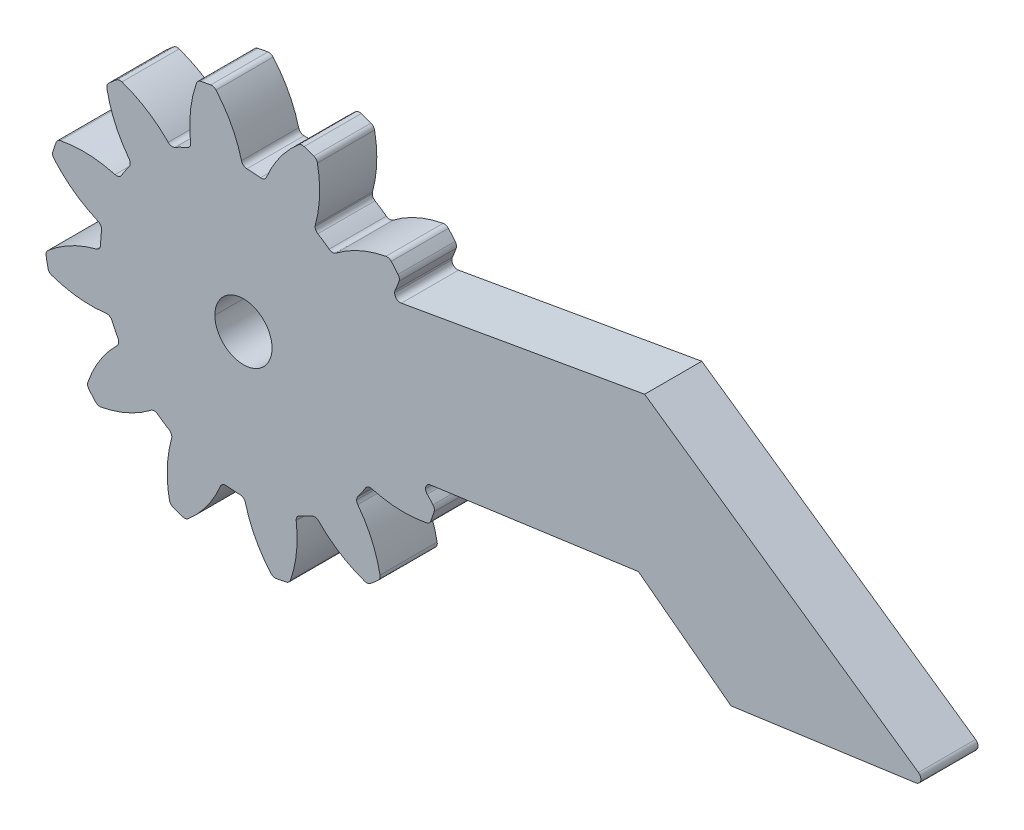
ISO-10303-21;
HEADER;
FILE_DESCRIPTION(('STEP AP214'),'2;1');
FILE_NAME('part.step','',(''),(''),'','','');
FILE_SCHEMA(('AUTOMOTIVE_DESIGN { 1 0 10303 214 1 1 1 1 }'));
ENDSEC;
DATA;
#1=APPLICATION_CONTEXT('core data for automotive mechanical design processes');
#2=APPLICATION_PROTOCOL_DEFINITION('international standard','automotive_design',2000,#1);
#3=PRODUCT_CONTEXT('',#1,'mechanical');
#4=PRODUCT('Part','Part','',(#3));
#5=PRODUCT_RELATED_PRODUCT_CATEGORY('part','',(#4));
#6=PRODUCT_DEFINITION_FORMATION('','',#4);
#7=PRODUCT_DEFINITION_CONTEXT('part definition',#1,'design');
#8=PRODUCT_DEFINITION('design','',#6,#7);
#9=PRODUCT_DEFINITION_SHAPE('','',#8);
#10=(LENGTH_UNIT() NAMED_UNIT(*) SI_UNIT(.MILLI.,.METRE.));
#11=(NAMED_UNIT(*) PLANE_ANGLE_UNIT() SI_UNIT($,.RADIAN.));
#12=(NAMED_UNIT(*) SI_UNIT($,.STERADIAN.) SOLID_ANGLE_UNIT());
#13=UNCERTAINTY_MEASURE_WITH_UNIT(LENGTH_MEASURE(1.E-05),#10,'distance_accuracy_value','');
#14=(GEOMETRIC_REPRESENTATION_CONTEXT(3) GLOBAL_UNCERTAINTY_ASSIGNED_CONTEXT((#13)) GLOBAL_UNIT_ASSIGNED_CONTEXT((#10,
#11,#12)) REPRESENTATION_CONTEXT('',''));
#15=CARTESIAN_POINT('',(0.,0.,0.));
#16=DIRECTION('',(0.,0.,1.));
#17=DIRECTION('',(1.,0.,0.));
#18=AXIS2_PLACEMENT_3D('',#15,#16,#17);
#19=CARTESIAN_POINT('',(103.409696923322,33.487464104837,3.));
#20=DIRECTION('',(0.,0.,-1.));
#21=DIRECTION('',(-1.,0.,0.));
#22=AXIS2_PLACEMENT_3D('',#19,#20,#21);
#23=CYLINDRICAL_SURFACE('',#22,6.25000000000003);
#24=DIRECTION('',(0.,0.,-1.));
#25=VECTOR('',#24,1.);
#26=CARTESIAN_POINT('',(97.3861382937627,35.1545698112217,3.));
#27=LINE('',#26,#25);
#28=CARTESIAN_POINT('',(97.3861382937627,35.1545698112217,3.));
#29=VERTEX_POINT('',#28);
#30=CARTESIAN_POINT('',(97.3861382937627,35.1545698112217,0.));
#31=VERTEX_POINT('',#30);
#32=EDGE_CURVE('E669',#29,#31,#27,.T.);
#33=ORIENTED_EDGE('',*,*,#32,.T.);
#34=CARTESIAN_POINT('',(103.409696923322,33.487464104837,0.));
#35=DIRECTION('',(0.,0.,-1.));
#36=DIRECTION('',(-1.,0.,0.));
#37=AXIS2_PLACEMENT_3D('',#34,#35,#36);
#38=CIRCLE('',#37,6.25000000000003);
#39=CARTESIAN_POINT('',(97.1596969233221,33.487464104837,0.));
#40=VERTEX_POINT('',#39);
#41=EDGE_CURVE('E653',#31,#40,#38,.F.);
#42=ORIENTED_EDGE('',*,*,#41,.T.);
#43=DIRECTION('',(0.,0.,-1.));
#44=VECTOR('',#43,1.);
#45=CARTESIAN_POINT('',(97.1596969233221,33.487464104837,3.));
#46=LINE('',#45,#44);
#47=CARTESIAN_POINT('',(97.1596969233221,33.487464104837,3.));
#48=VERTEX_POINT('',#47);
#49=EDGE_CURVE('E655',#48,#40,#46,.T.);
#50=ORIENTED_EDGE('',*,*,#49,.F.);
#51=CARTESIAN_POINT('',(103.409696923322,33.487464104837,3.));
#52=DIRECTION('',(0.,0.,-1.));
#53=DIRECTION('',(-1.,0.,0.));
#54=AXIS2_PLACEMENT_3D('',#51,#52,#53);
#55=CIRCLE('',#54,6.25000000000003);
#56=EDGE_CURVE('E17',#48,#29,#55,.T.);
#57=ORIENTED_EDGE('',*,*,#56,.T.);
#58=EDGE_LOOP('',(#33,#42,#50,#57));
#59=FACE_BOUND('',#58,.T.);
#60=ADVANCED_FACE('F14',(#59),#23,.T.);
#61=CARTESIAN_POINT('',(103.409696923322,33.487464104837,3.));
#62=DIRECTION('',(0.,0.,-1.));
#63=DIRECTION('',(-1.,0.,0.));
#64=AXIS2_PLACEMENT_3D('',#61,#62,#63);
#65=CYLINDRICAL_SURFACE('',#64,6.25000000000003);
#66=CARTESIAN_POINT('',(103.409696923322,33.487464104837,0.));
#67=DIRECTION('',(0.,0.,-1.));
#68=DIRECTION('',(-1.,0.,0.));
#69=AXIS2_PLACEMENT_3D('',#66,#67,#68);
#70=CIRCLE('',#69,6.25000000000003);
#71=CARTESIAN_POINT('',(97.2758593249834,32.2880741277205,0.));
#72=VERTEX_POINT('',#71);
#73=EDGE_CURVE('E659',#40,#72,#70,.F.);
#74=ORIENTED_EDGE('',*,*,#73,.T.);
#75=DIRECTION('',(0.,0.,-1.));
#76=VECTOR('',#75,1.);
#77=CARTESIAN_POINT('',(97.2758593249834,32.2880741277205,3.));
#78=LINE('',#77,#76);
#79=CARTESIAN_POINT('',(97.2758593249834,32.2880741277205,3.));
#80=VERTEX_POINT('',#79);
#81=EDGE_CURVE('E663',#80,#72,#78,.T.);
#82=ORIENTED_EDGE('',*,*,#81,.F.);
#83=CARTESIAN_POINT('',(103.409696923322,33.487464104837,3.));
#84=DIRECTION('',(0.,0.,-1.));
#85=DIRECTION('',(-1.,0.,0.));
#86=AXIS2_PLACEMENT_3D('',#83,#84,#85);
#87=CIRCLE('',#86,6.25000000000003);
#88=EDGE_CURVE('E646',#80,#48,#87,.T.);
#89=ORIENTED_EDGE('',*,*,#88,.T.);
#90=ORIENTED_EDGE('',*,*,#49,.T.);
#91=EDGE_LOOP('',(#74,#82,#89,#90));
#92=FACE_BOUND('',#91,.T.);
#93=ADVANCED_FACE('F661',(#92),#65,.T.);
#94=CARTESIAN_POINT('',(97.0970074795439,35.2345908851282,3.));
#95=DIRECTION('',(0.,0.,-1.));
#96=DIRECTION('',(-1.,0.,0.));
#97=AXIS2_PLACEMENT_3D('',#94,#95,#96);
#98=CYLINDRICAL_SURFACE('',#97,0.300000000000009);
#99=ORIENTED_EDGE('',*,*,#32,.F.);
#100=CARTESIAN_POINT('',(97.0970074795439,35.2345908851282,3.));
#101=DIRECTION('',(0.,0.,-1.));
#102=DIRECTION('',(-1.,0.,0.));
#103=AXIS2_PLACEMENT_3D('',#100,#101,#102);
#104=CIRCLE('',#103,0.300000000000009);
#105=CARTESIAN_POINT('',(97.253231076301,35.4907045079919,3.));
#106=VERTEX_POINT('',#105);
#107=EDGE_CURVE('E649',#106,#29,#104,.T.);
#108=ORIENTED_EDGE('',*,*,#107,.F.);
#109=DIRECTION('',(0.,0.,-1.));
#110=VECTOR('',#109,1.);
#111=CARTESIAN_POINT('',(97.2532310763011,35.4907045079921,3.));
#112=LINE('',#111,#110);
#113=CARTESIAN_POINT('',(97.253231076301,35.4907045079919,0.));
#114=VERTEX_POINT('',#113);
#115=EDGE_CURVE('E734',#114,#106,#112,.F.);
#116=ORIENTED_EDGE('',*,*,#115,.F.);
#117=CARTESIAN_POINT('',(97.0970074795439,35.2345908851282,0.));
#118=DIRECTION('',(0.,0.,-1.));
#119=DIRECTION('',(-1.,0.,0.));
#120=AXIS2_PLACEMENT_3D('',#117,#118,#119);
#121=CIRCLE('',#120,0.300000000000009);
#122=EDGE_CURVE('E670',#31,#114,#121,.F.);
#123=ORIENTED_EDGE('',*,*,#122,.F.);
#124=EDGE_LOOP('',(#99,#108,#116,#123));
#125=FACE_BOUND('',#124,.T.);
#126=ADVANCED_FACE('F1604',(#125),#98,.F.);
#127=CARTESIAN_POINT('',(97.5702835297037,32.3456448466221,3.));
#128=DIRECTION('',(0.,0.,-1.));
#129=DIRECTION('',(-1.,0.,0.));
#130=AXIS2_PLACEMENT_3D('',#127,#128,#129);
#131=CYLINDRICAL_SURFACE('',#130,0.299999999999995);
#132=CARTESIAN_POINT('',(97.5702835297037,32.3456448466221,3.));
#133=DIRECTION('',(0.,0.,-1.));
#134=DIRECTION('',(-1.,0.,0.));
#135=AXIS2_PLACEMENT_3D('',#132,#133,#134);
#136=CIRCLE('',#135,0.299999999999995);
#137=CARTESIAN_POINT('',(97.4647383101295,32.064824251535,3.));
#138=VERTEX_POINT('',#137);
#139=EDGE_CURVE('E675',#138,#80,#136,.T.);
#140=ORIENTED_EDGE('',*,*,#139,.T.);
#141=ORIENTED_EDGE('',*,*,#81,.T.);
#142=CARTESIAN_POINT('',(97.5702835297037,32.3456448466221,0.));
#143=DIRECTION('',(0.,0.,-1.));
#144=DIRECTION('',(-1.,0.,0.));
#145=AXIS2_PLACEMENT_3D('',#142,#143,#144);
#146=CIRCLE('',#145,0.299999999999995);
#147=CARTESIAN_POINT('',(97.4647383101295,32.064824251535,0.));
#148=VERTEX_POINT('',#147);
#149=EDGE_CURVE('E672',#72,#148,#146,.F.);
#150=ORIENTED_EDGE('',*,*,#149,.T.);
#151=DIRECTION('',(0.,0.,-1.));
#152=VECTOR('',#151,1.);
#153=CARTESIAN_POINT('',(97.4647383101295,32.064824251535,3.));
#154=LINE('',#153,#152);
#155=EDGE_CURVE('E749',#138,#148,#154,.T.);
#156=ORIENTED_EDGE('',*,*,#155,.F.);
#157=EDGE_LOOP('',(#140,#141,#150,#156));
#158=FACE_BOUND('',#157,.T.);
#159=ADVANCED_FACE('F1606',(#158),#131,.T.);
#160=CARTESIAN_POINT('',(110.879325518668,38.8029477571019,3.));
#161=DIRECTION('',(0.,0.,-1.));
#162=DIRECTION('',(-1.,0.,0.));
#163=AXIS2_PLACEMENT_3D('',#160,#161,#162);
#164=CYLINDRICAL_SURFACE('',#163,0.300000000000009);
#165=CARTESIAN_POINT('',(110.879325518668,38.8029477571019,3.));
#166=DIRECTION('',(0.,0.,-1.));
#167=DIRECTION('',(-1.,0.,0.));
#168=AXIS2_PLACEMENT_3D('',#165,#166,#167);
#169=CIRCLE('',#168,0.300000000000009);
#170=CARTESIAN_POINT('',(111.106766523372,38.9985764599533,3.));
#171=VERTEX_POINT('',#170);
#172=CARTESIAN_POINT('',(111.165222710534,38.7120478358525,3.));
#173=VERTEX_POINT('',#172);
#174=EDGE_CURVE('E680',#171,#173,#169,.T.);
#175=ORIENTED_EDGE('',*,*,#174,.T.);
#176=DIRECTION('',(0.,0.,-1.));
#177=VECTOR('',#176,1.);
#178=CARTESIAN_POINT('',(111.165222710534,38.7120478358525,3.));
#179=LINE('',#178,#177);
#180=CARTESIAN_POINT('',(111.165222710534,38.7120478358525,0.));
#181=VERTEX_POINT('',#180);
#182=EDGE_CURVE('E780',#181,#173,#179,.F.);
#183=ORIENTED_EDGE('',*,*,#182,.F.);
#184=CARTESIAN_POINT('',(110.879325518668,38.8029477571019,0.));
#185=DIRECTION('',(0.,0.,-1.));
#186=DIRECTION('',(-1.,0.,0.));
#187=AXIS2_PLACEMENT_3D('',#184,#185,#186);
#188=CIRCLE('',#187,0.300000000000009);
#189=CARTESIAN_POINT('',(111.106766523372,38.9985764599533,0.));
#190=VERTEX_POINT('',#189);
#191=EDGE_CURVE('E677',#181,#190,#188,.F.);
#192=ORIENTED_EDGE('',*,*,#191,.T.);
#193=DIRECTION('',(0.,0.,-1.));
#194=VECTOR('',#193,1.);
#195=CARTESIAN_POINT('',(111.106766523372,38.9985764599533,3.));
#196=LINE('',#195,#194);
#197=EDGE_CURVE('E688',#171,#190,#196,.T.);
#198=ORIENTED_EDGE('',*,*,#197,.F.);
#199=EDGE_LOOP('',(#175,#183,#192,#198));
#200=FACE_BOUND('',#199,.T.);
#201=ADVANCED_FACE('F1613',(#200),#164,.T.);
#202=CARTESIAN_POINT('',(106.368412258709,34.9229784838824,3.));
#203=DIRECTION('',(0.,0.,-1.));
#204=DIRECTION('',(-1.,0.,0.));
#205=AXIS2_PLACEMENT_3D('',#202,#203,#204);
#206=CYLINDRICAL_SURFACE('',#205,6.25000000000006);
#207=CARTESIAN_POINT('',(106.368412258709,34.9229784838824,3.));
#208=DIRECTION('',(0.,0.,-1.));
#209=DIRECTION('',(-1.,0.,0.));
#210=AXIS2_PLACEMENT_3D('',#207,#208,#209);
#211=CIRCLE('',#210,6.25000000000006);
#212=CARTESIAN_POINT('',(110.802658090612,39.3275174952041,3.));
#213=VERTEX_POINT('',#212);
#214=EDGE_CURVE('E685',#213,#171,#211,.T.);
#215=ORIENTED_EDGE('',*,*,#214,.T.);
#216=ORIENTED_EDGE('',*,*,#197,.T.);
#217=CARTESIAN_POINT('',(106.368412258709,34.9229784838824,0.));
#218=DIRECTION('',(0.,0.,-1.));
#219=DIRECTION('',(-1.,0.,0.));
#220=AXIS2_PLACEMENT_3D('',#217,#218,#219);
#221=CIRCLE('',#220,6.25000000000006);
#222=CARTESIAN_POINT('',(110.802658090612,39.3275174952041,0.));
#223=VERTEX_POINT('',#222);
#224=EDGE_CURVE('E682',#190,#223,#221,.F.);
#225=ORIENTED_EDGE('',*,*,#224,.T.);
#226=DIRECTION('',(0.,0.,-1.));
#227=VECTOR('',#226,1.);
#228=CARTESIAN_POINT('',(110.802658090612,39.3275174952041,3.));
#229=LINE('',#228,#227);
#230=EDGE_CURVE('E791',#223,#213,#229,.F.);
#231=ORIENTED_EDGE('',*,*,#230,.T.);
#232=EDGE_LOOP('',(#215,#216,#225,#231));
#233=FACE_BOUND('',#232,.T.);
#234=ADVANCED_FACE('F1970',(#233),#206,.T.);
#235=CARTESIAN_POINT('',(103.412545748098,50.2988627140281,3.));
#236=DIRECTION('',(0.,0.,-1.));
#237=DIRECTION('',(-1.,0.,0.));
#238=AXIS2_PLACEMENT_3D('',#235,#236,#237);
#239=CYLINDRICAL_SURFACE('',#238,6.25000000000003);
#240=CARTESIAN_POINT('',(103.412545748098,50.2988627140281,3.));
#241=DIRECTION('',(0.,0.,-1.));
#242=DIRECTION('',(-1.,0.,0.));
#243=AXIS2_PLACEMENT_3D('',#240,#241,#242);
#244=CIRCLE('',#243,6.25000000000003);
#245=CARTESIAN_POINT('',(109.324299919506,48.2706461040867,3.));
#246=VERTEX_POINT('',#245);
#247=CARTESIAN_POINT('',(109.120229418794,47.7523264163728,3.));
#248=VERTEX_POINT('',#247);
#249=EDGE_CURVE('E692',#246,#248,#244,.T.);
#250=ORIENTED_EDGE('',*,*,#249,.T.);
#251=DIRECTION('',(0.,0.,-1.));
#252=VECTOR('',#251,1.);
#253=CARTESIAN_POINT('',(109.120229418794,47.7523264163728,3.));
#254=LINE('',#253,#252);
#255=CARTESIAN_POINT('',(109.120229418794,47.7523264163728,0.));
#256=VERTEX_POINT('',#255);
#257=EDGE_CURVE('E794',#248,#256,#254,.T.);
#258=ORIENTED_EDGE('',*,*,#257,.T.);
#259=CARTESIAN_POINT('',(103.412545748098,50.2988627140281,0.));
#260=DIRECTION('',(0.,0.,-1.));
#261=DIRECTION('',(-1.,0.,0.));
#262=AXIS2_PLACEMENT_3D('',#259,#260,#261);
#263=CIRCLE('',#262,6.25000000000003);
#264=CARTESIAN_POINT('',(109.324299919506,48.2706461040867,0.));
#265=VERTEX_POINT('',#264);
#266=EDGE_CURVE('E689',#256,#265,#263,.F.);
#267=ORIENTED_EDGE('',*,*,#266,.T.);
#268=DIRECTION('',(0.,0.,-1.));
#269=VECTOR('',#268,1.);
#270=CARTESIAN_POINT('',(109.324299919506,48.2706461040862,3.));
#271=LINE('',#270,#269);
#272=EDGE_CURVE('E700',#246,#265,#271,.T.);
#273=ORIENTED_EDGE('',*,*,#272,.F.);
#274=EDGE_LOOP('',(#250,#258,#267,#273));
#275=FACE_BOUND('',#274,.T.);
#276=ADVANCED_FACE('F1966',(#275),#239,.T.);
#277=CARTESIAN_POINT('',(109.040535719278,48.3680005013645,3.));
#278=DIRECTION('',(0.,0.,-1.));
#279=DIRECTION('',(-1.,0.,0.));
#280=AXIS2_PLACEMENT_3D('',#277,#278,#279);
#281=CYLINDRICAL_SURFACE('',#280,0.300000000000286);
#282=CARTESIAN_POINT('',(109.040535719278,48.3680005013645,3.));
#283=DIRECTION('',(0.,0.,-1.));
#284=DIRECTION('',(-1.,0.,0.));
#285=AXIS2_PLACEMENT_3D('',#282,#283,#284);
#286=CIRCLE('',#285,0.300000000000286);
#287=CARTESIAN_POINT('',(109.272350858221,48.5584256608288,3.));
#288=VERTEX_POINT('',#287);
#289=EDGE_CURVE('E697',#288,#246,#286,.T.);
#290=ORIENTED_EDGE('',*,*,#289,.T.);
#291=ORIENTED_EDGE('',*,*,#272,.T.);
#292=CARTESIAN_POINT('',(109.040535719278,48.3680005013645,0.));
#293=DIRECTION('',(0.,0.,-1.));
#294=DIRECTION('',(-1.,0.,0.));
#295=AXIS2_PLACEMENT_3D('',#292,#293,#294);
#296=CIRCLE('',#295,0.300000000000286);
#297=CARTESIAN_POINT('',(109.272350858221,48.5584256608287,0.));
#298=VERTEX_POINT('',#297);
#299=EDGE_CURVE('E694',#265,#298,#296,.F.);
#300=ORIENTED_EDGE('',*,*,#299,.T.);
#301=DIRECTION('',(0.,0.,-1.));
#302=VECTOR('',#301,1.);
#303=CARTESIAN_POINT('',(109.272350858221,48.5584256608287,3.));
#304=LINE('',#303,#302);
#305=EDGE_CURVE('E811',#288,#298,#304,.T.);
#306=ORIENTED_EDGE('',*,*,#305,.F.);
#307=EDGE_LOOP('',(#290,#291,#300,#306));
#308=FACE_BOUND('',#307,.T.);
#309=ADVANCED_FACE('F1963',(#308),#281,.T.);
#310=CARTESIAN_POINT('',(91.4383164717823,44.9841424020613,3.));
#311=DIRECTION('',(0.,0.,-1.));
#312=DIRECTION('',(-1.,0.,0.));
#313=AXIS2_PLACEMENT_3D('',#310,#311,#312);
#314=CYLINDRICAL_SURFACE('',#313,0.300000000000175);
#315=DIRECTION('',(0.,0.,-1.));
#316=VECTOR('',#315,1.);
#317=CARTESIAN_POINT('',(91.1524192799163,45.0750423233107,3.));
#318=LINE('',#317,#316);
#319=CARTESIAN_POINT('',(91.1524192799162,45.0750423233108,0.));
#320=VERTEX_POINT('',#319);
#321=CARTESIAN_POINT('',(91.1524192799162,45.0750423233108,3.));
#322=VERTEX_POINT('',#321);
#323=EDGE_CURVE('E850',#320,#322,#318,.F.);
#324=ORIENTED_EDGE('',*,*,#323,.F.);
#325=CARTESIAN_POINT('',(91.4383164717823,44.9841424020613,0.));
#326=DIRECTION('',(0.,0.,-1.));
#327=DIRECTION('',(-1.,0.,0.));
#328=AXIS2_PLACEMENT_3D('',#325,#326,#327);
#329=CIRCLE('',#328,0.300000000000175);
#330=CARTESIAN_POINT('',(91.1383164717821,44.9841424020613,0.));
#331=VERTEX_POINT('',#330);
#332=EDGE_CURVE('E703',#320,#331,#329,.F.);
#333=ORIENTED_EDGE('',*,*,#332,.T.);
#334=DIRECTION('',(0.,0.,-1.));
#335=VECTOR('',#334,1.);
#336=CARTESIAN_POINT('',(91.1383164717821,44.9841424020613,3.));
#337=LINE('',#336,#335);
#338=CARTESIAN_POINT('',(91.1383164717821,44.9841424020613,3.));
#339=VERTEX_POINT('',#338);
#340=EDGE_CURVE('E862',#339,#331,#337,.T.);
#341=ORIENTED_EDGE('',*,*,#340,.F.);
#342=CARTESIAN_POINT('',(91.4383164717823,44.9841424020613,3.));
#343=DIRECTION('',(0.,0.,-1.));
#344=DIRECTION('',(-1.,0.,0.));
#345=AXIS2_PLACEMENT_3D('',#342,#343,#344);
#346=CIRCLE('',#345,0.300000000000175);
#347=EDGE_CURVE('E701',#339,#322,#346,.T.);
#348=ORIENTED_EDGE('',*,*,#347,.T.);
#349=EDGE_LOOP('',(#324,#333,#341,#348));
#350=FACE_BOUND('',#349,.T.);
#351=ADVANCED_FACE('F1512',(#350),#314,.T.);
#352=CARTESIAN_POINT('',(91.0958281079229,40.2273595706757,3.));
#353=DIRECTION('',(0.,0.,-1.));
#354=DIRECTION('',(-1.,0.,0.));
#355=AXIS2_PLACEMENT_3D('',#352,#353,#354);
#356=CYLINDRICAL_SURFACE('',#355,0.300000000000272);
#357=CARTESIAN_POINT('',(91.0958281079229,40.2273595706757,0.));
#358=DIRECTION('',(0.,0.,-1.));
#359=DIRECTION('',(-1.,0.,0.));
#360=AXIS2_PLACEMENT_3D('',#357,#358,#359);
#361=CIRCLE('',#360,0.300000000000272);
#362=CARTESIAN_POINT('',(90.7958281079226,40.2273595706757,0.));
#363=VERTEX_POINT('',#362);
#364=CARTESIAN_POINT('',(90.7998577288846,40.1783541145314,0.));
#365=VERTEX_POINT('',#364);
#366=EDGE_CURVE('E707',#363,#365,#361,.F.);
#367=ORIENTED_EDGE('',*,*,#366,.T.);
#368=DIRECTION('',(0.,0.,-1.));
#369=VECTOR('',#368,1.);
#370=CARTESIAN_POINT('',(90.7998577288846,40.1783541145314,3.));
#371=LINE('',#370,#369);
#372=CARTESIAN_POINT('',(90.7998577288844,40.1783541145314,3.));
#373=VERTEX_POINT('',#372);
#374=EDGE_CURVE('E720',#373,#365,#371,.T.);
#375=ORIENTED_EDGE('',*,*,#374,.F.);
#376=CARTESIAN_POINT('',(91.0958281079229,40.2273595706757,3.));
#377=DIRECTION('',(0.,0.,-1.));
#378=DIRECTION('',(-1.,0.,0.));
#379=AXIS2_PLACEMENT_3D('',#376,#377,#378);
#380=CIRCLE('',#379,0.300000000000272);
#381=CARTESIAN_POINT('',(90.7958281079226,40.2273595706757,3.));
#382=VERTEX_POINT('',#381);
#383=EDGE_CURVE('E705',#373,#382,#380,.T.);
#384=ORIENTED_EDGE('',*,*,#383,.T.);
#385=DIRECTION('',(0.,0.,-1.));
#386=VECTOR('',#385,1.);
#387=CARTESIAN_POINT('',(90.7958281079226,40.2273595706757,3.));
#388=LINE('',#387,#386);
#389=EDGE_CURVE('E866',#363,#382,#388,.F.);
#390=ORIENTED_EDGE('',*,*,#389,.F.);
#391=EDGE_LOOP('',(#367,#375,#384,#390));
#392=FACE_BOUND('',#391,.T.);
#393=ADVANCED_FACE('F1544',(#392),#356,.T.);
#394=CARTESIAN_POINT('',(101.158820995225,41.8935450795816,3.));
#395=DIRECTION('',(0.,0.,-1.));
#396=DIRECTION('',(-1.,0.,0.));
#397=AXIS2_PLACEMENT_3D('',#394,#395,#396);
#398=CYLINDRICAL_SURFACE('',#397,7.49999999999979);
#399=CARTESIAN_POINT('',(101.158820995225,41.8935450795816,3.));
#400=DIRECTION('',(0.,0.,-1.));
#401=DIRECTION('',(-1.,0.,0.));
#402=AXIS2_PLACEMENT_3D('',#399,#400,#401);
#403=CIRCLE('',#402,7.49999999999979);
#404=CARTESIAN_POINT('',(93.6610034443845,42.0744648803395,3.));
#405=VERTEX_POINT('',#404);
#406=CARTESIAN_POINT('',(93.7124218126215,42.7886088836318,3.));
#407=VERTEX_POINT('',#406);
#408=EDGE_CURVE('E712',#405,#407,#403,.T.);
#409=ORIENTED_EDGE('',*,*,#408,.T.);
#410=DIRECTION('',(0.,0.,-1.));
#411=VECTOR('',#410,1.);
#412=CARTESIAN_POINT('',(93.7124218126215,42.7886088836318,3.));
#413=LINE('',#412,#411);
#414=CARTESIAN_POINT('',(93.7124218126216,42.7886088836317,0.));
#415=VERTEX_POINT('',#414);
#416=EDGE_CURVE('E858',#407,#415,#413,.T.);
#417=ORIENTED_EDGE('',*,*,#416,.T.);
#418=CARTESIAN_POINT('',(101.158820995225,41.8935450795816,0.));
#419=DIRECTION('',(0.,0.,-1.));
#420=DIRECTION('',(-1.,0.,0.));
#421=AXIS2_PLACEMENT_3D('',#418,#419,#420);
#422=CIRCLE('',#421,7.49999999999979);
#423=CARTESIAN_POINT('',(93.6610034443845,42.0744648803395,0.));
#424=VERTEX_POINT('',#423);
#425=EDGE_CURVE('E710',#415,#424,#422,.F.);
#426=ORIENTED_EDGE('',*,*,#425,.T.);
#427=DIRECTION('',(0.,0.,-1.));
#428=VECTOR('',#427,1.);
#429=CARTESIAN_POINT('',(93.6610034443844,42.0744648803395,3.));
#430=LINE('',#429,#428);
#431=EDGE_CURVE('E865',#424,#405,#430,.F.);
#432=ORIENTED_EDGE('',*,*,#431,.T.);
#433=EDGE_LOOP('',(#409,#417,#426,#432));
#434=FACE_BOUND('',#433,.T.);
#435=ADVANCED_FACE('F1527',(#434),#398,.T.);
#436=CARTESIAN_POINT('',(101.158820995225,41.8935450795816,3.));
#437=DIRECTION('',(0.,0.,-1.));
#438=DIRECTION('',(-1.,0.,0.));
#439=AXIS2_PLACEMENT_3D('',#436,#437,#438);
#440=CYLINDRICAL_SURFACE('',#439,10.4999999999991);
#441=CARTESIAN_POINT('',(101.158820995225,41.8935450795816,3.));
#442=DIRECTION('',(0.,0.,-1.));
#443=DIRECTION('',(-1.,0.,0.));
#444=AXIS2_PLACEMENT_3D('',#441,#442,#443);
#445=CIRCLE('',#444,10.4999999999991);
#446=CARTESIAN_POINT('',(90.9022742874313,39.6456016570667,3.));
#447=VERTEX_POINT('',#446);
#448=EDGE_CURVE('E717',#447,#373,#445,.T.);
#449=ORIENTED_EDGE('',*,*,#448,.T.);
#450=ORIENTED_EDGE('',*,*,#374,.T.);
#451=CARTESIAN_POINT('',(101.158820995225,41.8935450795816,0.));
#452=DIRECTION('',(0.,0.,-1.));
#453=DIRECTION('',(-1.,0.,0.));
#454=AXIS2_PLACEMENT_3D('',#451,#452,#453);
#455=CIRCLE('',#454,10.4999999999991);
#456=CARTESIAN_POINT('',(90.9022742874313,39.6456016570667,0.));
#457=VERTEX_POINT('',#456);
#458=EDGE_CURVE('E715',#365,#457,#455,.F.);
#459=ORIENTED_EDGE('',*,*,#458,.T.);
#460=DIRECTION('',(0.,0.,-1.));
#461=VECTOR('',#460,1.);
#462=CARTESIAN_POINT('',(90.9022742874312,39.6456016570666,3.));
#463=LINE('',#462,#461);
#464=EDGE_CURVE('E875',#447,#457,#463,.T.);
#465=ORIENTED_EDGE('',*,*,#464,.F.);
#466=EDGE_LOOP('',(#449,#450,#459,#465));
#467=FACE_BOUND('',#466,.T.);
#468=ADVANCED_FACE('F1549',(#467),#440,.T.);
#469=CARTESIAN_POINT('',(93.2771062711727,35.4190896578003,3.));
#470=DIRECTION('',(0.,0.,-1.));
#471=DIRECTION('',(-1.,0.,0.));
#472=AXIS2_PLACEMENT_3D('',#469,#470,#471);
#473=CYLINDRICAL_SURFACE('',#472,0.30000000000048);
#474=CARTESIAN_POINT('',(93.2771062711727,35.4190896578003,0.));
#475=DIRECTION('',(0.,0.,-1.));
#476=DIRECTION('',(-1.,0.,0.));
#477=AXIS2_PLACEMENT_3D('',#474,#475,#476);
#478=CIRCLE('',#477,0.30000000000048);
#479=CARTESIAN_POINT('',(92.9771062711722,35.4190896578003,0.));
#480=VERTEX_POINT('',#479);
#481=CARTESIAN_POINT('',(93.0452911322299,35.2286644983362,0.));
#482=VERTEX_POINT('',#481);
#483=EDGE_CURVE('E723',#480,#482,#478,.F.);
#484=ORIENTED_EDGE('',*,*,#483,.T.);
#485=DIRECTION('',(0.,0.,-1.));
#486=VECTOR('',#485,1.);
#487=CARTESIAN_POINT('',(93.0452911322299,35.2286644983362,3.));
#488=LINE('',#487,#486);
#489=CARTESIAN_POINT('',(93.0452911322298,35.228664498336,3.));
#490=VERTEX_POINT('',#489);
#491=EDGE_CURVE('E743',#490,#482,#488,.T.);
#492=ORIENTED_EDGE('',*,*,#491,.F.);
#493=CARTESIAN_POINT('',(93.2771062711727,35.4190896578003,3.));
#494=DIRECTION('',(0.,0.,-1.));
#495=DIRECTION('',(-1.,0.,0.));
#496=AXIS2_PLACEMENT_3D('',#493,#494,#495);
#497=CIRCLE('',#496,0.30000000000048);
#498=CARTESIAN_POINT('',(92.9771062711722,35.4190896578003,3.));
#499=VERTEX_POINT('',#498);
#500=EDGE_CURVE('E721',#490,#499,#497,.T.);
#501=ORIENTED_EDGE('',*,*,#500,.T.);
#502=DIRECTION('',(0.,0.,-1.));
#503=VECTOR('',#502,1.);
#504=CARTESIAN_POINT('',(92.9771062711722,35.4190896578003,3.));
#505=LINE('',#504,#503);
#506=EDGE_CURVE('E879',#480,#499,#505,.F.);
#507=ORIENTED_EDGE('',*,*,#506,.F.);
#508=EDGE_LOOP('',(#484,#492,#501,#507));
#509=FACE_BOUND('',#508,.T.);
#510=ADVANCED_FACE('F1582',(#509),#473,.T.);
#511=CARTESIAN_POINT('',(101.158820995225,41.8935450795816,3.));
#512=DIRECTION('',(0.,0.,-1.));
#513=DIRECTION('',(-1.,0.,0.));
#514=AXIS2_PLACEMENT_3D('',#511,#512,#513);
#515=CYLINDRICAL_SURFACE('',#514,7.49999999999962);
#516=CARTESIAN_POINT('',(101.158820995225,41.8935450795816,3.));
#517=DIRECTION('',(0.,0.,-1.));
#518=DIRECTION('',(-1.,0.,0.));
#519=AXIS2_PLACEMENT_3D('',#516,#517,#518);
#520=CIRCLE('',#519,7.49999999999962);
#521=CARTESIAN_POINT('',(94.5750606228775,38.3013174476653,3.));
#522=VERTEX_POINT('',#521);
#523=CARTESIAN_POINT('',(94.2625182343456,38.9454934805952,3.));
#524=VERTEX_POINT('',#523);
#525=EDGE_CURVE('E728',#522,#524,#520,.T.);
#526=ORIENTED_EDGE('',*,*,#525,.T.);
#527=DIRECTION('',(0.,0.,-1.));
#528=VECTOR('',#527,1.);
#529=CARTESIAN_POINT('',(94.2625182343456,38.9454934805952,3.));
#530=LINE('',#529,#528);
#531=CARTESIAN_POINT('',(94.2625182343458,38.9454934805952,0.));
#532=VERTEX_POINT('',#531);
#533=EDGE_CURVE('E871',#524,#532,#530,.T.);
#534=ORIENTED_EDGE('',*,*,#533,.T.);
#535=CARTESIAN_POINT('',(101.158820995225,41.8935450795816,0.));
#536=DIRECTION('',(0.,0.,-1.));
#537=DIRECTION('',(-1.,0.,0.));
#538=AXIS2_PLACEMENT_3D('',#535,#536,#537);
#539=CIRCLE('',#538,7.49999999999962);
#540=CARTESIAN_POINT('',(94.5750606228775,38.3013174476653,0.));
#541=VERTEX_POINT('',#540);
#542=EDGE_CURVE('E726',#532,#541,#539,.F.);
#543=ORIENTED_EDGE('',*,*,#542,.T.);
#544=DIRECTION('',(0.,0.,-1.));
#545=VECTOR('',#544,1.);
#546=CARTESIAN_POINT('',(94.5750606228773,38.3013174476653,3.));
#547=LINE('',#546,#545);
#548=EDGE_CURVE('E878',#541,#522,#547,.F.);
#549=ORIENTED_EDGE('',*,*,#548,.T.);
#550=EDGE_LOOP('',(#526,#534,#543,#549));
#551=FACE_BOUND('',#550,.T.);
#552=ADVANCED_FACE('F1561',(#551),#515,.T.);
#553=CARTESIAN_POINT('',(101.158820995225,41.8935450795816,3.));
#554=DIRECTION('',(0.,0.,-1.));
#555=DIRECTION('',(-1.,0.,0.));
#556=AXIS2_PLACEMENT_3D('',#553,#554,#555);
#557=CYLINDRICAL_SURFACE('',#556,7.49999999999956);
#558=CARTESIAN_POINT('',(101.158820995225,41.8935450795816,3.));
#559=DIRECTION('',(0.,0.,-1.));
#560=DIRECTION('',(-1.,0.,0.));
#561=AXIS2_PLACEMENT_3D('',#558,#559,#560);
#562=CIRCLE('',#561,7.49999999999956);
#563=CARTESIAN_POINT('',(96.6604734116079,35.8923061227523,3.));
#564=VERTEX_POINT('',#563);
#565=EDGE_CURVE('E735',#106,#564,#562,.T.);
#566=ORIENTED_EDGE('',*,*,#565,.T.);
#567=DIRECTION('',(0.,0.,-1.));
#568=VECTOR('',#567,1.);
#569=CARTESIAN_POINT('',(96.6604734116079,35.8923061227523,3.));
#570=LINE('',#569,#568);
#571=CARTESIAN_POINT('',(96.6604734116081,35.8923061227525,0.));
#572=VERTEX_POINT('',#571);
#573=EDGE_CURVE('E884',#564,#572,#570,.T.);
#574=ORIENTED_EDGE('',*,*,#573,.T.);
#575=CARTESIAN_POINT('',(101.158820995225,41.8935450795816,0.));
#576=DIRECTION('',(0.,0.,-1.));
#577=DIRECTION('',(-1.,0.,0.));
#578=AXIS2_PLACEMENT_3D('',#575,#576,#577);
#579=CIRCLE('',#578,7.49999999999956);
#580=EDGE_CURVE('E731',#572,#114,#579,.F.);
#581=ORIENTED_EDGE('',*,*,#580,.T.);
#582=ORIENTED_EDGE('',*,*,#115,.T.);
#583=EDGE_LOOP('',(#566,#574,#581,#582));
#584=FACE_BOUND('',#583,.T.);
#585=ADVANCED_FACE('F1599',(#584),#557,.T.);
#586=CARTESIAN_POINT('',(101.158820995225,41.8935450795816,3.));
#587=DIRECTION('',(0.,0.,-1.));
#588=DIRECTION('',(-1.,0.,0.));
#589=AXIS2_PLACEMENT_3D('',#586,#587,#588);
#590=CYLINDRICAL_SURFACE('',#589,10.4999999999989);
#591=CARTESIAN_POINT('',(101.158820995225,41.8935450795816,3.));
#592=DIRECTION('',(0.,0.,-1.));
#593=DIRECTION('',(-1.,0.,0.));
#594=AXIS2_PLACEMENT_3D('',#591,#592,#593);
#595=CIRCLE('',#594,10.4999999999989);
#596=CARTESIAN_POINT('',(93.400362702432,34.8184956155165,3.));
#597=VERTEX_POINT('',#596);
#598=EDGE_CURVE('E740',#597,#490,#595,.T.);
#599=ORIENTED_EDGE('',*,*,#598,.T.);
#600=ORIENTED_EDGE('',*,*,#491,.T.);
#601=CARTESIAN_POINT('',(101.158820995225,41.8935450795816,0.));
#602=DIRECTION('',(0.,0.,-1.));
#603=DIRECTION('',(-1.,0.,0.));
#604=AXIS2_PLACEMENT_3D('',#601,#602,#603);
#605=CIRCLE('',#604,10.4999999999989);
#606=CARTESIAN_POINT('',(93.400362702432,34.8184956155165,0.));
#607=VERTEX_POINT('',#606);
#608=EDGE_CURVE('E738',#482,#607,#605,.F.);
#609=ORIENTED_EDGE('',*,*,#608,.T.);
#610=DIRECTION('',(0.,0.,-1.));
#611=VECTOR('',#610,1.);
#612=CARTESIAN_POINT('',(93.400362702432,34.8184956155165,3.));
#613=LINE('',#612,#611);
#614=EDGE_CURVE('E888',#597,#607,#613,.T.);
#615=ORIENTED_EDGE('',*,*,#614,.F.);
#616=EDGE_LOOP('',(#599,#600,#609,#615));
#617=FACE_BOUND('',#616,.T.);
#618=ADVANCED_FACE('F1587',(#617),#590,.T.);
#619=CARTESIAN_POINT('',(101.158820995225,41.8935450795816,3.));
#620=DIRECTION('',(0.,0.,-1.));
#621=DIRECTION('',(-1.,0.,0.));
#622=AXIS2_PLACEMENT_3D('',#619,#620,#621);
#623=CYLINDRICAL_SURFACE('',#622,10.5);
#624=CARTESIAN_POINT('',(101.158820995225,41.8935450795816,3.));
#625=DIRECTION('',(0.,0.,-1.));
#626=DIRECTION('',(-1.,0.,0.));
#627=AXIS2_PLACEMENT_3D('',#624,#625,#626);
#628=CIRCLE('',#627,10.5);
#629=CARTESIAN_POINT('',(97.977323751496,31.8871433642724,3.));
#630=VERTEX_POINT('',#629);
#631=EDGE_CURVE('E746',#630,#138,#628,.T.);
#632=ORIENTED_EDGE('',*,*,#631,.T.);
#633=ORIENTED_EDGE('',*,*,#155,.T.);
#634=CARTESIAN_POINT('',(101.158820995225,41.8935450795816,0.));
#635=DIRECTION('',(0.,0.,-1.));
#636=DIRECTION('',(-1.,0.,0.));
#637=AXIS2_PLACEMENT_3D('',#634,#635,#636);
#638=CIRCLE('',#637,10.5);
#639=CARTESIAN_POINT('',(97.977323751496,31.8871433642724,0.));
#640=VERTEX_POINT('',#639);
#641=EDGE_CURVE('E744',#148,#640,#638,.F.);
#642=ORIENTED_EDGE('',*,*,#641,.T.);
#643=DIRECTION('',(0.,0.,-1.));
#644=VECTOR('',#643,1.);
#645=CARTESIAN_POINT('',(97.9773237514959,31.8871433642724,3.));
#646=LINE('',#645,#644);
#647=EDGE_CURVE('E895',#630,#640,#646,.T.);
#648=ORIENTED_EDGE('',*,*,#647,.F.);
#649=EDGE_LOOP('',(#632,#633,#642,#648));
#650=FACE_BOUND('',#649,.T.);
#651=ADVANCED_FACE('F1942',(#650),#623,.T.);
#652=CARTESIAN_POINT('',(101.158820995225,41.8935450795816,3.));
#653=DIRECTION('',(0.,0.,-1.));
#654=DIRECTION('',(-1.,0.,0.));
#655=AXIS2_PLACEMENT_3D('',#652,#653,#654);
#656=CYLINDRICAL_SURFACE('',#655,7.49999999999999);
#657=CARTESIAN_POINT('',(101.158820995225,41.8935450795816,3.));
#658=DIRECTION('',(0.,0.,-1.));
#659=DIRECTION('',(-1.,0.,0.));
#660=AXIS2_PLACEMENT_3D('',#657,#658,#659);
#661=CIRCLE('',#660,7.49999999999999);
#662=CARTESIAN_POINT('',(100.977901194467,34.395727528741,3.));
#663=VERTEX_POINT('',#662);
#664=CARTESIAN_POINT('',(100.263757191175,34.447145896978,3.));
#665=VERTEX_POINT('',#664);
#666=EDGE_CURVE('E752',#663,#665,#661,.T.);
#667=ORIENTED_EDGE('',*,*,#666,.T.);
#668=DIRECTION('',(0.,0.,-1.));
#669=VECTOR('',#668,1.);
#670=CARTESIAN_POINT('',(100.263757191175,34.447145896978,3.));
#671=LINE('',#670,#669);
#672=CARTESIAN_POINT('',(100.263757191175,34.447145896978,0.));
#673=VERTEX_POINT('',#672);
#674=EDGE_CURVE('E891',#665,#673,#671,.T.);
#675=ORIENTED_EDGE('',*,*,#674,.T.);
#676=CARTESIAN_POINT('',(101.158820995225,41.8935450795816,0.));
#677=DIRECTION('',(0.,0.,-1.));
#678=DIRECTION('',(-1.,0.,0.));
#679=AXIS2_PLACEMENT_3D('',#676,#677,#678);
#680=CIRCLE('',#679,7.49999999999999);
#681=CARTESIAN_POINT('',(100.977901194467,34.395727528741,0.));
#682=VERTEX_POINT('',#681);
#683=EDGE_CURVE('E750',#673,#682,#680,.F.);
#684=ORIENTED_EDGE('',*,*,#683,.T.);
#685=DIRECTION('',(0.,0.,-1.));
#686=VECTOR('',#685,1.);
#687=CARTESIAN_POINT('',(100.977901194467,34.395727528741,3.));
#688=LINE('',#687,#686);
#689=EDGE_CURVE('E898',#682,#663,#688,.F.);
#690=ORIENTED_EDGE('',*,*,#689,.T.);
#691=EDGE_LOOP('',(#667,#675,#684,#690));
#692=FACE_BOUND('',#691,.T.);
#693=ADVANCED_FACE('F1938',(#692),#656,.T.);
#694=CARTESIAN_POINT('',(104.224794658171,34.721390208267,3.));
#695=DIRECTION('',(0.,0.,-1.));
#696=DIRECTION('',(-1.,0.,0.));
#697=AXIS2_PLACEMENT_3D('',#694,#695,#696);
#698=CYLINDRICAL_SURFACE('',#697,0.299999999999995);
#699=DIRECTION('',(0.,0.,-1.));
#700=VECTOR('',#699,1.);
#701=CARTESIAN_POINT('',(103.924794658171,34.721390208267,3.));
#702=LINE('',#701,#700);
#703=CARTESIAN_POINT('',(103.924794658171,34.721390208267,3.));
#704=VERTEX_POINT('',#703);
#705=CARTESIAN_POINT('',(103.924794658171,34.721390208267,0.));
#706=VERTEX_POINT('',#705);
#707=EDGE_CURVE('E904',#704,#706,#702,.T.);
#708=ORIENTED_EDGE('',*,*,#707,.T.);
#709=CARTESIAN_POINT('',(104.224794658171,34.721390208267,0.));
#710=DIRECTION('',(0.,0.,-1.));
#711=DIRECTION('',(-1.,0.,0.));
#712=AXIS2_PLACEMENT_3D('',#709,#710,#711);
#713=CIRCLE('',#712,0.299999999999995);
#714=CARTESIAN_POINT('',(104.106872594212,34.9972423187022,0.));
#715=VERTEX_POINT('',#714);
#716=EDGE_CURVE('E755',#715,#706,#713,.F.);
#717=ORIENTED_EDGE('',*,*,#716,.F.);
#718=DIRECTION('',(0.,0.,-1.));
#719=VECTOR('',#718,1.);
#720=CARTESIAN_POINT('',(104.106872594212,34.9972423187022,3.));
#721=LINE('',#720,#719);
#722=CARTESIAN_POINT('',(104.106872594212,34.9972423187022,3.));
#723=VERTEX_POINT('',#722);
#724=EDGE_CURVE('E768',#723,#715,#721,.T.);
#725=ORIENTED_EDGE('',*,*,#724,.F.);
#726=CARTESIAN_POINT('',(104.224794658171,34.721390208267,3.));
#727=DIRECTION('',(0.,0.,-1.));
#728=DIRECTION('',(-1.,0.,0.));
#729=AXIS2_PLACEMENT_3D('',#726,#727,#728);
#730=CIRCLE('',#729,0.299999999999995);
#731=EDGE_CURVE('E757',#704,#723,#730,.T.);
#732=ORIENTED_EDGE('',*,*,#731,.F.);
#733=EDGE_LOOP('',(#708,#717,#725,#732));
#734=FACE_BOUND('',#733,.T.);
#735=ADVANCED_FACE('F1934',(#734),#698,.F.);
#736=CARTESIAN_POINT('',(101.158820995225,41.8935450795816,3.));
#737=DIRECTION('',(0.,0.,-1.));
#738=DIRECTION('',(-1.,0.,0.));
#739=AXIS2_PLACEMENT_3D('',#736,#737,#738);
#740=CYLINDRICAL_SURFACE('',#739,10.5);
#741=CARTESIAN_POINT('',(101.158820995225,41.8935450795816,3.));
#742=DIRECTION('',(0.,0.,-1.));
#743=DIRECTION('',(-1.,0.,0.));
#744=AXIS2_PLACEMENT_3D('',#741,#742,#743);
#745=CIRCLE('',#744,10.5);
#746=CARTESIAN_POINT('',(103.40676441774,31.6369983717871,3.));
#747=VERTEX_POINT('',#746);
#748=CARTESIAN_POINT('',(102.874011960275,31.5345818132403,3.));
#749=VERTEX_POINT('',#748);
#750=EDGE_CURVE('E761',#747,#749,#745,.T.);
#751=ORIENTED_EDGE('',*,*,#750,.T.);
#752=DIRECTION('',(0.,0.,-1.));
#753=VECTOR('',#752,1.);
#754=CARTESIAN_POINT('',(102.874011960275,31.5345818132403,3.));
#755=LINE('',#754,#753);
#756=CARTESIAN_POINT('',(102.874011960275,31.5345818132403,0.));
#757=VERTEX_POINT('',#756);
#758=EDGE_CURVE('E899',#757,#749,#755,.F.);
#759=ORIENTED_EDGE('',*,*,#758,.F.);
#760=CARTESIAN_POINT('',(101.158820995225,41.8935450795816,0.));
#761=DIRECTION('',(0.,0.,-1.));
#762=DIRECTION('',(-1.,0.,0.));
#763=AXIS2_PLACEMENT_3D('',#760,#761,#762);
#764=CIRCLE('',#763,10.5);
#765=CARTESIAN_POINT('',(103.40676441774,31.6369983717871,0.));
#766=VERTEX_POINT('',#765);
#767=EDGE_CURVE('E759',#757,#766,#764,.F.);
#768=ORIENTED_EDGE('',*,*,#767,.T.);
#769=DIRECTION('',(0.,0.,-1.));
#770=VECTOR('',#769,1.);
#771=CARTESIAN_POINT('',(103.40676441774,31.6369983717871,3.));
#772=LINE('',#771,#770);
#773=EDGE_CURVE('E908',#747,#766,#772,.T.);
#774=ORIENTED_EDGE('',*,*,#773,.F.);
#775=EDGE_LOOP('',(#751,#759,#768,#774));
#776=FACE_BOUND('',#775,.T.);
#777=ADVANCED_FACE('F1930',(#776),#740,.T.);
#778=CARTESIAN_POINT('',(101.158820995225,41.8935450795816,3.));
#779=DIRECTION('',(0.,0.,-1.));
#780=DIRECTION('',(-1.,0.,0.));
#781=AXIS2_PLACEMENT_3D('',#778,#779,#780);
#782=CYLINDRICAL_SURFACE('',#781,7.50000000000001);
#783=CARTESIAN_POINT('',(101.158820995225,41.8935450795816,3.));
#784=DIRECTION('',(0.,0.,-1.));
#785=DIRECTION('',(-1.,0.,0.));
#786=AXIS2_PLACEMENT_3D('',#783,#784,#785);
#787=CIRCLE('',#786,7.50000000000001);
#788=CARTESIAN_POINT('',(104.751048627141,35.3097847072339,3.));
#789=VERTEX_POINT('',#788);
#790=EDGE_CURVE('E765',#789,#723,#787,.T.);
#791=ORIENTED_EDGE('',*,*,#790,.T.);
#792=ORIENTED_EDGE('',*,*,#724,.T.);
#793=CARTESIAN_POINT('',(101.158820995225,41.8935450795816,0.));
#794=DIRECTION('',(0.,0.,-1.));
#795=DIRECTION('',(-1.,0.,0.));
#796=AXIS2_PLACEMENT_3D('',#793,#794,#795);
#797=CIRCLE('',#796,7.50000000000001);
#798=CARTESIAN_POINT('',(104.751048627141,35.3097847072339,0.));
#799=VERTEX_POINT('',#798);
#800=EDGE_CURVE('E763',#715,#799,#797,.F.);
#801=ORIENTED_EDGE('',*,*,#800,.T.);
#802=DIRECTION('',(0.,0.,-1.));
#803=VECTOR('',#802,1.);
#804=CARTESIAN_POINT('',(104.751048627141,35.3097847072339,3.));
#805=LINE('',#804,#803);
#806=EDGE_CURVE('E911',#799,#789,#805,.F.);
#807=ORIENTED_EDGE('',*,*,#806,.T.);
#808=EDGE_LOOP('',(#791,#792,#801,#807));
#809=FACE_BOUND('',#808,.T.);
#810=ADVANCED_FACE('F1926',(#809),#782,.T.);
#811=CARTESIAN_POINT('',(107.400109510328,37.2152635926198,3.));
#812=DIRECTION('',(0.,0.,-1.));
#813=DIRECTION('',(-1.,0.,0.));
#814=AXIS2_PLACEMENT_3D('',#811,#812,#813);
#815=CYLINDRICAL_SURFACE('',#814,0.299999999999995);
#816=DIRECTION('',(0.,0.,-1.));
#817=VECTOR('',#816,1.);
#818=CARTESIAN_POINT('',(107.100109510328,37.2152635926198,3.));
#819=LINE('',#818,#817);
#820=CARTESIAN_POINT('',(107.100109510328,37.2152635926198,3.));
#821=VERTEX_POINT('',#820);
#822=CARTESIAN_POINT('',(107.100109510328,37.2152635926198,0.));
#823=VERTEX_POINT('',#822);
#824=EDGE_CURVE('E917',#821,#823,#819,.T.);
#825=ORIENTED_EDGE('',*,*,#824,.T.);
#826=CARTESIAN_POINT('',(107.400109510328,37.2152635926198,0.));
#827=DIRECTION('',(0.,0.,-1.));
#828=DIRECTION('',(-1.,0.,0.));
#829=AXIS2_PLACEMENT_3D('',#826,#827,#828);
#830=CIRCLE('',#829,0.299999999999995);
#831=CARTESIAN_POINT('',(107.160059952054,37.3951974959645,0.));
#832=VERTEX_POINT('',#831);
#833=EDGE_CURVE('E769',#832,#823,#830,.F.);
#834=ORIENTED_EDGE('',*,*,#833,.F.);
#835=DIRECTION('',(0.,0.,-1.));
#836=VECTOR('',#835,1.);
#837=CARTESIAN_POINT('',(107.160059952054,37.3951974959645,3.));
#838=LINE('',#837,#836);
#839=CARTESIAN_POINT('',(107.160059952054,37.3951974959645,3.));
#840=VERTEX_POINT('',#839);
#841=EDGE_CURVE('E788',#840,#832,#838,.T.);
#842=ORIENTED_EDGE('',*,*,#841,.F.);
#843=CARTESIAN_POINT('',(107.400109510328,37.2152635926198,3.));
#844=DIRECTION('',(0.,0.,-1.));
#845=DIRECTION('',(-1.,0.,0.));
#846=AXIS2_PLACEMENT_3D('',#843,#844,#845);
#847=CIRCLE('',#846,0.299999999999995);
#848=EDGE_CURVE('E771',#821,#840,#847,.T.);
#849=ORIENTED_EDGE('',*,*,#848,.F.);
#850=EDGE_LOOP('',(#825,#834,#842,#849));
#851=FACE_BOUND('',#850,.T.);
#852=ADVANCED_FACE('F1922',(#851),#815,.F.);
#853=CARTESIAN_POINT('',(101.158820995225,41.8935450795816,3.));
#854=DIRECTION('',(0.,0.,-1.));
#855=DIRECTION('',(-1.,0.,0.));
#856=AXIS2_PLACEMENT_3D('',#853,#854,#855);
#857=CYLINDRICAL_SURFACE('',#856,10.5);
#858=CARTESIAN_POINT('',(101.158820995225,41.8935450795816,3.));
#859=DIRECTION('',(0.,0.,-1.));
#860=DIRECTION('',(-1.,0.,0.));
#861=AXIS2_PLACEMENT_3D('',#858,#859,#860);
#862=CIRCLE('',#861,10.5);
#863=CARTESIAN_POINT('',(108.23387045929,34.1350867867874,3.));
#864=VERTEX_POINT('',#863);
#865=CARTESIAN_POINT('',(107.823701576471,33.7800152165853,3.));
#866=VERTEX_POINT('',#865);
#867=EDGE_CURVE('E775',#864,#866,#862,.T.);
#868=ORIENTED_EDGE('',*,*,#867,.T.);
#869=DIRECTION('',(0.,0.,-1.));
#870=VECTOR('',#869,1.);
#871=CARTESIAN_POINT('',(107.823701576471,33.7800152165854,3.));
#872=LINE('',#871,#870);
#873=CARTESIAN_POINT('',(107.823701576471,33.7800152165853,0.));
#874=VERTEX_POINT('',#873);
#875=EDGE_CURVE('E912',#874,#866,#872,.F.);
#876=ORIENTED_EDGE('',*,*,#875,.F.);
#877=CARTESIAN_POINT('',(101.158820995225,41.8935450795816,0.));
#878=DIRECTION('',(0.,0.,-1.));
#879=DIRECTION('',(-1.,0.,0.));
#880=AXIS2_PLACEMENT_3D('',#877,#878,#879);
#881=CIRCLE('',#880,10.5);
#882=CARTESIAN_POINT('',(108.23387045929,34.1350867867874,0.));
#883=VERTEX_POINT('',#882);
#884=EDGE_CURVE('E773',#874,#883,#881,.F.);
#885=ORIENTED_EDGE('',*,*,#884,.T.);
#886=DIRECTION('',(0.,0.,-1.));
#887=VECTOR('',#886,1.);
#888=CARTESIAN_POINT('',(108.23387045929,34.1350867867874,3.));
#889=LINE('',#888,#887);
#890=EDGE_CURVE('E921',#864,#883,#889,.T.);
#891=ORIENTED_EDGE('',*,*,#890,.F.);
#892=EDGE_LOOP('',(#868,#876,#885,#891));
#893=FACE_BOUND('',#892,.T.);
#894=ADVANCED_FACE('F1918',(#893),#857,.T.);
#895=CARTESIAN_POINT('',(101.158820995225,41.8935450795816,3.));
#896=DIRECTION('',(0.,0.,-1.));
#897=DIRECTION('',(-1.,0.,0.));
#898=AXIS2_PLACEMENT_3D('',#895,#896,#897);
#899=CYLINDRICAL_SURFACE('',#898,10.5);
#900=CARTESIAN_POINT('',(101.158820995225,41.8935450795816,3.));
#901=DIRECTION('',(0.,0.,-1.));
#902=DIRECTION('',(-1.,0.,0.));
#903=AXIS2_PLACEMENT_3D('',#900,#901,#902);
#904=CIRCLE('',#903,10.5);
#905=CARTESIAN_POINT('',(110.987541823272,38.1994623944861,3.));
#906=VERTEX_POINT('',#905);
#907=EDGE_CURVE('E781',#173,#906,#904,.T.);
#908=ORIENTED_EDGE('',*,*,#907,.T.);
#909=DIRECTION('',(0.,0.,-1.));
#910=VECTOR('',#909,1.);
#911=CARTESIAN_POINT('',(110.987541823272,38.1994623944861,3.));
#912=LINE('',#911,#910);
#913=CARTESIAN_POINT('',(110.987541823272,38.1994623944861,0.));
#914=VERTEX_POINT('',#913);
#915=EDGE_CURVE('E925',#914,#906,#912,.F.);
#916=ORIENTED_EDGE('',*,*,#915,.F.);
#917=CARTESIAN_POINT('',(101.158820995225,41.8935450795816,0.));
#918=DIRECTION('',(0.,0.,-1.));
#919=DIRECTION('',(-1.,0.,0.));
#920=AXIS2_PLACEMENT_3D('',#917,#918,#919);
#921=CIRCLE('',#920,10.5);
#922=EDGE_CURVE('E777',#914,#181,#921,.F.);
#923=ORIENTED_EDGE('',*,*,#922,.T.);
#924=ORIENTED_EDGE('',*,*,#182,.T.);
#925=EDGE_LOOP('',(#908,#916,#923,#924));
#926=FACE_BOUND('',#925,.T.);
#927=ADVANCED_FACE('F1914',(#926),#899,.T.);
#928=CARTESIAN_POINT('',(101.158820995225,41.8935450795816,3.));
#929=DIRECTION('',(0.,0.,-1.));
#930=DIRECTION('',(-1.,0.,0.));
#931=AXIS2_PLACEMENT_3D('',#928,#929,#930);
#932=CYLINDRICAL_SURFACE('',#931,7.50000000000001);
#933=CARTESIAN_POINT('',(101.158820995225,41.8935450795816,3.));
#934=DIRECTION('',(0.,0.,-1.));
#935=DIRECTION('',(-1.,0.,0.));
#936=AXIS2_PLACEMENT_3D('',#933,#934,#935);
#937=CIRCLE('',#936,7.50000000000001);
#938=CARTESIAN_POINT('',(107.561661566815,37.9879551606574,3.));
#939=VERTEX_POINT('',#938);
#940=EDGE_CURVE('E785',#939,#840,#937,.T.);
#941=ORIENTED_EDGE('',*,*,#940,.T.);
#942=ORIENTED_EDGE('',*,*,#841,.T.);
#943=CARTESIAN_POINT('',(101.158820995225,41.8935450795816,0.));
#944=DIRECTION('',(0.,0.,-1.));
#945=DIRECTION('',(-1.,0.,0.));
#946=AXIS2_PLACEMENT_3D('',#943,#944,#945);
#947=CIRCLE('',#946,7.50000000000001);
#948=CARTESIAN_POINT('',(107.561661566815,37.9879551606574,0.));
#949=VERTEX_POINT('',#948);
#950=EDGE_CURVE('E783',#832,#949,#947,.F.);
#951=ORIENTED_EDGE('',*,*,#950,.T.);
#952=DIRECTION('',(0.,0.,-1.));
#953=VECTOR('',#952,1.);
#954=CARTESIAN_POINT('',(107.561661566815,37.9879551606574,3.));
#955=LINE('',#954,#953);
#956=EDGE_CURVE('E924',#949,#939,#955,.F.);
#957=ORIENTED_EDGE('',*,*,#956,.T.);
#958=EDGE_LOOP('',(#941,#942,#951,#957));
#959=FACE_BOUND('',#958,.T.);
#960=ADVANCED_FACE('F1910',(#959),#932,.T.);
#961=CARTESIAN_POINT('',(111.015501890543,39.5389353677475,3.));
#962=DIRECTION('',(0.,0.,-1.));
#963=DIRECTION('',(-1.,0.,0.));
#964=AXIS2_PLACEMENT_3D('',#961,#962,#963);
#965=CYLINDRICAL_SURFACE('',#964,0.299999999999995);
#966=CARTESIAN_POINT('',(111.015501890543,39.5389353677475,3.));
#967=DIRECTION('',(0.,0.,-1.));
#968=DIRECTION('',(-1.,0.,0.));
#969=AXIS2_PLACEMENT_3D('',#966,#967,#968);
#970=CIRCLE('',#969,0.299999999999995);
#971=CARTESIAN_POINT('',(110.715501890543,39.5389353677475,3.));
#972=VERTEX_POINT('',#971);
#973=EDGE_CURVE('E792',#213,#972,#970,.T.);
#974=ORIENTED_EDGE('',*,*,#973,.F.);
#975=ORIENTED_EDGE('',*,*,#230,.F.);
#976=CARTESIAN_POINT('',(111.015501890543,39.5389353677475,0.));
#977=DIRECTION('',(0.,0.,-1.));
#978=DIRECTION('',(-1.,0.,0.));
#979=AXIS2_PLACEMENT_3D('',#976,#977,#978);
#980=CIRCLE('',#979,0.299999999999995);
#981=CARTESIAN_POINT('',(110.715501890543,39.5389353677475,0.));
#982=VERTEX_POINT('',#981);
#983=EDGE_CURVE('E789',#982,#223,#980,.F.);
#984=ORIENTED_EDGE('',*,*,#983,.F.);
#985=DIRECTION('',(0.,0.,-1.));
#986=VECTOR('',#985,1.);
#987=CARTESIAN_POINT('',(110.715501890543,39.5389353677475,3.));
#988=LINE('',#987,#986);
#989=EDGE_CURVE('E928',#982,#972,#988,.F.);
#990=ORIENTED_EDGE('',*,*,#989,.T.);
#991=EDGE_LOOP('',(#974,#975,#984,#990));
#992=FACE_BOUND('',#991,.T.);
#993=ADVANCED_FACE('F1906',(#992),#965,.F.);
#994=CARTESIAN_POINT('',(109.394198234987,47.6300926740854,3.));
#995=DIRECTION('',(0.,0.,-1.));
#996=DIRECTION('',(-1.,0.,0.));
#997=AXIS2_PLACEMENT_3D('',#994,#995,#996);
#998=CYLINDRICAL_SURFACE('',#997,0.299999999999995);
#999=DIRECTION('',(0.,0.,-1.));
#1000=VECTOR('',#999,1.);
#1001=CARTESIAN_POINT('',(109.094198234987,47.6300926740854,3.));
#1002=LINE('',#1001,#1000);
#1003=CARTESIAN_POINT('',(109.094198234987,47.6300926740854,3.));
#1004=VERTEX_POINT('',#1003);
#1005=CARTESIAN_POINT('',(109.094198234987,47.6300926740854,0.));
#1006=VERTEX_POINT('',#1005);
#1007=EDGE_CURVE('E935',#1004,#1006,#1002,.T.);
#1008=ORIENTED_EDGE('',*,*,#1007,.T.);
#1009=CARTESIAN_POINT('',(109.394198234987,47.6300926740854,0.));
#1010=DIRECTION('',(0.,0.,-1.));
#1011=DIRECTION('',(-1.,0.,0.));
#1012=AXIS2_PLACEMENT_3D('',#1009,#1010,#1011);
#1013=CIRCLE('',#1012,0.299999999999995);
#1014=EDGE_CURVE('E795',#256,#1006,#1013,.F.);
#1015=ORIENTED_EDGE('',*,*,#1014,.F.);
#1016=ORIENTED_EDGE('',*,*,#257,.F.);
#1017=CARTESIAN_POINT('',(109.394198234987,47.6300926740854,3.));
#1018=DIRECTION('',(0.,0.,-1.));
#1019=DIRECTION('',(-1.,0.,0.));
#1020=AXIS2_PLACEMENT_3D('',#1017,#1018,#1019);
#1021=CIRCLE('',#1020,0.299999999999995);
#1022=EDGE_CURVE('E797',#1004,#248,#1021,.T.);
#1023=ORIENTED_EDGE('',*,*,#1022,.F.);
#1024=EDGE_LOOP('',(#1008,#1015,#1016,#1023));
#1025=FACE_BOUND('',#1024,.T.);
#1026=ADVANCED_FACE('F1902',(#1025),#998,.F.);
#1027=CARTESIAN_POINT('',(101.158820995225,41.8935450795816,3.));
#1028=DIRECTION('',(0.,0.,-1.));
#1029=DIRECTION('',(-1.,0.,0.));
#1030=AXIS2_PLACEMENT_3D('',#1027,#1028,#1029);
#1031=CYLINDRICAL_SURFACE('',#1030,7.49999999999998);
#1032=CARTESIAN_POINT('',(101.158820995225,41.8935450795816,3.));
#1033=DIRECTION('',(0.,0.,-1.));
#1034=DIRECTION('',(-1.,0.,0.));
#1035=AXIS2_PLACEMENT_3D('',#1032,#1033,#1034);
#1036=CIRCLE('',#1035,7.49999999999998);
#1037=CARTESIAN_POINT('',(105.064410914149,48.2963856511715,3.));
#1038=VERTEX_POINT('',#1037);
#1039=CARTESIAN_POINT('',(105.657168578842,47.894784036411,3.));
#1040=VERTEX_POINT('',#1039);
#1041=EDGE_CURVE('E803',#1038,#1040,#1036,.T.);
#1042=ORIENTED_EDGE('',*,*,#1041,.T.);
#1043=DIRECTION('',(0.,0.,-1.));
#1044=VECTOR('',#1043,1.);
#1045=CARTESIAN_POINT('',(105.657168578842,47.894784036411,3.));
#1046=LINE('',#1045,#1044);
#1047=CARTESIAN_POINT('',(105.657168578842,47.894784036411,0.));
#1048=VERTEX_POINT('',#1047);
#1049=EDGE_CURVE('E938',#1040,#1048,#1046,.T.);
#1050=ORIENTED_EDGE('',*,*,#1049,.T.);
#1051=CARTESIAN_POINT('',(101.158820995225,41.8935450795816,0.));
#1052=DIRECTION('',(0.,0.,-1.));
#1053=DIRECTION('',(-1.,0.,0.));
#1054=AXIS2_PLACEMENT_3D('',#1051,#1052,#1053);
#1055=CIRCLE('',#1054,7.49999999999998);
#1056=CARTESIAN_POINT('',(105.064410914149,48.2963856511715,0.));
#1057=VERTEX_POINT('',#1056);
#1058=EDGE_CURVE('E800',#1048,#1057,#1055,.F.);
#1059=ORIENTED_EDGE('',*,*,#1058,.T.);
#1060=DIRECTION('',(0.,0.,-1.));
#1061=VECTOR('',#1060,1.);
#1062=CARTESIAN_POINT('',(105.064410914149,48.2963856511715,3.));
#1063=LINE('',#1062,#1061);
#1064=EDGE_CURVE('E814',#1057,#1038,#1063,.F.);
#1065=ORIENTED_EDGE('',*,*,#1064,.T.);
#1066=EDGE_LOOP('',(#1042,#1050,#1059,#1065));
#1067=FACE_BOUND('',#1066,.T.);
#1068=ADVANCED_FACE('F1898',(#1067),#1031,.T.);
#1069=CARTESIAN_POINT('',(101.158820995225,41.8935450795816,3.));
#1070=DIRECTION('',(0.,0.,-1.));
#1071=DIRECTION('',(-1.,0.,0.));
#1072=AXIS2_PLACEMENT_3D('',#1069,#1070,#1071);
#1073=CYLINDRICAL_SURFACE('',#1072,10.5000000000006);
#1074=CARTESIAN_POINT('',(101.158820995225,41.8935450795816,3.));
#1075=DIRECTION('',(0.,0.,-1.));
#1076=DIRECTION('',(-1.,0.,0.));
#1077=AXIS2_PLACEMENT_3D('',#1074,#1075,#1076);
#1078=CIRCLE('',#1077,10.5000000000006);
#1079=CARTESIAN_POINT('',(108.917279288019,48.9685945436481,3.));
#1080=VERTEX_POINT('',#1079);
#1081=EDGE_CURVE('E808',#1080,#288,#1078,.T.);
#1082=ORIENTED_EDGE('',*,*,#1081,.T.);
#1083=ORIENTED_EDGE('',*,*,#305,.T.);
#1084=CARTESIAN_POINT('',(101.158820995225,41.8935450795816,0.));
#1085=DIRECTION('',(0.,0.,-1.));
#1086=DIRECTION('',(-1.,0.,0.));
#1087=AXIS2_PLACEMENT_3D('',#1084,#1085,#1086);
#1088=CIRCLE('',#1087,10.5000000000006);
#1089=CARTESIAN_POINT('',(108.917279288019,48.9685945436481,0.));
#1090=VERTEX_POINT('',#1089);
#1091=EDGE_CURVE('E806',#298,#1090,#1088,.F.);
#1092=ORIENTED_EDGE('',*,*,#1091,.T.);
#1093=DIRECTION('',(0.,0.,-1.));
#1094=VECTOR('',#1093,1.);
#1095=CARTESIAN_POINT('',(108.917279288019,48.9685945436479,3.));
#1096=LINE('',#1095,#1094);
#1097=EDGE_CURVE('E942',#1080,#1090,#1096,.T.);
#1098=ORIENTED_EDGE('',*,*,#1097,.F.);
#1099=EDGE_LOOP('',(#1082,#1083,#1092,#1098));
#1100=FACE_BOUND('',#1099,.T.);
#1101=ADVANCED_FACE('F1894',(#1100),#1073,.T.);
#1102=CARTESIAN_POINT('',(105.220634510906,48.5524992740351,3.));
#1103=DIRECTION('',(0.,0.,-1.));
#1104=DIRECTION('',(-1.,0.,0.));
#1105=AXIS2_PLACEMENT_3D('',#1102,#1103,#1104);
#1106=CYLINDRICAL_SURFACE('',#1105,0.299999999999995);
#1107=CARTESIAN_POINT('',(105.220634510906,48.5524992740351,3.));
#1108=DIRECTION('',(0.,0.,-1.));
#1109=DIRECTION('',(-1.,0.,0.));
#1110=AXIS2_PLACEMENT_3D('',#1107,#1108,#1109);
#1111=CIRCLE('',#1110,0.299999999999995);
#1112=CARTESIAN_POINT('',(104.920634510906,48.5524992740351,3.));
#1113=VERTEX_POINT('',#1112);
#1114=EDGE_CURVE('E815',#1038,#1113,#1111,.T.);
#1115=ORIENTED_EDGE('',*,*,#1114,.F.);
#1116=ORIENTED_EDGE('',*,*,#1064,.F.);
#1117=CARTESIAN_POINT('',(105.220634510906,48.5524992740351,0.));
#1118=DIRECTION('',(0.,0.,-1.));
#1119=DIRECTION('',(-1.,0.,0.));
#1120=AXIS2_PLACEMENT_3D('',#1117,#1118,#1119);
#1121=CIRCLE('',#1120,0.299999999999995);
#1122=CARTESIAN_POINT('',(104.920634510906,48.5524992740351,0.));
#1123=VERTEX_POINT('',#1122);
#1124=EDGE_CURVE('E812',#1123,#1057,#1121,.F.);
#1125=ORIENTED_EDGE('',*,*,#1124,.F.);
#1126=DIRECTION('',(0.,0.,-1.));
#1127=VECTOR('',#1126,1.);
#1128=CARTESIAN_POINT('',(104.920634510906,48.5524992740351,3.));
#1129=LINE('',#1128,#1127);
#1130=EDGE_CURVE('E945',#1123,#1113,#1129,.F.);
#1131=ORIENTED_EDGE('',*,*,#1130,.T.);
#1132=EDGE_LOOP('',(#1115,#1116,#1125,#1131));
#1133=FACE_BOUND('',#1132,.T.);
#1134=ADVANCED_FACE('F1890',(#1133),#1106,.F.);
#1135=CARTESIAN_POINT('',(101.158820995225,41.8935450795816,3.));
#1136=DIRECTION('',(0.,0.,-1.));
#1137=DIRECTION('',(-1.,0.,0.));
#1138=AXIS2_PLACEMENT_3D('',#1135,#1136,#1137);
#1139=CYLINDRICAL_SURFACE('',#1138,10.5000000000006);
#1140=CARTESIAN_POINT('',(101.158820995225,41.8935450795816,3.));
#1141=DIRECTION('',(0.,0.,-1.));
#1142=DIRECTION('',(-1.,0.,0.));
#1143=AXIS2_PLACEMENT_3D('',#1140,#1141,#1142);
#1144=CIRCLE('',#1143,10.5000000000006);
#1145=CARTESIAN_POINT('',(104.340318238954,51.8999467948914,3.));
#1146=VERTEX_POINT('',#1145);
#1147=CARTESIAN_POINT('',(104.85290368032,51.7222659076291,3.));
#1148=VERTEX_POINT('',#1147);
#1149=EDGE_CURVE('E819',#1146,#1148,#1144,.T.);
#1150=ORIENTED_EDGE('',*,*,#1149,.T.);
#1151=DIRECTION('',(0.,0.,-1.));
#1152=VECTOR('',#1151,1.);
#1153=CARTESIAN_POINT('',(104.85290368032,51.7222659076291,3.));
#1154=LINE('',#1153,#1152);
#1155=CARTESIAN_POINT('',(104.85290368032,51.7222659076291,0.));
#1156=VERTEX_POINT('',#1155);
#1157=EDGE_CURVE('E946',#1156,#1148,#1154,.F.);
#1158=ORIENTED_EDGE('',*,*,#1157,.F.);
#1159=CARTESIAN_POINT('',(101.158820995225,41.8935450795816,0.));
#1160=DIRECTION('',(0.,0.,-1.));
#1161=DIRECTION('',(-1.,0.,0.));
#1162=AXIS2_PLACEMENT_3D('',#1159,#1160,#1161);
#1163=CIRCLE('',#1162,10.5000000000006);
#1164=CARTESIAN_POINT('',(104.340318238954,51.8999467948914,0.));
#1165=VERTEX_POINT('',#1164);
#1166=EDGE_CURVE('E817',#1156,#1165,#1163,.F.);
#1167=ORIENTED_EDGE('',*,*,#1166,.T.);
#1168=DIRECTION('',(0.,0.,-1.));
#1169=VECTOR('',#1168,1.);
#1170=CARTESIAN_POINT('',(104.340318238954,51.8999467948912,3.));
#1171=LINE('',#1170,#1169);
#1172=EDGE_CURVE('E955',#1146,#1165,#1171,.T.);
#1173=ORIENTED_EDGE('',*,*,#1172,.F.);
#1174=EDGE_LOOP('',(#1150,#1158,#1167,#1173));
#1175=FACE_BOUND('',#1174,.T.);
#1176=ADVANCED_FACE('F1886',(#1175),#1139,.T.);
#1177=CARTESIAN_POINT('',(101.158820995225,41.8935450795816,3.));
#1178=DIRECTION('',(0.,0.,-1.));
#1179=DIRECTION('',(-1.,0.,0.));
#1180=AXIS2_PLACEMENT_3D('',#1177,#1178,#1179);
#1181=CYLINDRICAL_SURFACE('',#1180,7.50000000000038);
#1182=CARTESIAN_POINT('',(101.158820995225,41.8935450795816,3.));
#1183=DIRECTION('',(0.,0.,-1.));
#1184=DIRECTION('',(-1.,0.,0.));
#1185=AXIS2_PLACEMENT_3D('',#1182,#1183,#1184);
#1186=CIRCLE('',#1185,7.50000000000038);
#1187=CARTESIAN_POINT('',(101.339740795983,49.3913626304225,3.));
#1188=VERTEX_POINT('',#1187);
#1189=CARTESIAN_POINT('',(102.053884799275,49.3399442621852,3.));
#1190=VERTEX_POINT('',#1189);
#1191=EDGE_CURVE('E823',#1188,#1190,#1186,.T.);
#1192=ORIENTED_EDGE('',*,*,#1191,.T.);
#1193=DIRECTION('',(0.,0.,-1.));
#1194=VECTOR('',#1193,1.);
#1195=CARTESIAN_POINT('',(102.053884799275,49.3399442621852,3.));
#1196=LINE('',#1195,#1194);
#1197=CARTESIAN_POINT('',(102.053884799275,49.3399442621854,0.));
#1198=VERTEX_POINT('',#1197);
#1199=EDGE_CURVE('E951',#1190,#1198,#1196,.T.);
#1200=ORIENTED_EDGE('',*,*,#1199,.T.);
#1201=CARTESIAN_POINT('',(101.158820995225,41.8935450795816,0.));
#1202=DIRECTION('',(0.,0.,-1.));
#1203=DIRECTION('',(-1.,0.,0.));
#1204=AXIS2_PLACEMENT_3D('',#1201,#1202,#1203);
#1205=CIRCLE('',#1204,7.50000000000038);
#1206=CARTESIAN_POINT('',(101.339740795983,49.3913626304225,0.));
#1207=VERTEX_POINT('',#1206);
#1208=EDGE_CURVE('E821',#1198,#1207,#1205,.F.);
#1209=ORIENTED_EDGE('',*,*,#1208,.T.);
#1210=DIRECTION('',(0.,0.,-1.));
#1211=VECTOR('',#1210,1.);
#1212=CARTESIAN_POINT('',(101.339740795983,49.3913626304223,3.));
#1213=LINE('',#1212,#1211);
#1214=EDGE_CURVE('E958',#1207,#1188,#1213,.F.);
#1215=ORIENTED_EDGE('',*,*,#1214,.T.);
#1216=EDGE_LOOP('',(#1192,#1200,#1209,#1215));
#1217=FACE_BOUND('',#1216,.T.);
#1218=ADVANCED_FACE('F1882',(#1217),#1181,.T.);
#1219=CARTESIAN_POINT('',(98.0928473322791,49.0656999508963,3.));
#1220=DIRECTION('',(0.,0.,-1.));
#1221=DIRECTION('',(-1.,0.,0.));
#1222=AXIS2_PLACEMENT_3D('',#1219,#1220,#1221);
#1223=CYLINDRICAL_SURFACE('',#1222,0.300000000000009);
#1224=DIRECTION('',(0.,0.,-1.));
#1225=VECTOR('',#1224,1.);
#1226=CARTESIAN_POINT('',(98.2107693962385,48.7898478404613,3.));
#1227=LINE('',#1226,#1225);
#1228=CARTESIAN_POINT('',(98.2107693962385,48.7898478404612,3.));
#1229=VERTEX_POINT('',#1228);
#1230=CARTESIAN_POINT('',(98.2107693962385,48.7898478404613,0.));
#1231=VERTEX_POINT('',#1230);
#1232=EDGE_CURVE('E843',#1229,#1231,#1227,.T.);
#1233=ORIENTED_EDGE('',*,*,#1232,.F.);
#1234=CARTESIAN_POINT('',(98.0928473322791,49.0656999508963,3.));
#1235=DIRECTION('',(0.,0.,-1.));
#1236=DIRECTION('',(-1.,0.,0.));
#1237=AXIS2_PLACEMENT_3D('',#1234,#1235,#1236);
#1238=CIRCLE('',#1237,0.300000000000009);
#1239=CARTESIAN_POINT('',(98.3904595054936,49.1034755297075,3.));
#1240=VERTEX_POINT('',#1239);
#1241=EDGE_CURVE('E826',#1240,#1229,#1238,.T.);
#1242=ORIENTED_EDGE('',*,*,#1241,.F.);
#1243=DIRECTION('',(0.,0.,-1.));
#1244=VECTOR('',#1243,1.);
#1245=CARTESIAN_POINT('',(98.3904595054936,49.1034755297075,3.));
#1246=LINE('',#1245,#1244);
#1247=CARTESIAN_POINT('',(98.3904595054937,49.1034755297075,0.));
#1248=VERTEX_POINT('',#1247);
#1249=EDGE_CURVE('E964',#1248,#1240,#1246,.F.);
#1250=ORIENTED_EDGE('',*,*,#1249,.F.);
#1251=CARTESIAN_POINT('',(98.0928473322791,49.0656999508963,0.));
#1252=DIRECTION('',(0.,0.,-1.));
#1253=DIRECTION('',(-1.,0.,0.));
#1254=AXIS2_PLACEMENT_3D('',#1251,#1252,#1253);
#1255=CIRCLE('',#1254,0.300000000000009);
#1256=EDGE_CURVE('E828',#1231,#1248,#1255,.F.);
#1257=ORIENTED_EDGE('',*,*,#1256,.F.);
#1258=EDGE_LOOP('',(#1233,#1242,#1250,#1257));
#1259=FACE_BOUND('',#1258,.T.);
#1260=ADVANCED_FACE('F1878',(#1259),#1223,.F.);
#1261=CARTESIAN_POINT('',(101.158820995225,41.8935450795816,3.));
#1262=DIRECTION('',(0.,0.,-1.));
#1263=DIRECTION('',(-1.,0.,0.));
#1264=AXIS2_PLACEMENT_3D('',#1261,#1262,#1263);
#1265=CYLINDRICAL_SURFACE('',#1264,10.5000000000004);
#1266=CARTESIAN_POINT('',(101.158820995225,41.8935450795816,3.));
#1267=DIRECTION('',(0.,0.,-1.));
#1268=DIRECTION('',(-1.,0.,0.));
#1269=AXIS2_PLACEMENT_3D('',#1266,#1267,#1268);
#1270=CIRCLE('',#1269,10.5000000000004);
#1271=CARTESIAN_POINT('',(98.9108775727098,52.1500917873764,3.));
#1272=VERTEX_POINT('',#1271);
#1273=CARTESIAN_POINT('',(99.4436300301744,52.2525083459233,3.));
#1274=VERTEX_POINT('',#1273);
#1275=EDGE_CURVE('E832',#1272,#1274,#1270,.T.);
#1276=ORIENTED_EDGE('',*,*,#1275,.T.);
#1277=DIRECTION('',(0.,0.,-1.));
#1278=VECTOR('',#1277,1.);
#1279=CARTESIAN_POINT('',(99.4436300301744,52.2525083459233,3.));
#1280=LINE('',#1279,#1278);
#1281=CARTESIAN_POINT('',(99.4436300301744,52.2525083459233,0.));
#1282=VERTEX_POINT('',#1281);
#1283=EDGE_CURVE('E959',#1282,#1274,#1280,.F.);
#1284=ORIENTED_EDGE('',*,*,#1283,.F.);
#1285=CARTESIAN_POINT('',(101.158820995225,41.8935450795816,0.));
#1286=DIRECTION('',(0.,0.,-1.));
#1287=DIRECTION('',(-1.,0.,0.));
#1288=AXIS2_PLACEMENT_3D('',#1285,#1286,#1287);
#1289=CIRCLE('',#1288,10.5000000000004);
#1290=CARTESIAN_POINT('',(98.9108775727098,52.1500917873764,0.));
#1291=VERTEX_POINT('',#1290);
#1292=EDGE_CURVE('E830',#1282,#1291,#1289,.F.);
#1293=ORIENTED_EDGE('',*,*,#1292,.T.);
#1294=DIRECTION('',(0.,0.,-1.));
#1295=VECTOR('',#1294,1.);
#1296=CARTESIAN_POINT('',(98.9108775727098,52.1500917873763,3.));
#1297=LINE('',#1296,#1295);
#1298=EDGE_CURVE('E968',#1272,#1291,#1297,.T.);
#1299=ORIENTED_EDGE('',*,*,#1298,.F.);
#1300=EDGE_LOOP('',(#1276,#1284,#1293,#1299));
#1301=FACE_BOUND('',#1300,.T.);
#1302=ADVANCED_FACE('F1874',(#1301),#1265,.T.);
#1303=CARTESIAN_POINT('',(101.158820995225,41.8935450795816,3.));
#1304=DIRECTION('',(0.,0.,-1.));
#1305=DIRECTION('',(-1.,0.,0.));
#1306=AXIS2_PLACEMENT_3D('',#1303,#1304,#1305);
#1307=CYLINDRICAL_SURFACE('',#1306,10.5);
#1308=CARTESIAN_POINT('',(101.158820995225,41.8935450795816,3.));
#1309=DIRECTION('',(0.,0.,-1.));
#1310=DIRECTION('',(-1.,0.,0.));
#1311=AXIS2_PLACEMENT_3D('',#1308,#1309,#1310);
#1312=CIRCLE('',#1311,10.5);
#1313=CARTESIAN_POINT('',(94.0837715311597,49.6520033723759,3.));
#1314=VERTEX_POINT('',#1313);
#1315=CARTESIAN_POINT('',(94.4939404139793,50.0070749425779,3.));
#1316=VERTEX_POINT('',#1315);
#1317=EDGE_CURVE('E836',#1314,#1316,#1312,.T.);
#1318=ORIENTED_EDGE('',*,*,#1317,.T.);
#1319=DIRECTION('',(0.,0.,-1.));
#1320=VECTOR('',#1319,1.);
#1321=CARTESIAN_POINT('',(94.4939404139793,50.0070749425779,3.));
#1322=LINE('',#1321,#1320);
#1323=CARTESIAN_POINT('',(94.4939404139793,50.0070749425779,0.));
#1324=VERTEX_POINT('',#1323);
#1325=EDGE_CURVE('E972',#1324,#1316,#1322,.F.);
#1326=ORIENTED_EDGE('',*,*,#1325,.F.);
#1327=CARTESIAN_POINT('',(101.158820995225,41.8935450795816,0.));
#1328=DIRECTION('',(0.,0.,-1.));
#1329=DIRECTION('',(-1.,0.,0.));
#1330=AXIS2_PLACEMENT_3D('',#1327,#1328,#1329);
#1331=CIRCLE('',#1330,10.5);
#1332=CARTESIAN_POINT('',(94.0837715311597,49.6520033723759,0.));
#1333=VERTEX_POINT('',#1332);
#1334=EDGE_CURVE('E834',#1324,#1333,#1331,.F.);
#1335=ORIENTED_EDGE('',*,*,#1334,.T.);
#1336=DIRECTION('',(0.,0.,-1.));
#1337=VECTOR('',#1336,1.);
#1338=CARTESIAN_POINT('',(94.0837715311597,49.6520033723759,3.));
#1339=LINE('',#1338,#1337);
#1340=EDGE_CURVE('E847',#1314,#1333,#1339,.T.);
#1341=ORIENTED_EDGE('',*,*,#1340,.F.);
#1342=EDGE_LOOP('',(#1318,#1326,#1335,#1341));
#1343=FACE_BOUND('',#1342,.T.);
#1344=ADVANCED_FACE('F1870',(#1343),#1307,.T.);
#1345=CARTESIAN_POINT('',(101.158820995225,41.8935450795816,3.));
#1346=DIRECTION('',(0.,0.,-1.));
#1347=DIRECTION('',(-1.,0.,0.));
#1348=AXIS2_PLACEMENT_3D('',#1345,#1346,#1347);
#1349=CYLINDRICAL_SURFACE('',#1348,7.50000000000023);
#1350=CARTESIAN_POINT('',(101.158820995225,41.8935450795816,3.));
#1351=DIRECTION('',(0.,0.,-1.));
#1352=DIRECTION('',(-1.,0.,0.));
#1353=AXIS2_PLACEMENT_3D('',#1350,#1351,#1352);
#1354=CIRCLE('',#1353,7.50000000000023);
#1355=CARTESIAN_POINT('',(97.5665933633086,48.4773054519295,3.));
#1356=VERTEX_POINT('',#1355);
#1357=EDGE_CURVE('E840',#1356,#1229,#1354,.T.);
#1358=ORIENTED_EDGE('',*,*,#1357,.T.);
#1359=ORIENTED_EDGE('',*,*,#1232,.T.);
#1360=CARTESIAN_POINT('',(101.158820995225,41.8935450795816,0.));
#1361=DIRECTION('',(0.,0.,-1.));
#1362=DIRECTION('',(-1.,0.,0.));
#1363=AXIS2_PLACEMENT_3D('',#1360,#1361,#1362);
#1364=CIRCLE('',#1363,7.50000000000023);
#1365=CARTESIAN_POINT('',(97.5665933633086,48.4773054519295,0.));
#1366=VERTEX_POINT('',#1365);
#1367=EDGE_CURVE('E838',#1231,#1366,#1364,.F.);
#1368=ORIENTED_EDGE('',*,*,#1367,.T.);
#1369=DIRECTION('',(0.,0.,-1.));
#1370=VECTOR('',#1369,1.);
#1371=CARTESIAN_POINT('',(97.5665933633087,48.4773054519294,3.));
#1372=LINE('',#1371,#1370);
#1373=EDGE_CURVE('E971',#1366,#1356,#1372,.F.);
#1374=ORIENTED_EDGE('',*,*,#1373,.T.);
#1375=EDGE_LOOP('',(#1358,#1359,#1368,#1374));
#1376=FACE_BOUND('',#1375,.T.);
#1377=ADVANCED_FACE('F1866',(#1376),#1349,.T.);
#1378=CARTESIAN_POINT('',(94.2859158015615,49.4303331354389,3.));
#1379=DIRECTION('',(0.,0.,-1.));
#1380=DIRECTION('',(-1.,0.,0.));
#1381=AXIS2_PLACEMENT_3D('',#1378,#1379,#1380);
#1382=CYLINDRICAL_SURFACE('',#1381,0.299999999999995);
#1383=ORIENTED_EDGE('',*,*,#1340,.T.);
#1384=CARTESIAN_POINT('',(94.2859158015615,49.4303331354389,0.));
#1385=DIRECTION('',(0.,0.,-1.));
#1386=DIRECTION('',(-1.,0.,0.));
#1387=AXIS2_PLACEMENT_3D('',#1384,#1385,#1386);
#1388=CIRCLE('',#1387,0.299999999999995);
#1389=CARTESIAN_POINT('',(93.9859158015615,49.4303331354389,0.));
#1390=VERTEX_POINT('',#1389);
#1391=EDGE_CURVE('E848',#1333,#1390,#1388,.F.);
#1392=ORIENTED_EDGE('',*,*,#1391,.T.);
#1393=DIRECTION('',(0.,0.,-1.));
#1394=VECTOR('',#1393,1.);
#1395=CARTESIAN_POINT('',(93.9859158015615,49.4303331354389,3.));
#1396=LINE('',#1395,#1394);
#1397=CARTESIAN_POINT('',(93.9859158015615,49.4303331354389,3.));
#1398=VERTEX_POINT('',#1397);
#1399=EDGE_CURVE('E981',#1398,#1390,#1396,.T.);
#1400=ORIENTED_EDGE('',*,*,#1399,.F.);
#1401=CARTESIAN_POINT('',(94.2859158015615,49.4303331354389,3.));
#1402=DIRECTION('',(0.,0.,-1.));
#1403=DIRECTION('',(-1.,0.,0.));
#1404=AXIS2_PLACEMENT_3D('',#1401,#1402,#1403);
#1405=CIRCLE('',#1404,0.299999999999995);
#1406=EDGE_CURVE('E844',#1398,#1314,#1405,.T.);
#1407=ORIENTED_EDGE('',*,*,#1406,.T.);
#1408=EDGE_LOOP('',(#1383,#1392,#1400,#1407));
#1409=FACE_BOUND('',#1408,.T.);
#1410=ADVANCED_FACE('F1863',(#1409),#1382,.T.);
#1411=CARTESIAN_POINT('',(101.158820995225,41.8935450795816,3.));
#1412=DIRECTION('',(0.,0.,-1.));
#1413=DIRECTION('',(-1.,0.,0.));
#1414=AXIS2_PLACEMENT_3D('',#1411,#1412,#1413);
#1415=CYLINDRICAL_SURFACE('',#1414,10.4999999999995);
#1416=CARTESIAN_POINT('',(101.158820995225,41.8935450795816,3.));
#1417=DIRECTION('',(0.,0.,-1.));
#1418=DIRECTION('',(-1.,0.,0.));
#1419=AXIS2_PLACEMENT_3D('',#1416,#1417,#1418);
#1420=CIRCLE('',#1419,10.4999999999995);
#1421=CARTESIAN_POINT('',(91.3301001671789,45.5876277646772,3.));
#1422=VERTEX_POINT('',#1421);
#1423=EDGE_CURVE('E851',#322,#1422,#1420,.T.);
#1424=ORIENTED_EDGE('',*,*,#1423,.T.);
#1425=DIRECTION('',(0.,0.,-1.));
#1426=VECTOR('',#1425,1.);
#1427=CARTESIAN_POINT('',(91.3301001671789,45.5876277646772,3.));
#1428=LINE('',#1427,#1426);
#1429=CARTESIAN_POINT('',(91.3301001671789,45.5876277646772,0.));
#1430=VERTEX_POINT('',#1429);
#1431=EDGE_CURVE('E1087',#1430,#1422,#1428,.F.);
#1432=ORIENTED_EDGE('',*,*,#1431,.F.);
#1433=CARTESIAN_POINT('',(101.158820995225,41.8935450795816,0.));
#1434=DIRECTION('',(0.,0.,-1.));
#1435=DIRECTION('',(-1.,0.,0.));
#1436=AXIS2_PLACEMENT_3D('',#1433,#1434,#1435);
#1437=CIRCLE('',#1436,10.4999999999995);
#1438=EDGE_CURVE('E982',#1430,#320,#1437,.F.);
#1439=ORIENTED_EDGE('',*,*,#1438,.T.);
#1440=ORIENTED_EDGE('',*,*,#323,.T.);
#1441=EDGE_LOOP('',(#1424,#1432,#1439,#1440));
#1442=FACE_BOUND('',#1441,.T.);
#1443=ADVANCED_FACE('F1509',(#1442),#1415,.T.);
#1444=CARTESIAN_POINT('',(101.158820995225,41.8935450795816,3.));
#1445=DIRECTION('',(0.,0.,-1.));
#1446=DIRECTION('',(-1.,0.,0.));
#1447=AXIS2_PLACEMENT_3D('',#1444,#1445,#1446);
#1448=CYLINDRICAL_SURFACE('',#1447,7.50000000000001);
#1449=CARTESIAN_POINT('',(101.158820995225,41.8935450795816,3.));
#1450=DIRECTION('',(0.,0.,-1.));
#1451=DIRECTION('',(-1.,0.,0.));
#1452=AXIS2_PLACEMENT_3D('',#1449,#1450,#1451);
#1453=CIRCLE('',#1452,7.50000000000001);
#1454=CARTESIAN_POINT('',(94.7559804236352,45.7991349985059,3.));
#1455=VERTEX_POINT('',#1454);
#1456=CARTESIAN_POINT('',(95.1575820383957,46.3918926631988,3.));
#1457=VERTEX_POINT('',#1456);
#1458=EDGE_CURVE('E853',#1455,#1457,#1453,.T.);
#1459=ORIENTED_EDGE('',*,*,#1458,.T.);
#1460=DIRECTION('',(0.,0.,-1.));
#1461=VECTOR('',#1460,1.);
#1462=CARTESIAN_POINT('',(95.1575820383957,46.3918926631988,3.));
#1463=LINE('',#1462,#1461);
#1464=CARTESIAN_POINT('',(95.1575820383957,46.3918926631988,0.));
#1465=VERTEX_POINT('',#1464);
#1466=EDGE_CURVE('E977',#1457,#1465,#1463,.T.);
#1467=ORIENTED_EDGE('',*,*,#1466,.T.);
#1468=CARTESIAN_POINT('',(101.158820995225,41.8935450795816,0.));
#1469=DIRECTION('',(0.,0.,-1.));
#1470=DIRECTION('',(-1.,0.,0.));
#1471=AXIS2_PLACEMENT_3D('',#1468,#1469,#1470);
#1472=CIRCLE('',#1471,7.50000000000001);
#1473=CARTESIAN_POINT('',(94.7559804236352,45.7991349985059,0.));
#1474=VERTEX_POINT('',#1473);
#1475=EDGE_CURVE('E1082',#1465,#1474,#1472,.F.);
#1476=ORIENTED_EDGE('',*,*,#1475,.T.);
#1477=DIRECTION('',(0.,0.,-1.));
#1478=VECTOR('',#1477,1.);
#1479=CARTESIAN_POINT('',(94.7559804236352,45.7991349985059,3.));
#1480=LINE('',#1479,#1478);
#1481=EDGE_CURVE('E1090',#1474,#1455,#1480,.F.);
#1482=ORIENTED_EDGE('',*,*,#1481,.T.);
#1483=EDGE_LOOP('',(#1459,#1467,#1476,#1482));
#1484=FACE_BOUND('',#1483,.T.);
#1485=ADVANCED_FACE('F1857',(#1484),#1448,.T.);
#1486=CARTESIAN_POINT('',(93.4145658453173,42.8244114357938,3.));
#1487=DIRECTION('',(0.,0.,-1.));
#1488=DIRECTION('',(-1.,0.,0.));
#1489=AXIS2_PLACEMENT_3D('',#1486,#1487,#1488);
#1490=CYLINDRICAL_SURFACE('',#1489,0.299999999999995);
#1491=ORIENTED_EDGE('',*,*,#416,.F.);
#1492=CARTESIAN_POINT('',(93.4145658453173,42.8244114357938,3.));
#1493=DIRECTION('',(0.,0.,-1.));
#1494=DIRECTION('',(-1.,0.,0.));
#1495=AXIS2_PLACEMENT_3D('',#1492,#1493,#1494);
#1496=CIRCLE('',#1495,0.299999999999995);
#1497=CARTESIAN_POINT('',(93.5306573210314,43.1010389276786,3.));
#1498=VERTEX_POINT('',#1497);
#1499=EDGE_CURVE('E856',#1498,#407,#1496,.T.);
#1500=ORIENTED_EDGE('',*,*,#1499,.F.);
#1501=DIRECTION('',(0.,0.,-1.));
#1502=VECTOR('',#1501,1.);
#1503=CARTESIAN_POINT('',(93.5306573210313,43.1010389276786,3.));
#1504=LINE('',#1503,#1502);
#1505=CARTESIAN_POINT('',(93.5306573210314,43.1010389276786,0.));
#1506=VERTEX_POINT('',#1505);
#1507=EDGE_CURVE('E1105',#1506,#1498,#1504,.F.);
#1508=ORIENTED_EDGE('',*,*,#1507,.F.);
#1509=CARTESIAN_POINT('',(93.4145658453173,42.8244114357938,0.));
#1510=DIRECTION('',(0.,0.,-1.));
#1511=DIRECTION('',(-1.,0.,0.));
#1512=AXIS2_PLACEMENT_3D('',#1509,#1510,#1511);
#1513=CIRCLE('',#1512,0.299999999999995);
#1514=EDGE_CURVE('E987',#1506,#415,#1513,.T.);
#1515=ORIENTED_EDGE('',*,*,#1514,.T.);
#1516=EDGE_LOOP('',(#1491,#1500,#1508,#1515));
#1517=FACE_BOUND('',#1516,.T.);
#1518=ADVANCED_FACE('F1525',(#1517),#1490,.F.);
#1519=CARTESIAN_POINT('',(91.4383164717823,44.9841424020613,3.));
#1520=DIRECTION('',(0.,0.,-1.));
#1521=DIRECTION('',(-1.,0.,0.));
#1522=AXIS2_PLACEMENT_3D('',#1519,#1520,#1521);
#1523=CYLINDRICAL_SURFACE('',#1522,0.300000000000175);
#1524=CARTESIAN_POINT('',(91.4383164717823,44.9841424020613,0.));
#1525=DIRECTION('',(0.,0.,-1.));
#1526=DIRECTION('',(-1.,0.,0.));
#1527=AXIS2_PLACEMENT_3D('',#1524,#1525,#1526);
#1528=CIRCLE('',#1527,0.300000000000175);
#1529=CARTESIAN_POINT('',(91.2108754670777,44.7885136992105,0.));
#1530=VERTEX_POINT('',#1529);
#1531=EDGE_CURVE('E985',#331,#1530,#1528,.F.);
#1532=ORIENTED_EDGE('',*,*,#1531,.T.);
#1533=DIRECTION('',(0.,0.,-1.));
#1534=VECTOR('',#1533,1.);
#1535=CARTESIAN_POINT('',(91.210875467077,44.7885136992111,3.));
#1536=LINE('',#1535,#1534);
#1537=CARTESIAN_POINT('',(91.2108754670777,44.7885136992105,3.));
#1538=VERTEX_POINT('',#1537);
#1539=EDGE_CURVE('E1111',#1538,#1530,#1536,.T.);
#1540=ORIENTED_EDGE('',*,*,#1539,.F.);
#1541=CARTESIAN_POINT('',(91.4383164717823,44.9841424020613,3.));
#1542=DIRECTION('',(0.,0.,-1.));
#1543=DIRECTION('',(-1.,0.,0.));
#1544=AXIS2_PLACEMENT_3D('',#1541,#1542,#1543);
#1545=CIRCLE('',#1544,0.300000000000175);
#1546=EDGE_CURVE('E859',#1538,#339,#1545,.T.);
#1547=ORIENTED_EDGE('',*,*,#1546,.T.);
#1548=ORIENTED_EDGE('',*,*,#340,.T.);
#1549=EDGE_LOOP('',(#1532,#1540,#1547,#1548));
#1550=FACE_BOUND('',#1549,.T.);
#1551=ADVANCED_FACE('F1517',(#1550),#1523,.T.);
#1552=CARTESIAN_POINT('',(91.0958281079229,40.2273595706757,3.));
#1553=DIRECTION('',(0.,0.,-1.));
#1554=DIRECTION('',(-1.,0.,0.));
#1555=AXIS2_PLACEMENT_3D('',#1552,#1553,#1554);
#1556=CYLINDRICAL_SURFACE('',#1555,0.300000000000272);
#1557=DIRECTION('',(0.,0.,-1.));
#1558=VECTOR('',#1557,1.);
#1559=CARTESIAN_POINT('',(90.898758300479,40.4535530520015,3.));
#1560=LINE('',#1559,#1558);
#1561=CARTESIAN_POINT('',(90.8987583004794,40.4535530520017,0.));
#1562=VERTEX_POINT('',#1561);
#1563=CARTESIAN_POINT('',(90.8987583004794,40.4535530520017,3.));
#1564=VERTEX_POINT('',#1563);
#1565=EDGE_CURVE('E1110',#1562,#1564,#1560,.F.);
#1566=ORIENTED_EDGE('',*,*,#1565,.F.);
#1567=CARTESIAN_POINT('',(91.0958281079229,40.2273595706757,0.));
#1568=DIRECTION('',(0.,0.,-1.));
#1569=DIRECTION('',(-1.,0.,0.));
#1570=AXIS2_PLACEMENT_3D('',#1567,#1568,#1569);
#1571=CIRCLE('',#1570,0.300000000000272);
#1572=EDGE_CURVE('E992',#1562,#363,#1571,.F.);
#1573=ORIENTED_EDGE('',*,*,#1572,.T.);
#1574=ORIENTED_EDGE('',*,*,#389,.T.);
#1575=CARTESIAN_POINT('',(91.0958281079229,40.2273595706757,3.));
#1576=DIRECTION('',(0.,0.,-1.));
#1577=DIRECTION('',(-1.,0.,0.));
#1578=AXIS2_PLACEMENT_3D('',#1575,#1576,#1577);
#1579=CIRCLE('',#1578,0.300000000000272);
#1580=EDGE_CURVE('E863',#382,#1564,#1579,.T.);
#1581=ORIENTED_EDGE('',*,*,#1580,.T.);
#1582=EDGE_LOOP('',(#1566,#1573,#1574,#1581));
#1583=FACE_BOUND('',#1582,.T.);
#1584=ADVANCED_FACE('F1541',(#1583),#1556,.T.);
#1585=CARTESIAN_POINT('',(93.3610907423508,42.0817016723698,3.));
#1586=DIRECTION('',(0.,0.,-1.));
#1587=DIRECTION('',(-1.,0.,0.));
#1588=AXIS2_PLACEMENT_3D('',#1585,#1586,#1587);
#1589=CYLINDRICAL_SURFACE('',#1588,0.299999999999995);
#1590=DIRECTION('',(0.,0.,-1.));
#1591=VECTOR('',#1590,1.);
#1592=CARTESIAN_POINT('',(93.4363558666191,41.7912965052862,3.));
#1593=LINE('',#1592,#1591);
#1594=CARTESIAN_POINT('',(93.4363558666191,41.7912965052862,3.));
#1595=VERTEX_POINT('',#1594);
#1596=CARTESIAN_POINT('',(93.4363558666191,41.7912965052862,0.));
#1597=VERTEX_POINT('',#1596);
#1598=EDGE_CURVE('E1116',#1595,#1597,#1593,.T.);
#1599=ORIENTED_EDGE('',*,*,#1598,.F.);
#1600=CARTESIAN_POINT('',(93.3610907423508,42.0817016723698,3.));
#1601=DIRECTION('',(0.,0.,-1.));
#1602=DIRECTION('',(-1.,0.,0.));
#1603=AXIS2_PLACEMENT_3D('',#1600,#1601,#1602);
#1604=CIRCLE('',#1603,0.299999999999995);
#1605=EDGE_CURVE('E867',#405,#1595,#1604,.T.);
#1606=ORIENTED_EDGE('',*,*,#1605,.F.);
#1607=ORIENTED_EDGE('',*,*,#431,.F.);
#1608=CARTESIAN_POINT('',(93.3610907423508,42.0817016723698,0.));
#1609=DIRECTION('',(0.,0.,-1.));
#1610=DIRECTION('',(-1.,0.,0.));
#1611=AXIS2_PLACEMENT_3D('',#1608,#1609,#1610);
#1612=CIRCLE('',#1611,0.299999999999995);
#1613=EDGE_CURVE('E990',#424,#1597,#1612,.T.);
#1614=ORIENTED_EDGE('',*,*,#1613,.T.);
#1615=EDGE_LOOP('',(#1599,#1606,#1607,#1614));
#1616=FACE_BOUND('',#1615,.T.);
#1617=ADVANCED_FACE('F1533',(#1616),#1589,.F.);
#1618=CARTESIAN_POINT('',(93.9866661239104,38.8275714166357,3.));
#1619=DIRECTION('',(0.,0.,-1.));
#1620=DIRECTION('',(-1.,0.,0.));
#1621=AXIS2_PLACEMENT_3D('',#1618,#1619,#1620);
#1622=CYLINDRICAL_SURFACE('',#1621,0.299999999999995);
#1623=ORIENTED_EDGE('',*,*,#533,.F.);
#1624=CARTESIAN_POINT('',(93.9866661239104,38.8275714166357,3.));
#1625=DIRECTION('',(0.,0.,-1.));
#1626=DIRECTION('',(-1.,0.,0.));
#1627=AXIS2_PLACEMENT_3D('',#1624,#1625,#1626);
#1628=CIRCLE('',#1627,0.299999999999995);
#1629=CARTESIAN_POINT('',(93.9488905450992,39.1251835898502,3.));
#1630=VERTEX_POINT('',#1629);
#1631=EDGE_CURVE('E869',#1630,#524,#1628,.T.);
#1632=ORIENTED_EDGE('',*,*,#1631,.F.);
#1633=DIRECTION('',(0.,0.,-1.));
#1634=VECTOR('',#1633,1.);
#1635=CARTESIAN_POINT('',(93.9488905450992,39.1251835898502,3.));
#1636=LINE('',#1635,#1634);
#1637=CARTESIAN_POINT('',(93.9488905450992,39.1251835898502,0.));
#1638=VERTEX_POINT('',#1637);
#1639=EDGE_CURVE('E1115',#1638,#1630,#1636,.F.);
#1640=ORIENTED_EDGE('',*,*,#1639,.F.);
#1641=CARTESIAN_POINT('',(93.9866661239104,38.8275714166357,0.));
#1642=DIRECTION('',(0.,0.,-1.));
#1643=DIRECTION('',(-1.,0.,0.));
#1644=AXIS2_PLACEMENT_3D('',#1641,#1642,#1643);
#1645=CIRCLE('',#1644,0.299999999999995);
#1646=EDGE_CURVE('E997',#1638,#532,#1645,.T.);
#1647=ORIENTED_EDGE('',*,*,#1646,.T.);
#1648=EDGE_LOOP('',(#1623,#1632,#1640,#1647));
#1649=FACE_BOUND('',#1648,.T.);
#1650=ADVANCED_FACE('F1564',(#1649),#1622,.F.);
#1651=CARTESIAN_POINT('',(91.1953184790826,39.7098286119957,3.));
#1652=DIRECTION('',(0.,0.,-1.));
#1653=DIRECTION('',(-1.,0.,0.));
#1654=AXIS2_PLACEMENT_3D('',#1651,#1652,#1653);
#1655=CYLINDRICAL_SURFACE('',#1654,0.300000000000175);
#1656=CARTESIAN_POINT('',(91.1953184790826,39.7098286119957,3.));
#1657=DIRECTION('',(0.,0.,-1.));
#1658=DIRECTION('',(-1.,0.,0.));
#1659=AXIS2_PLACEMENT_3D('',#1656,#1657,#1658);
#1660=CIRCLE('',#1659,0.300000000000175);
#1661=CARTESIAN_POINT('',(91.0961631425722,39.426688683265,3.));
#1662=VERTEX_POINT('',#1661);
#1663=EDGE_CURVE('E872',#1662,#447,#1660,.T.);
#1664=ORIENTED_EDGE('',*,*,#1663,.T.);
#1665=ORIENTED_EDGE('',*,*,#464,.T.);
#1666=CARTESIAN_POINT('',(91.1953184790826,39.7098286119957,0.));
#1667=DIRECTION('',(0.,0.,-1.));
#1668=DIRECTION('',(-1.,0.,0.));
#1669=AXIS2_PLACEMENT_3D('',#1666,#1667,#1668);
#1670=CIRCLE('',#1669,0.300000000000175);
#1671=CARTESIAN_POINT('',(91.0961631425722,39.426688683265,0.));
#1672=VERTEX_POINT('',#1671);
#1673=EDGE_CURVE('E995',#457,#1672,#1670,.F.);
#1674=ORIENTED_EDGE('',*,*,#1673,.T.);
#1675=DIRECTION('',(0.,0.,-1.));
#1676=VECTOR('',#1675,1.);
#1677=CARTESIAN_POINT('',(91.0961631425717,39.426688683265,3.));
#1678=LINE('',#1677,#1676);
#1679=EDGE_CURVE('E1121',#1662,#1672,#1678,.T.);
#1680=ORIENTED_EDGE('',*,*,#1679,.F.);
#1681=EDGE_LOOP('',(#1664,#1665,#1674,#1680));
#1682=FACE_BOUND('',#1681,.T.);
#1683=ADVANCED_FACE('F1552',(#1682),#1655,.T.);
#1684=CARTESIAN_POINT('',(93.2771062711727,35.4190896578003,3.));
#1685=DIRECTION('',(0.,0.,-1.));
#1686=DIRECTION('',(-1.,0.,0.));
#1687=AXIS2_PLACEMENT_3D('',#1684,#1685,#1686);
#1688=CYLINDRICAL_SURFACE('',#1687,0.30000000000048);
#1689=DIRECTION('',(0.,0.,-1.));
#1690=VECTOR('',#1689,1.);
#1691=CARTESIAN_POINT('',(92.993342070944,35.5164440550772,3.));
#1692=LINE('',#1691,#1690);
#1693=CARTESIAN_POINT('',(92.9933420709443,35.5164440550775,0.));
#1694=VERTEX_POINT('',#1693);
#1695=CARTESIAN_POINT('',(92.9933420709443,35.5164440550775,3.));
#1696=VERTEX_POINT('',#1695);
#1697=EDGE_CURVE('E1120',#1694,#1696,#1692,.F.);
#1698=ORIENTED_EDGE('',*,*,#1697,.F.);
#1699=CARTESIAN_POINT('',(93.2771062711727,35.4190896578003,0.));
#1700=DIRECTION('',(0.,0.,-1.));
#1701=DIRECTION('',(-1.,0.,0.));
#1702=AXIS2_PLACEMENT_3D('',#1699,#1700,#1701);
#1703=CIRCLE('',#1702,0.30000000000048);
#1704=EDGE_CURVE('E1002',#1694,#480,#1703,.F.);
#1705=ORIENTED_EDGE('',*,*,#1704,.T.);
#1706=ORIENTED_EDGE('',*,*,#506,.T.);
#1707=CARTESIAN_POINT('',(93.2771062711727,35.4190896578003,3.));
#1708=DIRECTION('',(0.,0.,-1.));
#1709=DIRECTION('',(-1.,0.,0.));
#1710=AXIS2_PLACEMENT_3D('',#1707,#1708,#1709);
#1711=CIRCLE('',#1710,0.30000000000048);
#1712=EDGE_CURVE('E876',#499,#1696,#1711,.T.);
#1713=ORIENTED_EDGE('',*,*,#1712,.T.);
#1714=EDGE_LOOP('',(#1698,#1705,#1706,#1713));
#1715=FACE_BOUND('',#1714,.T.);
#1716=ADVANCED_FACE('F1579',(#1715),#1688,.T.);
#1717=CARTESIAN_POINT('',(94.3117102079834,38.1576283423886,3.));
#1718=DIRECTION('',(0.,0.,-1.));
#1719=DIRECTION('',(-1.,0.,0.));
#1720=AXIS2_PLACEMENT_3D('',#1717,#1718,#1719);
#1721=CYLINDRICAL_SURFACE('',#1720,0.299999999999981);
#1722=DIRECTION('',(0.,0.,-1.));
#1723=VECTOR('',#1722,1.);
#1724=CARTESIAN_POINT('',(94.5220943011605,37.9437626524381,3.));
#1725=LINE('',#1724,#1723);
#1726=CARTESIAN_POINT('',(94.5220943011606,37.9437626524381,3.));
#1727=VERTEX_POINT('',#1726);
#1728=CARTESIAN_POINT('',(94.5220943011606,37.9437626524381,0.));
#1729=VERTEX_POINT('',#1728);
#1730=EDGE_CURVE('E1126',#1727,#1729,#1725,.T.);
#1731=ORIENTED_EDGE('',*,*,#1730,.F.);
#1732=CARTESIAN_POINT('',(94.3117102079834,38.1576283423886,3.));
#1733=DIRECTION('',(0.,0.,-1.));
#1734=DIRECTION('',(-1.,0.,0.));
#1735=AXIS2_PLACEMENT_3D('',#1732,#1733,#1734);
#1736=CIRCLE('',#1735,0.299999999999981);
#1737=EDGE_CURVE('E880',#522,#1727,#1736,.T.);
#1738=ORIENTED_EDGE('',*,*,#1737,.F.);
#1739=ORIENTED_EDGE('',*,*,#548,.F.);
#1740=CARTESIAN_POINT('',(94.3117102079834,38.1576283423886,0.));
#1741=DIRECTION('',(0.,0.,-1.));
#1742=DIRECTION('',(-1.,0.,0.));
#1743=AXIS2_PLACEMENT_3D('',#1740,#1741,#1742);
#1744=CIRCLE('',#1743,0.299999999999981);
#1745=EDGE_CURVE('E1000',#541,#1729,#1744,.T.);
#1746=ORIENTED_EDGE('',*,*,#1745,.T.);
#1747=EDGE_LOOP('',(#1731,#1738,#1739,#1746));
#1748=FACE_BOUND('',#1747,.T.);
#1749=ADVANCED_FACE('F1572',(#1748),#1721,.F.);
#1750=CARTESIAN_POINT('',(96.4805395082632,35.6522565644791,3.));
#1751=DIRECTION('',(0.,0.,-1.));
#1752=DIRECTION('',(-1.,0.,0.));
#1753=AXIS2_PLACEMENT_3D('',#1750,#1751,#1752);
#1754=CYLINDRICAL_SURFACE('',#1753,0.299999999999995);
#1755=ORIENTED_EDGE('',*,*,#573,.F.);
#1756=CARTESIAN_POINT('',(96.4805395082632,35.6522565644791,3.));
#1757=DIRECTION('',(0.,0.,-1.));
#1758=DIRECTION('',(-1.,0.,0.));
#1759=AXIS2_PLACEMENT_3D('',#1756,#1757,#1758);
#1760=CIRCLE('',#1759,0.299999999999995);
#1761=CARTESIAN_POINT('',(96.2990188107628,35.8911084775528,3.));
#1762=VERTEX_POINT('',#1761);
#1763=EDGE_CURVE('E882',#1762,#564,#1760,.T.);
#1764=ORIENTED_EDGE('',*,*,#1763,.F.);
#1765=DIRECTION('',(0.,0.,-1.));
#1766=VECTOR('',#1765,1.);
#1767=CARTESIAN_POINT('',(96.2990188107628,35.8911084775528,3.));
#1768=LINE('',#1767,#1766);
#1769=CARTESIAN_POINT('',(96.2990188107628,35.8911084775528,0.));
#1770=VERTEX_POINT('',#1769);
#1771=EDGE_CURVE('E1125',#1770,#1762,#1768,.F.);
#1772=ORIENTED_EDGE('',*,*,#1771,.F.);
#1773=CARTESIAN_POINT('',(96.4805395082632,35.6522565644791,0.));
#1774=DIRECTION('',(0.,0.,-1.));
#1775=DIRECTION('',(-1.,0.,0.));
#1776=AXIS2_PLACEMENT_3D('',#1773,#1774,#1775);
#1777=CIRCLE('',#1776,0.299999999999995);
#1778=EDGE_CURVE('E1007',#1770,#572,#1777,.T.);
#1779=ORIENTED_EDGE('',*,*,#1778,.T.);
#1780=EDGE_LOOP('',(#1755,#1764,#1772,#1779));
#1781=FACE_BOUND('',#1780,.T.);
#1782=ADVANCED_FACE('F1601',(#1781),#1754,.F.);
#1783=CARTESIAN_POINT('',(93.622032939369,35.0206398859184,3.));
#1784=DIRECTION('',(0.,0.,-1.));
#1785=DIRECTION('',(-1.,0.,0.));
#1786=AXIS2_PLACEMENT_3D('',#1783,#1784,#1785);
#1787=CYLINDRICAL_SURFACE('',#1786,0.300000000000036);
#1788=CARTESIAN_POINT('',(93.622032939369,35.0206398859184,3.));
#1789=DIRECTION('',(0.,0.,-1.));
#1790=DIRECTION('',(-1.,0.,0.));
#1791=AXIS2_PLACEMENT_3D('',#1788,#1789,#1790);
#1792=CIRCLE('',#1791,0.300000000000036);
#1793=CARTESIAN_POINT('',(93.6777318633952,34.7258558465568,3.));
#1794=VERTEX_POINT('',#1793);
#1795=EDGE_CURVE('E885',#1794,#597,#1792,.T.);
#1796=ORIENTED_EDGE('',*,*,#1795,.T.);
#1797=ORIENTED_EDGE('',*,*,#614,.T.);
#1798=CARTESIAN_POINT('',(93.622032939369,35.0206398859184,0.));
#1799=DIRECTION('',(0.,0.,-1.));
#1800=DIRECTION('',(-1.,0.,0.));
#1801=AXIS2_PLACEMENT_3D('',#1798,#1799,#1800);
#1802=CIRCLE('',#1801,0.300000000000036);
#1803=CARTESIAN_POINT('',(93.6777318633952,34.7258558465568,0.));
#1804=VERTEX_POINT('',#1803);
#1805=EDGE_CURVE('E1005',#607,#1804,#1802,.F.);
#1806=ORIENTED_EDGE('',*,*,#1805,.T.);
#1807=DIRECTION('',(0.,0.,-1.));
#1808=VECTOR('',#1807,1.);
#1809=CARTESIAN_POINT('',(93.6777318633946,34.7258558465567,3.));
#1810=LINE('',#1809,#1808);
#1811=EDGE_CURVE('E1131',#1794,#1804,#1810,.T.);
#1812=ORIENTED_EDGE('',*,*,#1811,.F.);
#1813=EDGE_LOOP('',(#1796,#1797,#1806,#1812));
#1814=FACE_BOUND('',#1813,.T.);
#1815=ADVANCED_FACE('F1590',(#1814),#1787,.T.);
#1816=CARTESIAN_POINT('',(100.227954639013,34.1492899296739,3.));
#1817=DIRECTION('',(0.,0.,-1.));
#1818=DIRECTION('',(-1.,0.,0.));
#1819=AXIS2_PLACEMENT_3D('',#1816,#1817,#1818);
#1820=CYLINDRICAL_SURFACE('',#1819,0.299999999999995);
#1821=ORIENTED_EDGE('',*,*,#674,.F.);
#1822=CARTESIAN_POINT('',(100.227954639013,34.1492899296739,3.));
#1823=DIRECTION('',(0.,0.,-1.));
#1824=DIRECTION('',(-1.,0.,0.));
#1825=AXIS2_PLACEMENT_3D('',#1822,#1823,#1824);
#1826=CIRCLE('',#1825,0.299999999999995);
#1827=CARTESIAN_POINT('',(99.9513271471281,34.2653814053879,3.));
#1828=VERTEX_POINT('',#1827);
#1829=EDGE_CURVE('E889',#1828,#665,#1826,.T.);
#1830=ORIENTED_EDGE('',*,*,#1829,.F.);
#1831=DIRECTION('',(0.,0.,-1.));
#1832=VECTOR('',#1831,1.);
#1833=CARTESIAN_POINT('',(99.9513271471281,34.2653814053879,3.));
#1834=LINE('',#1833,#1832);
#1835=CARTESIAN_POINT('',(99.9513271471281,34.2653814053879,0.));
#1836=VERTEX_POINT('',#1835);
#1837=EDGE_CURVE('E1130',#1836,#1828,#1834,.F.);
#1838=ORIENTED_EDGE('',*,*,#1837,.F.);
#1839=CARTESIAN_POINT('',(100.227954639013,34.1492899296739,0.));
#1840=DIRECTION('',(0.,0.,-1.));
#1841=DIRECTION('',(-1.,0.,0.));
#1842=AXIS2_PLACEMENT_3D('',#1839,#1840,#1841);
#1843=CIRCLE('',#1842,0.299999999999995);
#1844=EDGE_CURVE('E1012',#1836,#673,#1843,.T.);
#1845=ORIENTED_EDGE('',*,*,#1844,.T.);
#1846=EDGE_LOOP('',(#1821,#1830,#1838,#1845));
#1847=FACE_BOUND('',#1846,.T.);
#1848=ADVANCED_FACE('F1832',(#1847),#1820,.F.);
#1849=CARTESIAN_POINT('',(98.0682236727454,32.1730405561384,3.));
#1850=DIRECTION('',(0.,0.,-1.));
#1851=DIRECTION('',(-1.,0.,0.));
#1852=AXIS2_PLACEMENT_3D('',#1849,#1850,#1851);
#1853=CYLINDRICAL_SURFACE('',#1852,0.299999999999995);
#1854=CARTESIAN_POINT('',(98.0682236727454,32.1730405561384,3.));
#1855=DIRECTION('',(0.,0.,-1.));
#1856=DIRECTION('',(-1.,0.,0.));
#1857=AXIS2_PLACEMENT_3D('',#1854,#1855,#1856);
#1858=CIRCLE('',#1857,0.299999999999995);
#1859=CARTESIAN_POINT('',(98.2638523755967,31.9455995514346,3.));
#1860=VERTEX_POINT('',#1859);
#1861=EDGE_CURVE('E892',#1860,#630,#1858,.T.);
#1862=ORIENTED_EDGE('',*,*,#1861,.T.);
#1863=ORIENTED_EDGE('',*,*,#647,.T.);
#1864=CARTESIAN_POINT('',(98.0682236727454,32.1730405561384,0.));
#1865=DIRECTION('',(0.,0.,-1.));
#1866=DIRECTION('',(-1.,0.,0.));
#1867=AXIS2_PLACEMENT_3D('',#1864,#1865,#1866);
#1868=CIRCLE('',#1867,0.299999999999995);
#1869=CARTESIAN_POINT('',(98.2638523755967,31.9455995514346,0.));
#1870=VERTEX_POINT('',#1869);
#1871=EDGE_CURVE('E1010',#640,#1870,#1868,.F.);
#1872=ORIENTED_EDGE('',*,*,#1871,.T.);
#1873=DIRECTION('',(0.,0.,-1.));
#1874=VECTOR('',#1873,1.);
#1875=CARTESIAN_POINT('',(98.2638523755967,31.9455995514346,3.));
#1876=LINE('',#1875,#1874);
#1877=EDGE_CURVE('E1136',#1860,#1870,#1876,.T.);
#1878=ORIENTED_EDGE('',*,*,#1877,.F.);
#1879=EDGE_LOOP('',(#1862,#1863,#1872,#1878));
#1880=FACE_BOUND('',#1879,.T.);
#1881=ADVANCED_FACE('F1828',(#1880),#1853,.T.);
#1882=CARTESIAN_POINT('',(102.825006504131,31.8305521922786,3.));
#1883=DIRECTION('',(0.,0.,-1.));
#1884=DIRECTION('',(-1.,0.,0.));
#1885=AXIS2_PLACEMENT_3D('',#1882,#1883,#1884);
#1886=CYLINDRICAL_SURFACE('',#1885,0.299999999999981);
#1887=CARTESIAN_POINT('',(102.825006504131,31.8305521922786,3.));
#1888=DIRECTION('',(0.,0.,-1.));
#1889=DIRECTION('',(-1.,0.,0.));
#1890=AXIS2_PLACEMENT_3D('',#1887,#1888,#1889);
#1891=CIRCLE('',#1890,0.299999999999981);
#1892=CARTESIAN_POINT('',(102.598813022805,31.6334823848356,3.));
#1893=VERTEX_POINT('',#1892);
#1894=EDGE_CURVE('E896',#749,#1893,#1891,.T.);
#1895=ORIENTED_EDGE('',*,*,#1894,.T.);
#1896=DIRECTION('',(0.,0.,-1.));
#1897=VECTOR('',#1896,1.);
#1898=CARTESIAN_POINT('',(102.598813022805,31.6334823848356,3.));
#1899=LINE('',#1898,#1897);
#1900=CARTESIAN_POINT('',(102.598813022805,31.6334823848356,0.));
#1901=VERTEX_POINT('',#1900);
#1902=EDGE_CURVE('E1135',#1901,#1893,#1899,.F.);
#1903=ORIENTED_EDGE('',*,*,#1902,.F.);
#1904=CARTESIAN_POINT('',(102.825006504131,31.8305521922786,0.));
#1905=DIRECTION('',(0.,0.,-1.));
#1906=DIRECTION('',(-1.,0.,0.));
#1907=AXIS2_PLACEMENT_3D('',#1904,#1905,#1906);
#1908=CIRCLE('',#1907,0.299999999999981);
#1909=EDGE_CURVE('E1017',#1901,#757,#1908,.F.);
#1910=ORIENTED_EDGE('',*,*,#1909,.T.);
#1911=ORIENTED_EDGE('',*,*,#758,.T.);
#1912=EDGE_LOOP('',(#1895,#1903,#1910,#1911));
#1913=FACE_BOUND('',#1912,.T.);
#1914=ADVANCED_FACE('F1824',(#1913),#1886,.T.);
#1915=CARTESIAN_POINT('',(100.970664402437,34.0958148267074,3.));
#1916=DIRECTION('',(0.,0.,-1.));
#1917=DIRECTION('',(-1.,0.,0.));
#1918=AXIS2_PLACEMENT_3D('',#1915,#1916,#1917);
#1919=CYLINDRICAL_SURFACE('',#1918,0.299999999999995);
#1920=DIRECTION('',(0.,0.,-1.));
#1921=VECTOR('',#1920,1.);
#1922=CARTESIAN_POINT('',(101.261069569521,34.1710799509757,3.));
#1923=LINE('',#1922,#1921);
#1924=CARTESIAN_POINT('',(101.261069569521,34.1710799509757,3.));
#1925=VERTEX_POINT('',#1924);
#1926=CARTESIAN_POINT('',(101.261069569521,34.1710799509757,0.));
#1927=VERTEX_POINT('',#1926);
#1928=EDGE_CURVE('E1141',#1925,#1927,#1923,.T.);
#1929=ORIENTED_EDGE('',*,*,#1928,.F.);
#1930=CARTESIAN_POINT('',(100.970664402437,34.0958148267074,3.));
#1931=DIRECTION('',(0.,0.,-1.));
#1932=DIRECTION('',(-1.,0.,0.));
#1933=AXIS2_PLACEMENT_3D('',#1930,#1931,#1932);
#1934=CIRCLE('',#1933,0.299999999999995);
#1935=EDGE_CURVE('E900',#663,#1925,#1934,.T.);
#1936=ORIENTED_EDGE('',*,*,#1935,.F.);
#1937=ORIENTED_EDGE('',*,*,#689,.F.);
#1938=CARTESIAN_POINT('',(100.970664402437,34.0958148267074,0.));
#1939=DIRECTION('',(0.,0.,-1.));
#1940=DIRECTION('',(-1.,0.,0.));
#1941=AXIS2_PLACEMENT_3D('',#1938,#1939,#1940);
#1942=CIRCLE('',#1941,0.299999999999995);
#1943=EDGE_CURVE('E1015',#682,#1927,#1942,.T.);
#1944=ORIENTED_EDGE('',*,*,#1943,.T.);
#1945=EDGE_LOOP('',(#1929,#1936,#1937,#1944));
#1946=FACE_BOUND('',#1945,.T.);
#1947=ADVANCED_FACE('F1820',(#1946),#1919,.F.);
#1948=CARTESIAN_POINT('',(104.224794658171,34.721390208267,3.));
#1949=DIRECTION('',(0.,0.,-1.));
#1950=DIRECTION('',(-1.,0.,0.));
#1951=AXIS2_PLACEMENT_3D('',#1948,#1949,#1950);
#1952=CYLINDRICAL_SURFACE('',#1951,0.299999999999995);
#1953=CARTESIAN_POINT('',(104.224794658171,34.721390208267,3.));
#1954=DIRECTION('',(0.,0.,1.));
#1955=DIRECTION('',(1.,0.,0.));
#1956=AXIS2_PLACEMENT_3D('',#1953,#1954,#1955);
#1957=CIRCLE('',#1956,0.299999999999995);
#1958=CARTESIAN_POINT('',(103.927182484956,34.6836146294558,3.));
#1959=VERTEX_POINT('',#1958);
#1960=EDGE_CURVE('E902',#1959,#704,#1957,.F.);
#1961=ORIENTED_EDGE('',*,*,#1960,.F.);
#1962=DIRECTION('',(0.,0.,-1.));
#1963=VECTOR('',#1962,1.);
#1964=CARTESIAN_POINT('',(103.927182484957,34.6836146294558,3.));
#1965=LINE('',#1964,#1963);
#1966=CARTESIAN_POINT('',(103.927182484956,34.6836146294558,0.));
#1967=VERTEX_POINT('',#1966);
#1968=EDGE_CURVE('E1140',#1967,#1959,#1965,.F.);
#1969=ORIENTED_EDGE('',*,*,#1968,.F.);
#1970=CARTESIAN_POINT('',(104.224794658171,34.721390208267,0.));
#1971=DIRECTION('',(0.,0.,-1.));
#1972=DIRECTION('',(-1.,0.,0.));
#1973=AXIS2_PLACEMENT_3D('',#1970,#1971,#1972);
#1974=CIRCLE('',#1973,0.299999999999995);
#1975=EDGE_CURVE('E1022',#1967,#706,#1974,.T.);
#1976=ORIENTED_EDGE('',*,*,#1975,.T.);
#1977=ORIENTED_EDGE('',*,*,#707,.F.);
#1978=EDGE_LOOP('',(#1961,#1969,#1976,#1977));
#1979=FACE_BOUND('',#1978,.T.);
#1980=ADVANCED_FACE('F1816',(#1979),#1952,.F.);
#1981=CARTESIAN_POINT('',(103.342537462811,31.9300425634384,3.));
#1982=DIRECTION('',(0.,0.,-1.));
#1983=DIRECTION('',(-1.,0.,0.));
#1984=AXIS2_PLACEMENT_3D('',#1981,#1982,#1983);
#1985=CYLINDRICAL_SURFACE('',#1984,0.299999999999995);
#1986=CARTESIAN_POINT('',(103.342537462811,31.9300425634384,3.));
#1987=DIRECTION('',(0.,0.,-1.));
#1988=DIRECTION('',(-1.,0.,0.));
#1989=AXIS2_PLACEMENT_3D('',#1986,#1987,#1988);
#1990=CIRCLE('',#1989,0.299999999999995);
#1991=CARTESIAN_POINT('',(103.625677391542,31.8308872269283,3.));
#1992=VERTEX_POINT('',#1991);
#1993=EDGE_CURVE('E905',#1992,#747,#1990,.T.);
#1994=ORIENTED_EDGE('',*,*,#1993,.T.);
#1995=ORIENTED_EDGE('',*,*,#773,.T.);
#1996=CARTESIAN_POINT('',(103.342537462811,31.9300425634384,0.));
#1997=DIRECTION('',(0.,0.,-1.));
#1998=DIRECTION('',(-1.,0.,0.));
#1999=AXIS2_PLACEMENT_3D('',#1996,#1997,#1998);
#2000=CIRCLE('',#1999,0.299999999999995);
#2001=CARTESIAN_POINT('',(103.625677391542,31.8308872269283,0.));
#2002=VERTEX_POINT('',#2001);
#2003=EDGE_CURVE('E1020',#766,#2002,#2000,.F.);
#2004=ORIENTED_EDGE('',*,*,#2003,.T.);
#2005=DIRECTION('',(0.,0.,-1.));
#2006=VECTOR('',#2005,1.);
#2007=CARTESIAN_POINT('',(103.625677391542,31.8308872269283,3.));
#2008=LINE('',#2007,#2006);
#2009=EDGE_CURVE('E1146',#1992,#2002,#2008,.T.);
#2010=ORIENTED_EDGE('',*,*,#2009,.F.);
#2011=EDGE_LOOP('',(#1994,#1995,#2004,#2010));
#2012=FACE_BOUND('',#2011,.T.);
#2013=ADVANCED_FACE('F1812',(#2012),#1985,.T.);
#2014=CARTESIAN_POINT('',(107.633276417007,34.0118303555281,3.));
#2015=DIRECTION('',(0.,0.,-1.));
#2016=DIRECTION('',(-1.,0.,0.));
#2017=AXIS2_PLACEMENT_3D('',#2014,#2015,#2016);
#2018=CYLINDRICAL_SURFACE('',#2017,0.299999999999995);
#2019=CARTESIAN_POINT('',(107.633276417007,34.0118303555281,3.));
#2020=DIRECTION('',(0.,0.,-1.));
#2021=DIRECTION('',(-1.,0.,0.));
#2022=AXIS2_PLACEMENT_3D('',#2019,#2020,#2021);
#2023=CIRCLE('',#2022,0.299999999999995);
#2024=CARTESIAN_POINT('',(107.535922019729,33.7280661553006,3.));
#2025=VERTEX_POINT('',#2024);
#2026=EDGE_CURVE('E909',#866,#2025,#2023,.T.);
#2027=ORIENTED_EDGE('',*,*,#2026,.T.);
#2028=DIRECTION('',(0.,0.,-1.));
#2029=VECTOR('',#2028,1.);
#2030=CARTESIAN_POINT('',(107.535922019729,33.7280661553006,3.));
#2031=LINE('',#2030,#2029);
#2032=CARTESIAN_POINT('',(107.535922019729,33.7280661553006,0.));
#2033=VERTEX_POINT('',#2032);
#2034=EDGE_CURVE('E1145',#2033,#2025,#2031,.F.);
#2035=ORIENTED_EDGE('',*,*,#2034,.F.);
#2036=CARTESIAN_POINT('',(107.633276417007,34.0118303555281,0.));
#2037=DIRECTION('',(0.,0.,-1.));
#2038=DIRECTION('',(-1.,0.,0.));
#2039=AXIS2_PLACEMENT_3D('',#2036,#2037,#2038);
#2040=CIRCLE('',#2039,0.299999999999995);
#2041=EDGE_CURVE('E1027',#2033,#874,#2040,.F.);
#2042=ORIENTED_EDGE('',*,*,#2041,.T.);
#2043=ORIENTED_EDGE('',*,*,#875,.T.);
#2044=EDGE_LOOP('',(#2027,#2035,#2042,#2043));
#2045=FACE_BOUND('',#2044,.T.);
#2046=ADVANCED_FACE('F1808',(#2045),#2018,.T.);
#2047=CARTESIAN_POINT('',(104.894737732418,35.04643429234,3.));
#2048=DIRECTION('',(0.,0.,-1.));
#2049=DIRECTION('',(-1.,0.,0.));
#2050=AXIS2_PLACEMENT_3D('',#2047,#2048,#2049);
#2051=CYLINDRICAL_SURFACE('',#2050,0.300000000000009);
#2052=DIRECTION('',(0.,0.,-1.));
#2053=VECTOR('',#2052,1.);
#2054=CARTESIAN_POINT('',(105.108603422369,35.2568183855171,3.));
#2055=LINE('',#2054,#2053);
#2056=CARTESIAN_POINT('',(105.108603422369,35.2568183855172,3.));
#2057=VERTEX_POINT('',#2056);
#2058=CARTESIAN_POINT('',(105.108603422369,35.2568183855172,0.));
#2059=VERTEX_POINT('',#2058);
#2060=EDGE_CURVE('E1151',#2057,#2059,#2055,.T.);
#2061=ORIENTED_EDGE('',*,*,#2060,.F.);
#2062=CARTESIAN_POINT('',(104.894737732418,35.04643429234,3.));
#2063=DIRECTION('',(0.,0.,-1.));
#2064=DIRECTION('',(-1.,0.,0.));
#2065=AXIS2_PLACEMENT_3D('',#2062,#2063,#2064);
#2066=CIRCLE('',#2065,0.300000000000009);
#2067=EDGE_CURVE('E913',#789,#2057,#2066,.T.);
#2068=ORIENTED_EDGE('',*,*,#2067,.F.);
#2069=ORIENTED_EDGE('',*,*,#806,.F.);
#2070=CARTESIAN_POINT('',(104.894737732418,35.04643429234,0.));
#2071=DIRECTION('',(0.,0.,-1.));
#2072=DIRECTION('',(-1.,0.,0.));
#2073=AXIS2_PLACEMENT_3D('',#2070,#2071,#2072);
#2074=CIRCLE('',#2073,0.300000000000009);
#2075=EDGE_CURVE('E1025',#799,#2059,#2074,.T.);
#2076=ORIENTED_EDGE('',*,*,#2075,.T.);
#2077=EDGE_LOOP('',(#2061,#2068,#2069,#2076));
#2078=FACE_BOUND('',#2077,.T.);
#2079=ADVANCED_FACE('F1804',(#2078),#2051,.F.);
#2080=CARTESIAN_POINT('',(107.400109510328,37.2152635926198,3.));
#2081=DIRECTION('',(0.,0.,-1.));
#2082=DIRECTION('',(-1.,0.,0.));
#2083=AXIS2_PLACEMENT_3D('',#2080,#2081,#2082);
#2084=CYLINDRICAL_SURFACE('',#2083,0.299999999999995);
#2085=CARTESIAN_POINT('',(107.400109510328,37.2152635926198,3.));
#2086=DIRECTION('',(0.,0.,-1.));
#2087=DIRECTION('',(-1.,0.,0.));
#2088=AXIS2_PLACEMENT_3D('',#2085,#2086,#2087);
#2089=CIRCLE('',#2088,0.299999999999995);
#2090=CARTESIAN_POINT('',(107.161257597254,37.0337428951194,3.));
#2091=VERTEX_POINT('',#2090);
#2092=EDGE_CURVE('E915',#2091,#821,#2089,.T.);
#2093=ORIENTED_EDGE('',*,*,#2092,.F.);
#2094=DIRECTION('',(0.,0.,-1.));
#2095=VECTOR('',#2094,1.);
#2096=CARTESIAN_POINT('',(107.161257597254,37.0337428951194,3.));
#2097=LINE('',#2096,#2095);
#2098=CARTESIAN_POINT('',(107.161257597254,37.0337428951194,0.));
#2099=VERTEX_POINT('',#2098);
#2100=EDGE_CURVE('E1150',#2099,#2091,#2097,.F.);
#2101=ORIENTED_EDGE('',*,*,#2100,.F.);
#2102=CARTESIAN_POINT('',(107.400109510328,37.2152635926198,0.));
#2103=DIRECTION('',(0.,0.,-1.));
#2104=DIRECTION('',(-1.,0.,0.));
#2105=AXIS2_PLACEMENT_3D('',#2102,#2103,#2104);
#2106=CIRCLE('',#2105,0.299999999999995);
#2107=EDGE_CURVE('E1032',#2099,#823,#2106,.T.);
#2108=ORIENTED_EDGE('',*,*,#2107,.T.);
#2109=ORIENTED_EDGE('',*,*,#824,.F.);
#2110=EDGE_LOOP('',(#2093,#2101,#2108,#2109));
#2111=FACE_BOUND('',#2110,.T.);
#2112=ADVANCED_FACE('F1800',(#2111),#2084,.F.);
#2113=CARTESIAN_POINT('',(108.031726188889,34.3567570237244,3.));
#2114=DIRECTION('',(0.,0.,-1.));
#2115=DIRECTION('',(-1.,0.,0.));
#2116=AXIS2_PLACEMENT_3D('',#2113,#2114,#2115);
#2117=CYLINDRICAL_SURFACE('',#2116,0.300000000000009);
#2118=CARTESIAN_POINT('',(108.031726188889,34.3567570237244,3.));
#2119=DIRECTION('',(0.,0.,-1.));
#2120=DIRECTION('',(-1.,0.,0.));
#2121=AXIS2_PLACEMENT_3D('',#2118,#2119,#2120);
#2122=CIRCLE('',#2121,0.300000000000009);
#2123=CARTESIAN_POINT('',(108.32651022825,34.4124559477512,3.));
#2124=VERTEX_POINT('',#2123);
#2125=EDGE_CURVE('E918',#2124,#864,#2122,.T.);
#2126=ORIENTED_EDGE('',*,*,#2125,.T.);
#2127=ORIENTED_EDGE('',*,*,#890,.T.);
#2128=CARTESIAN_POINT('',(108.031726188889,34.3567570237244,0.));
#2129=DIRECTION('',(0.,0.,-1.));
#2130=DIRECTION('',(-1.,0.,0.));
#2131=AXIS2_PLACEMENT_3D('',#2128,#2129,#2130);
#2132=CIRCLE('',#2131,0.300000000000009);
#2133=CARTESIAN_POINT('',(108.32651022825,34.4124559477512,0.));
#2134=VERTEX_POINT('',#2133);
#2135=EDGE_CURVE('E1030',#883,#2134,#2132,.F.);
#2136=ORIENTED_EDGE('',*,*,#2135,.T.);
#2137=DIRECTION('',(0.,0.,-1.));
#2138=VECTOR('',#2137,1.);
#2139=CARTESIAN_POINT('',(108.32651022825,34.4124559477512,3.));
#2140=LINE('',#2139,#2138);
#2141=EDGE_CURVE('E1156',#2124,#2134,#2140,.T.);
#2142=ORIENTED_EDGE('',*,*,#2141,.F.);
#2143=EDGE_LOOP('',(#2126,#2127,#2136,#2142));
#2144=FACE_BOUND('',#2143,.T.);
#2145=ADVANCED_FACE('F1796',(#2144),#2117,.T.);
#2146=CARTESIAN_POINT('',(110.706721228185,38.3050076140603,3.));
#2147=DIRECTION('',(0.,0.,-1.));
#2148=DIRECTION('',(-1.,0.,0.));
#2149=AXIS2_PLACEMENT_3D('',#2146,#2147,#2148);
#2150=CYLINDRICAL_SURFACE('',#2149,0.299999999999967);
#2151=CARTESIAN_POINT('',(110.706721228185,38.3050076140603,3.));
#2152=DIRECTION('',(0.,0.,-1.));
#2153=DIRECTION('',(-1.,0.,0.));
#2154=AXIS2_PLACEMENT_3D('',#2151,#2152,#2153);
#2155=CIRCLE('',#2154,0.299999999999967);
#2156=CARTESIAN_POINT('',(110.764291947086,38.01058340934,3.));
#2157=VERTEX_POINT('',#2156);
#2158=EDGE_CURVE('E922',#906,#2157,#2155,.T.);
#2159=ORIENTED_EDGE('',*,*,#2158,.T.);
#2160=DIRECTION('',(0.,0.,-1.));
#2161=VECTOR('',#2160,1.);
#2162=CARTESIAN_POINT('',(110.764291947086,38.0105834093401,3.));
#2163=LINE('',#2162,#2161);
#2164=CARTESIAN_POINT('',(110.764291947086,38.01058340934,0.));
#2165=VERTEX_POINT('',#2164);
#2166=EDGE_CURVE('E1155',#2165,#2157,#2163,.F.);
#2167=ORIENTED_EDGE('',*,*,#2166,.F.);
#2168=CARTESIAN_POINT('',(110.706721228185,38.3050076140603,0.));
#2169=DIRECTION('',(0.,0.,-1.));
#2170=DIRECTION('',(-1.,0.,0.));
#2171=AXIS2_PLACEMENT_3D('',#2168,#2169,#2170);
#2172=CIRCLE('',#2171,0.299999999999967);
#2173=EDGE_CURVE('E1037',#2165,#914,#2172,.F.);
#2174=ORIENTED_EDGE('',*,*,#2173,.T.);
#2175=ORIENTED_EDGE('',*,*,#915,.T.);
#2176=EDGE_LOOP('',(#2159,#2167,#2174,#2175));
#2177=FACE_BOUND('',#2176,.T.);
#2178=ADVANCED_FACE('F1792',(#2177),#2150,.T.);
#2179=CARTESIAN_POINT('',(107.817775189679,37.8317315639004,3.));
#2180=DIRECTION('',(0.,0.,-1.));
#2181=DIRECTION('',(-1.,0.,0.));
#2182=AXIS2_PLACEMENT_3D('',#2179,#2180,#2181);
#2183=CYLINDRICAL_SURFACE('',#2182,0.300000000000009);
#2184=DIRECTION('',(0.,0.,-1.));
#2185=VECTOR('',#2184,1.);
#2186=CARTESIAN_POINT('',(107.897796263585,38.1208623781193,3.));
#2187=LINE('',#2186,#2185);
#2188=CARTESIAN_POINT('',(107.897796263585,38.1208623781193,3.));
#2189=VERTEX_POINT('',#2188);
#2190=CARTESIAN_POINT('',(107.897796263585,38.1208623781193,0.));
#2191=VERTEX_POINT('',#2190);
#2192=EDGE_CURVE('E1448',#2189,#2191,#2187,.T.);
#2193=ORIENTED_EDGE('',*,*,#2192,.F.);
#2194=CARTESIAN_POINT('',(107.817775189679,37.8317315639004,3.));
#2195=DIRECTION('',(0.,0.,-1.));
#2196=DIRECTION('',(-1.,0.,0.));
#2197=AXIS2_PLACEMENT_3D('',#2194,#2195,#2196);
#2198=CIRCLE('',#2197,0.300000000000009);
#2199=EDGE_CURVE('E926',#939,#2189,#2198,.T.);
#2200=ORIENTED_EDGE('',*,*,#2199,.F.);
#2201=ORIENTED_EDGE('',*,*,#956,.F.);
#2202=CARTESIAN_POINT('',(107.817775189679,37.8317315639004,0.));
#2203=DIRECTION('',(0.,0.,-1.));
#2204=DIRECTION('',(-1.,0.,0.));
#2205=AXIS2_PLACEMENT_3D('',#2202,#2203,#2204);
#2206=CIRCLE('',#2205,0.300000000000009);
#2207=EDGE_CURVE('E1035',#949,#2191,#2206,.T.);
#2208=ORIENTED_EDGE('',*,*,#2207,.T.);
#2209=EDGE_LOOP('',(#2193,#2200,#2201,#2208));
#2210=FACE_BOUND('',#2209,.T.);
#2211=ADVANCED_FACE('F1788',(#2210),#2183,.F.);
#2212=CARTESIAN_POINT('',(111.015501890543,39.5389353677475,3.));
#2213=DIRECTION('',(0.,0.,-1.));
#2214=DIRECTION('',(-1.,0.,0.));
#2215=AXIS2_PLACEMENT_3D('',#2212,#2213,#2214);
#2216=CYLINDRICAL_SURFACE('',#2215,0.299999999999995);
#2217=ORIENTED_EDGE('',*,*,#989,.F.);
#2218=CARTESIAN_POINT('',(111.015501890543,39.5389353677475,0.));
#2219=DIRECTION('',(0.,0.,-1.));
#2220=DIRECTION('',(-1.,0.,0.));
#2221=AXIS2_PLACEMENT_3D('',#2218,#2219,#2220);
#2222=CIRCLE('',#2221,0.299999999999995);
#2223=CARTESIAN_POINT('',(110.974145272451,39.8360710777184,0.));
#2224=VERTEX_POINT('',#2223);
#2225=EDGE_CURVE('E1040',#982,#2224,#2222,.T.);
#2226=ORIENTED_EDGE('',*,*,#2225,.T.);
#2227=DIRECTION('',(0.,0.,1.));
#2228=VECTOR('',#2227,1.);
#2229=CARTESIAN_POINT('',(110.974145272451,39.8360710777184,3.));
#2230=LINE('',#2229,#2228);
#2231=CARTESIAN_POINT('',(110.974145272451,39.8360710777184,3.));
#2232=VERTEX_POINT('',#2231);
#2233=EDGE_CURVE('E1161',#2224,#2232,#2230,.T.);
#2234=ORIENTED_EDGE('',*,*,#2233,.T.);
#2235=CARTESIAN_POINT('',(111.015501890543,39.5389353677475,3.));
#2236=DIRECTION('',(0.,0.,-1.));
#2237=DIRECTION('',(-1.,0.,0.));
#2238=AXIS2_PLACEMENT_3D('',#2235,#2236,#2237);
#2239=CIRCLE('',#2238,0.299999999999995);
#2240=EDGE_CURVE('E929',#972,#2232,#2239,.T.);
#2241=ORIENTED_EDGE('',*,*,#2240,.F.);
#2242=EDGE_LOOP('',(#2217,#2226,#2234,#2241));
#2243=FACE_BOUND('',#2242,.T.);
#2244=ADVANCED_FACE('F1784',(#2243),#2216,.F.);
#2245=CARTESIAN_POINT('',(136.412190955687,39.3282347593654,3.));
#2246=DIRECTION('',(0.,0.,-1.));
#2247=DIRECTION('',(-1.,0.,0.));
#2248=AXIS2_PLACEMENT_3D('',#2245,#2246,#2247);
#2249=CYLINDRICAL_SURFACE('',#2248,0.299999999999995);
#2250=CARTESIAN_POINT('',(136.412190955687,39.3282347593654,3.));
#2251=DIRECTION('',(0.,0.,-1.));
#2252=DIRECTION('',(-1.,0.,0.));
#2253=AXIS2_PLACEMENT_3D('',#2250,#2251,#2252);
#2254=CIRCLE('',#2253,0.299999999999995);
#2255=CARTESIAN_POINT('',(136.583626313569,39.5744255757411,3.));
#2256=VERTEX_POINT('',#2255);
#2257=CARTESIAN_POINT('',(136.45354757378,39.0310990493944,3.));
#2258=VERTEX_POINT('',#2257);
#2259=EDGE_CURVE('E931',#2256,#2258,#2254,.T.);
#2260=ORIENTED_EDGE('',*,*,#2259,.T.);
#2261=DIRECTION('',(0.,0.,1.));
#2262=VECTOR('',#2261,1.);
#2263=CARTESIAN_POINT('',(136.45354757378,39.0310990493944,3.));
#2264=LINE('',#2263,#2262);
#2265=CARTESIAN_POINT('',(136.45354757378,39.0310990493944,0.));
#2266=VERTEX_POINT('',#2265);
#2267=EDGE_CURVE('E1170',#2258,#2266,#2264,.F.);
#2268=ORIENTED_EDGE('',*,*,#2267,.T.);
#2269=CARTESIAN_POINT('',(136.412190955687,39.3282347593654,0.));
#2270=DIRECTION('',(0.,0.,-1.));
#2271=DIRECTION('',(-1.,0.,0.));
#2272=AXIS2_PLACEMENT_3D('',#2269,#2270,#2271);
#2273=CIRCLE('',#2272,0.299999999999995);
#2274=CARTESIAN_POINT('',(136.583626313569,39.5744255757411,0.));
#2275=VERTEX_POINT('',#2274);
#2276=EDGE_CURVE('E1042',#2266,#2275,#2273,.F.);
#2277=ORIENTED_EDGE('',*,*,#2276,.T.);
#2278=DIRECTION('',(0.,0.,1.));
#2279=VECTOR('',#2278,1.);
#2280=CARTESIAN_POINT('',(136.583626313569,39.5744255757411,3.));
#2281=LINE('',#2280,#2279);
#2282=EDGE_CURVE('E1169',#2275,#2256,#2281,.T.);
#2283=ORIENTED_EDGE('',*,*,#2282,.T.);
#2284=EDGE_LOOP('',(#2260,#2268,#2277,#2283));
#2285=FACE_BOUND('',#2284,.T.);
#2286=ADVANCED_FACE('F1780',(#2285),#2249,.T.);
#2287=CARTESIAN_POINT('',(109.394198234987,47.6300926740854,3.));
#2288=DIRECTION('',(0.,0.,-1.));
#2289=DIRECTION('',(-1.,0.,0.));
#2290=AXIS2_PLACEMENT_3D('',#2287,#2288,#2289);
#2291=CYLINDRICAL_SURFACE('',#2290,0.299999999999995);
#2292=CARTESIAN_POINT('',(109.394198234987,47.6300926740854,3.));
#2293=DIRECTION('',(0.,0.,-1.));
#2294=DIRECTION('',(-1.,0.,0.));
#2295=AXIS2_PLACEMENT_3D('',#2292,#2293,#2294);
#2296=CIRCLE('',#2295,0.299999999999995);
#2297=CARTESIAN_POINT('',(109.446142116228,47.334623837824,3.));
#2298=VERTEX_POINT('',#2297);
#2299=EDGE_CURVE('E933',#2298,#1004,#2296,.T.);
#2300=ORIENTED_EDGE('',*,*,#2299,.F.);
#2301=DIRECTION('',(0.,0.,1.));
#2302=VECTOR('',#2301,1.);
#2303=CARTESIAN_POINT('',(109.446142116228,47.334623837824,3.));
#2304=LINE('',#2303,#2302);
#2305=CARTESIAN_POINT('',(109.446142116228,47.334623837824,0.));
#2306=VERTEX_POINT('',#2305);
#2307=EDGE_CURVE('E1179',#2298,#2306,#2304,.F.);
#2308=ORIENTED_EDGE('',*,*,#2307,.T.);
#2309=CARTESIAN_POINT('',(109.394198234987,47.6300926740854,0.));
#2310=DIRECTION('',(0.,0.,-1.));
#2311=DIRECTION('',(-1.,0.,0.));
#2312=AXIS2_PLACEMENT_3D('',#2309,#2310,#2311);
#2313=CIRCLE('',#2312,0.299999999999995);
#2314=EDGE_CURVE('E1044',#2306,#1006,#2313,.T.);
#2315=ORIENTED_EDGE('',*,*,#2314,.T.);
#2316=ORIENTED_EDGE('',*,*,#1007,.F.);
#2317=EDGE_LOOP('',(#2300,#2308,#2315,#2316));
#2318=FACE_BOUND('',#2317,.T.);
#2319=ADVANCED_FACE('F1776',(#2318),#2291,.F.);
#2320=CARTESIAN_POINT('',(105.837102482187,48.1348335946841,3.));
#2321=DIRECTION('',(0.,0.,-1.));
#2322=DIRECTION('',(-1.,0.,0.));
#2323=AXIS2_PLACEMENT_3D('',#2320,#2321,#2322);
#2324=CYLINDRICAL_SURFACE('',#2323,0.299999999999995);
#2325=ORIENTED_EDGE('',*,*,#1049,.F.);
#2326=CARTESIAN_POINT('',(105.837102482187,48.1348335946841,3.));
#2327=DIRECTION('',(0.,0.,-1.));
#2328=DIRECTION('',(-1.,0.,0.));
#2329=AXIS2_PLACEMENT_3D('',#2326,#2327,#2328);
#2330=CIRCLE('',#2329,0.299999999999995);
#2331=CARTESIAN_POINT('',(106.018623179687,47.8959816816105,3.));
#2332=VERTEX_POINT('',#2331);
#2333=EDGE_CURVE('E936',#2332,#1040,#2330,.T.);
#2334=ORIENTED_EDGE('',*,*,#2333,.F.);
#2335=DIRECTION('',(0.,0.,-1.));
#2336=VECTOR('',#2335,1.);
#2337=CARTESIAN_POINT('',(106.018623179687,47.8959816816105,3.));
#2338=LINE('',#2337,#2336);
#2339=CARTESIAN_POINT('',(106.018623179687,47.8959816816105,0.));
#2340=VERTEX_POINT('',#2339);
#2341=EDGE_CURVE('E1182',#2340,#2332,#2338,.F.);
#2342=ORIENTED_EDGE('',*,*,#2341,.F.);
#2343=CARTESIAN_POINT('',(105.837102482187,48.1348335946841,0.));
#2344=DIRECTION('',(0.,0.,-1.));
#2345=DIRECTION('',(-1.,0.,0.));
#2346=AXIS2_PLACEMENT_3D('',#2343,#2344,#2345);
#2347=CIRCLE('',#2346,0.299999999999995);
#2348=EDGE_CURVE('E1049',#2340,#1048,#2347,.T.);
#2349=ORIENTED_EDGE('',*,*,#2348,.T.);
#2350=EDGE_LOOP('',(#2325,#2334,#2342,#2349));
#2351=FACE_BOUND('',#2350,.T.);
#2352=ADVANCED_FACE('F1772',(#2351),#2324,.F.);
#2353=CARTESIAN_POINT('',(108.695609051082,48.7664502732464,3.));
#2354=DIRECTION('',(0.,0.,-1.));
#2355=DIRECTION('',(-1.,0.,0.));
#2356=AXIS2_PLACEMENT_3D('',#2353,#2354,#2355);
#2357=CYLINDRICAL_SURFACE('',#2356,0.299999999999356);
#2358=CARTESIAN_POINT('',(108.695609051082,48.7664502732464,3.));
#2359=DIRECTION('',(0.,0.,-1.));
#2360=DIRECTION('',(-1.,0.,0.));
#2361=AXIS2_PLACEMENT_3D('',#2358,#2359,#2360);
#2362=CIRCLE('',#2361,0.299999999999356);
#2363=CARTESIAN_POINT('',(108.639910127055,49.0612343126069,3.));
#2364=VERTEX_POINT('',#2363);
#2365=EDGE_CURVE('E939',#2364,#1080,#2362,.T.);
#2366=ORIENTED_EDGE('',*,*,#2365,.T.);
#2367=ORIENTED_EDGE('',*,*,#1097,.T.);
#2368=CARTESIAN_POINT('',(108.695609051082,48.7664502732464,0.));
#2369=DIRECTION('',(0.,0.,-1.));
#2370=DIRECTION('',(-1.,0.,0.));
#2371=AXIS2_PLACEMENT_3D('',#2368,#2369,#2370);
#2372=CIRCLE('',#2371,0.299999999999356);
#2373=CARTESIAN_POINT('',(108.639910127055,49.0612343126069,0.));
#2374=VERTEX_POINT('',#2373);
#2375=EDGE_CURVE('E1047',#1090,#2374,#2372,.F.);
#2376=ORIENTED_EDGE('',*,*,#2375,.T.);
#2377=DIRECTION('',(0.,0.,-1.));
#2378=VECTOR('',#2377,1.);
#2379=CARTESIAN_POINT('',(108.639910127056,49.0612343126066,3.));
#2380=LINE('',#2379,#2378);
#2381=EDGE_CURVE('E1187',#2364,#2374,#2380,.T.);
#2382=ORIENTED_EDGE('',*,*,#2381,.F.);
#2383=EDGE_LOOP('',(#2366,#2367,#2376,#2382));
#2384=FACE_BOUND('',#2383,.T.);
#2385=ADVANCED_FACE('F1768',(#2384),#2357,.T.);
#2386=CARTESIAN_POINT('',(104.747358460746,51.441445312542,3.));
#2387=DIRECTION('',(0.,0.,-1.));
#2388=DIRECTION('',(-1.,0.,0.));
#2389=AXIS2_PLACEMENT_3D('',#2386,#2387,#2388);
#2390=CYLINDRICAL_SURFACE('',#2389,0.300000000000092);
#2391=CARTESIAN_POINT('',(104.747358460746,51.441445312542,3.));
#2392=DIRECTION('',(0.,0.,-1.));
#2393=DIRECTION('',(-1.,0.,0.));
#2394=AXIS2_PLACEMENT_3D('',#2391,#2392,#2393);
#2395=CIRCLE('',#2394,0.300000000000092);
#2396=CARTESIAN_POINT('',(105.041782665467,51.4990160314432,3.));
#2397=VERTEX_POINT('',#2396);
#2398=EDGE_CURVE('E943',#1148,#2397,#2395,.T.);
#2399=ORIENTED_EDGE('',*,*,#2398,.T.);
#2400=DIRECTION('',(0.,0.,-1.));
#2401=VECTOR('',#2400,1.);
#2402=CARTESIAN_POINT('',(105.041782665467,51.4990160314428,3.));
#2403=LINE('',#2402,#2401);
#2404=CARTESIAN_POINT('',(105.041782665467,51.4990160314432,0.));
#2405=VERTEX_POINT('',#2404);
#2406=EDGE_CURVE('E1186',#2405,#2397,#2403,.F.);
#2407=ORIENTED_EDGE('',*,*,#2406,.F.);
#2408=CARTESIAN_POINT('',(104.747358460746,51.441445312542,0.));
#2409=DIRECTION('',(0.,0.,-1.));
#2410=DIRECTION('',(-1.,0.,0.));
#2411=AXIS2_PLACEMENT_3D('',#2408,#2409,#2410);
#2412=CIRCLE('',#2411,0.300000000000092);
#2413=EDGE_CURVE('E1054',#2405,#1156,#2412,.F.);
#2414=ORIENTED_EDGE('',*,*,#2413,.T.);
#2415=ORIENTED_EDGE('',*,*,#1157,.T.);
#2416=EDGE_LOOP('',(#2399,#2407,#2414,#2415));
#2417=FACE_BOUND('',#2416,.T.);
#2418=ADVANCED_FACE('F1764',(#2417),#2390,.T.);
#2419=CARTESIAN_POINT('',(105.220634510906,48.5524992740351,3.));
#2420=DIRECTION('',(0.,0.,-1.));
#2421=DIRECTION('',(-1.,0.,0.));
#2422=AXIS2_PLACEMENT_3D('',#2419,#2420,#2421);
#2423=CYLINDRICAL_SURFACE('',#2422,0.299999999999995);
#2424=ORIENTED_EDGE('',*,*,#1130,.F.);
#2425=CARTESIAN_POINT('',(105.220634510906,48.5524992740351,0.));
#2426=DIRECTION('',(0.,0.,-1.));
#2427=DIRECTION('',(-1.,0.,0.));
#2428=AXIS2_PLACEMENT_3D('',#2425,#2426,#2427);
#2429=CIRCLE('',#2428,0.299999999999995);
#2430=CARTESIAN_POINT('',(104.931503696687,48.6325203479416,0.));
#2431=VERTEX_POINT('',#2430);
#2432=EDGE_CURVE('E1052',#1123,#2431,#2429,.T.);
#2433=ORIENTED_EDGE('',*,*,#2432,.T.);
#2434=DIRECTION('',(0.,0.,-1.));
#2435=VECTOR('',#2434,1.);
#2436=CARTESIAN_POINT('',(104.931503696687,48.6325203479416,3.));
#2437=LINE('',#2436,#2435);
#2438=CARTESIAN_POINT('',(104.931503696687,48.6325203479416,3.));
#2439=VERTEX_POINT('',#2438);
#2440=EDGE_CURVE('E1192',#2439,#2431,#2437,.T.);
#2441=ORIENTED_EDGE('',*,*,#2440,.F.);
#2442=CARTESIAN_POINT('',(105.220634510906,48.5524992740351,3.));
#2443=DIRECTION('',(0.,0.,-1.));
#2444=DIRECTION('',(-1.,0.,0.));
#2445=AXIS2_PLACEMENT_3D('',#2442,#2443,#2444);
#2446=CIRCLE('',#2445,0.299999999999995);
#2447=EDGE_CURVE('E947',#1113,#2439,#2446,.T.);
#2448=ORIENTED_EDGE('',*,*,#2447,.F.);
#2449=EDGE_LOOP('',(#2424,#2433,#2441,#2448));
#2450=FACE_BOUND('',#2449,.T.);
#2451=ADVANCED_FACE('F1760',(#2450),#2423,.F.);
#2452=CARTESIAN_POINT('',(102.089687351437,49.6378002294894,3.));
#2453=DIRECTION('',(0.,0.,-1.));
#2454=DIRECTION('',(-1.,0.,0.));
#2455=AXIS2_PLACEMENT_3D('',#2452,#2453,#2454);
#2456=CYLINDRICAL_SURFACE('',#2455,0.300000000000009);
#2457=ORIENTED_EDGE('',*,*,#1199,.F.);
#2458=CARTESIAN_POINT('',(102.089687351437,49.6378002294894,3.));
#2459=DIRECTION('',(0.,0.,-1.));
#2460=DIRECTION('',(-1.,0.,0.));
#2461=AXIS2_PLACEMENT_3D('',#2458,#2459,#2460);
#2462=CIRCLE('',#2461,0.300000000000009);
#2463=CARTESIAN_POINT('',(102.366314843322,49.5217087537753,3.));
#2464=VERTEX_POINT('',#2463);
#2465=EDGE_CURVE('E949',#2464,#1190,#2462,.T.);
#2466=ORIENTED_EDGE('',*,*,#2465,.F.);
#2467=DIRECTION('',(0.,0.,-1.));
#2468=VECTOR('',#2467,1.);
#2469=CARTESIAN_POINT('',(102.366314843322,49.5217087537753,3.));
#2470=LINE('',#2469,#2468);
#2471=CARTESIAN_POINT('',(102.366314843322,49.5217087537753,0.));
#2472=VERTEX_POINT('',#2471);
#2473=EDGE_CURVE('E1191',#2472,#2464,#2470,.F.);
#2474=ORIENTED_EDGE('',*,*,#2473,.F.);
#2475=CARTESIAN_POINT('',(102.089687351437,49.6378002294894,0.));
#2476=DIRECTION('',(0.,0.,-1.));
#2477=DIRECTION('',(-1.,0.,0.));
#2478=AXIS2_PLACEMENT_3D('',#2475,#2476,#2477);
#2479=CIRCLE('',#2478,0.300000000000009);
#2480=EDGE_CURVE('E1059',#2472,#1198,#2479,.T.);
#2481=ORIENTED_EDGE('',*,*,#2480,.T.);
#2482=EDGE_LOOP('',(#2457,#2466,#2474,#2481));
#2483=FACE_BOUND('',#2482,.T.);
#2484=ADVANCED_FACE('F1756',(#2483),#2456,.F.);
#2485=CARTESIAN_POINT('',(104.249418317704,51.6140496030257,3.));
#2486=DIRECTION('',(0.,0.,-1.));
#2487=DIRECTION('',(-1.,0.,0.));
#2488=AXIS2_PLACEMENT_3D('',#2485,#2486,#2487);
#2489=CYLINDRICAL_SURFACE('',#2488,0.299999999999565);
#2490=CARTESIAN_POINT('',(104.249418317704,51.6140496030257,3.));
#2491=DIRECTION('',(0.,0.,-1.));
#2492=DIRECTION('',(-1.,0.,0.));
#2493=AXIS2_PLACEMENT_3D('',#2490,#2491,#2492);
#2494=CIRCLE('',#2493,0.299999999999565);
#2495=CARTESIAN_POINT('',(104.053789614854,51.8414906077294,3.));
#2496=VERTEX_POINT('',#2495);
#2497=EDGE_CURVE('E952',#2496,#1146,#2494,.T.);
#2498=ORIENTED_EDGE('',*,*,#2497,.T.);
#2499=ORIENTED_EDGE('',*,*,#1172,.T.);
#2500=CARTESIAN_POINT('',(104.249418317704,51.6140496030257,0.));
#2501=DIRECTION('',(0.,0.,-1.));
#2502=DIRECTION('',(-1.,0.,0.));
#2503=AXIS2_PLACEMENT_3D('',#2500,#2501,#2502);
#2504=CIRCLE('',#2503,0.299999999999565);
#2505=CARTESIAN_POINT('',(104.053789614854,51.8414906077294,0.));
#2506=VERTEX_POINT('',#2505);
#2507=EDGE_CURVE('E1057',#1165,#2506,#2504,.F.);
#2508=ORIENTED_EDGE('',*,*,#2507,.T.);
#2509=DIRECTION('',(0.,0.,-1.));
#2510=VECTOR('',#2509,1.);
#2511=CARTESIAN_POINT('',(104.053789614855,51.8414906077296,3.));
#2512=LINE('',#2511,#2510);
#2513=EDGE_CURVE('E1197',#2496,#2506,#2512,.T.);
#2514=ORIENTED_EDGE('',*,*,#2513,.F.);
#2515=EDGE_LOOP('',(#2498,#2499,#2508,#2514));
#2516=FACE_BOUND('',#2515,.T.);
#2517=ADVANCED_FACE('F1752',(#2516),#2489,.T.);
#2518=CARTESIAN_POINT('',(99.4926354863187,51.956537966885,3.));
#2519=DIRECTION('',(0.,0.,-1.));
#2520=DIRECTION('',(-1.,0.,0.));
#2521=AXIS2_PLACEMENT_3D('',#2518,#2519,#2520);
#2522=CYLINDRICAL_SURFACE('',#2521,0.300000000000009);
#2523=CARTESIAN_POINT('',(99.4926354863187,51.956537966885,3.));
#2524=DIRECTION('',(0.,0.,-1.));
#2525=DIRECTION('',(-1.,0.,0.));
#2526=AXIS2_PLACEMENT_3D('',#2523,#2524,#2525);
#2527=CIRCLE('',#2526,0.300000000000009);
#2528=CARTESIAN_POINT('',(99.7188289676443,52.1536077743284,3.));
#2529=VERTEX_POINT('',#2528);
#2530=EDGE_CURVE('E956',#1274,#2529,#2527,.T.);
#2531=ORIENTED_EDGE('',*,*,#2530,.T.);
#2532=DIRECTION('',(0.,0.,-1.));
#2533=VECTOR('',#2532,1.);
#2534=CARTESIAN_POINT('',(99.718828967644,52.1536077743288,3.));
#2535=LINE('',#2534,#2533);
#2536=CARTESIAN_POINT('',(99.7188289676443,52.1536077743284,0.));
#2537=VERTEX_POINT('',#2536);
#2538=EDGE_CURVE('E1196',#2537,#2529,#2535,.F.);
#2539=ORIENTED_EDGE('',*,*,#2538,.F.);
#2540=CARTESIAN_POINT('',(99.4926354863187,51.956537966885,0.));
#2541=DIRECTION('',(0.,0.,-1.));
#2542=DIRECTION('',(-1.,0.,0.));
#2543=AXIS2_PLACEMENT_3D('',#2540,#2541,#2542);
#2544=CIRCLE('',#2543,0.300000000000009);
#2545=EDGE_CURVE('E1064',#2537,#1282,#2544,.F.);
#2546=ORIENTED_EDGE('',*,*,#2545,.T.);
#2547=ORIENTED_EDGE('',*,*,#1283,.T.);
#2548=EDGE_LOOP('',(#2531,#2539,#2546,#2547));
#2549=FACE_BOUND('',#2548,.T.);
#2550=ADVANCED_FACE('F1748',(#2549),#2522,.T.);
#2551=CARTESIAN_POINT('',(101.346977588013,49.6912753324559,3.));
#2552=DIRECTION('',(0.,0.,-1.));
#2553=DIRECTION('',(-1.,0.,0.));
#2554=AXIS2_PLACEMENT_3D('',#2551,#2552,#2553);
#2555=CYLINDRICAL_SURFACE('',#2554,0.299999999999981);
#2556=DIRECTION('',(0.,0.,-1.));
#2557=VECTOR('',#2556,1.);
#2558=CARTESIAN_POINT('',(101.05657242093,49.6160102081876,3.));
#2559=LINE('',#2558,#2557);
#2560=CARTESIAN_POINT('',(101.05657242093,49.6160102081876,3.));
#2561=VERTEX_POINT('',#2560);
#2562=CARTESIAN_POINT('',(101.05657242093,49.6160102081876,0.));
#2563=VERTEX_POINT('',#2562);
#2564=EDGE_CURVE('E1477',#2561,#2563,#2559,.T.);
#2565=ORIENTED_EDGE('',*,*,#2564,.F.);
#2566=CARTESIAN_POINT('',(101.346977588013,49.6912753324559,3.));
#2567=DIRECTION('',(0.,0.,-1.));
#2568=DIRECTION('',(-1.,0.,0.));
#2569=AXIS2_PLACEMENT_3D('',#2566,#2567,#2568);
#2570=CIRCLE('',#2569,0.299999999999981);
#2571=EDGE_CURVE('E960',#1188,#2561,#2570,.T.);
#2572=ORIENTED_EDGE('',*,*,#2571,.F.);
#2573=ORIENTED_EDGE('',*,*,#1214,.F.);
#2574=CARTESIAN_POINT('',(101.346977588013,49.6912753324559,0.));
#2575=DIRECTION('',(0.,0.,-1.));
#2576=DIRECTION('',(-1.,0.,0.));
#2577=AXIS2_PLACEMENT_3D('',#2574,#2575,#2576);
#2578=CIRCLE('',#2577,0.299999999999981);
#2579=EDGE_CURVE('E1062',#1207,#2563,#2578,.T.);
#2580=ORIENTED_EDGE('',*,*,#2579,.T.);
#2581=EDGE_LOOP('',(#2565,#2572,#2573,#2580));
#2582=FACE_BOUND('',#2581,.T.);
#2583=ADVANCED_FACE('F1744',(#2582),#2555,.F.);
#2584=CARTESIAN_POINT('',(104.59071311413,49.8904667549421,3.));
#2585=DIRECTION('',(0.,0.,-1.));
#2586=DIRECTION('',(-1.,0.,0.));
#2587=AXIS2_PLACEMENT_3D('',#2584,#2585,#2586);
#2588=CYLINDRICAL_SURFACE('',#2587,6.25000000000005);
#2589=CARTESIAN_POINT('',(104.59071311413,49.8904667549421,0.));
#2590=DIRECTION('',(0.,0.,-1.));
#2591=DIRECTION('',(-1.,0.,0.));
#2592=AXIS2_PLACEMENT_3D('',#2589,#2590,#2591);
#2593=CIRCLE('',#2592,6.25000000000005);
#2594=CARTESIAN_POINT('',(98.3407131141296,49.8904667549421,0.));
#2595=VERTEX_POINT('',#2594);
#2596=EDGE_CURVE('E1069',#2595,#1248,#2593,.F.);
#2597=ORIENTED_EDGE('',*,*,#2596,.T.);
#2598=ORIENTED_EDGE('',*,*,#1249,.T.);
#2599=CARTESIAN_POINT('',(104.59071311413,49.8904667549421,3.));
#2600=DIRECTION('',(0.,0.,-1.));
#2601=DIRECTION('',(-1.,0.,0.));
#2602=AXIS2_PLACEMENT_3D('',#2599,#2600,#2601);
#2603=CIRCLE('',#2602,6.25000000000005);
#2604=CARTESIAN_POINT('',(98.3407131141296,49.8904667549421,3.));
#2605=VERTEX_POINT('',#2604);
#2606=EDGE_CURVE('E962',#1240,#2605,#2603,.T.);
#2607=ORIENTED_EDGE('',*,*,#2606,.T.);
#2608=DIRECTION('',(0.,0.,-1.));
#2609=VECTOR('',#2608,1.);
#2610=CARTESIAN_POINT('',(98.3407131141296,49.8904667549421,3.));
#2611=LINE('',#2610,#2609);
#2612=EDGE_CURVE('E1480',#2595,#2605,#2611,.F.);
#2613=ORIENTED_EDGE('',*,*,#2612,.F.);
#2614=EDGE_LOOP('',(#2597,#2598,#2607,#2613));
#2615=FACE_BOUND('',#2614,.T.);
#2616=ADVANCED_FACE('F1740',(#2615),#2588,.T.);
#2617=CARTESIAN_POINT('',(98.9751045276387,51.8570475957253,3.));
#2618=DIRECTION('',(0.,0.,-1.));
#2619=DIRECTION('',(-1.,0.,0.));
#2620=AXIS2_PLACEMENT_3D('',#2617,#2618,#2619);
#2621=CYLINDRICAL_SURFACE('',#2620,0.2999999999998);
#2622=CARTESIAN_POINT('',(98.9751045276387,51.8570475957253,3.));
#2623=DIRECTION('',(0.,0.,-1.));
#2624=DIRECTION('',(-1.,0.,0.));
#2625=AXIS2_PLACEMENT_3D('',#2622,#2623,#2624);
#2626=CIRCLE('',#2625,0.2999999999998);
#2627=CARTESIAN_POINT('',(98.6919645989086,51.9562029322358,3.));
#2628=VERTEX_POINT('',#2627);
#2629=EDGE_CURVE('E965',#2628,#1272,#2626,.T.);
#2630=ORIENTED_EDGE('',*,*,#2629,.T.);
#2631=ORIENTED_EDGE('',*,*,#1298,.T.);
#2632=CARTESIAN_POINT('',(98.9751045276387,51.8570475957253,0.));
#2633=DIRECTION('',(0.,0.,-1.));
#2634=DIRECTION('',(-1.,0.,0.));
#2635=AXIS2_PLACEMENT_3D('',#2632,#2633,#2634);
#2636=CIRCLE('',#2635,0.2999999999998);
#2637=CARTESIAN_POINT('',(98.6919645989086,51.9562029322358,0.));
#2638=VERTEX_POINT('',#2637);
#2639=EDGE_CURVE('E1067',#1291,#2638,#2636,.F.);
#2640=ORIENTED_EDGE('',*,*,#2639,.T.);
#2641=DIRECTION('',(0.,0.,-1.));
#2642=VECTOR('',#2641,1.);
#2643=CARTESIAN_POINT('',(98.691964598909,51.9562029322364,3.));
#2644=LINE('',#2643,#2642);
#2645=EDGE_CURVE('E1202',#2628,#2638,#2644,.T.);
#2646=ORIENTED_EDGE('',*,*,#2645,.F.);
#2647=EDGE_LOOP('',(#2630,#2631,#2640,#2646));
#2648=FACE_BOUND('',#2647,.T.);
#2649=ADVANCED_FACE('F1736',(#2648),#2621,.T.);
#2650=CARTESIAN_POINT('',(94.6843655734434,49.7752598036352,3.));
#2651=DIRECTION('',(0.,0.,-1.));
#2652=DIRECTION('',(-1.,0.,0.));
#2653=AXIS2_PLACEMENT_3D('',#2650,#2651,#2652);
#2654=CYLINDRICAL_SURFACE('',#2653,0.299999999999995);
#2655=CARTESIAN_POINT('',(94.6843655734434,49.7752598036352,3.));
#2656=DIRECTION('',(0.,0.,-1.));
#2657=DIRECTION('',(-1.,0.,0.));
#2658=AXIS2_PLACEMENT_3D('',#2655,#2656,#2657);
#2659=CIRCLE('',#2658,0.299999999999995);
#2660=CARTESIAN_POINT('',(94.7817199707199,50.059024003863,3.));
#2661=VERTEX_POINT('',#2660);
#2662=EDGE_CURVE('E969',#1316,#2661,#2659,.T.);
#2663=ORIENTED_EDGE('',*,*,#2662,.T.);
#2664=DIRECTION('',(0.,0.,-1.));
#2665=VECTOR('',#2664,1.);
#2666=CARTESIAN_POINT('',(94.7817199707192,50.0590240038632,3.));
#2667=LINE('',#2666,#2665);
#2668=CARTESIAN_POINT('',(94.7817199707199,50.059024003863,0.));
#2669=VERTEX_POINT('',#2668);
#2670=EDGE_CURVE('E1205',#2669,#2661,#2667,.F.);
#2671=ORIENTED_EDGE('',*,*,#2670,.F.);
#2672=CARTESIAN_POINT('',(94.6843655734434,49.7752598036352,0.));
#2673=DIRECTION('',(0.,0.,-1.));
#2674=DIRECTION('',(-1.,0.,0.));
#2675=AXIS2_PLACEMENT_3D('',#2672,#2673,#2674);
#2676=CIRCLE('',#2675,0.299999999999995);
#2677=EDGE_CURVE('E1074',#2669,#1324,#2676,.F.);
#2678=ORIENTED_EDGE('',*,*,#2677,.T.);
#2679=ORIENTED_EDGE('',*,*,#1325,.T.);
#2680=EDGE_LOOP('',(#2663,#2671,#2678,#2679));
#2681=FACE_BOUND('',#2680,.T.);
#2682=ADVANCED_FACE('F1732',(#2681),#2654,.T.);
#2683=CARTESIAN_POINT('',(97.422904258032,48.7406558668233,3.));
#2684=DIRECTION('',(0.,0.,-1.));
#2685=DIRECTION('',(-1.,0.,0.));
#2686=AXIS2_PLACEMENT_3D('',#2683,#2684,#2685);
#2687=CYLINDRICAL_SURFACE('',#2686,0.299999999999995);
#2688=DIRECTION('',(0.,0.,-1.));
#2689=VECTOR('',#2688,1.);
#2690=CARTESIAN_POINT('',(97.2090385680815,48.5302717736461,3.));
#2691=LINE('',#2690,#2689);
#2692=CARTESIAN_POINT('',(97.2090385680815,48.5302717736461,3.));
#2693=VERTEX_POINT('',#2692);
#2694=CARTESIAN_POINT('',(97.2090385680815,48.5302717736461,0.));
#2695=VERTEX_POINT('',#2694);
#2696=EDGE_CURVE('E1210',#2693,#2695,#2691,.T.);
#2697=ORIENTED_EDGE('',*,*,#2696,.F.);
#2698=CARTESIAN_POINT('',(97.422904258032,48.7406558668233,3.));
#2699=DIRECTION('',(0.,0.,-1.));
#2700=DIRECTION('',(-1.,0.,0.));
#2701=AXIS2_PLACEMENT_3D('',#2698,#2699,#2700);
#2702=CIRCLE('',#2701,0.299999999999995);
#2703=EDGE_CURVE('E973',#1356,#2693,#2702,.T.);
#2704=ORIENTED_EDGE('',*,*,#2703,.F.);
#2705=ORIENTED_EDGE('',*,*,#1373,.F.);
#2706=CARTESIAN_POINT('',(97.422904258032,48.7406558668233,0.));
#2707=DIRECTION('',(0.,0.,-1.));
#2708=DIRECTION('',(-1.,0.,0.));
#2709=AXIS2_PLACEMENT_3D('',#2706,#2707,#2708);
#2710=CIRCLE('',#2709,0.299999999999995);
#2711=EDGE_CURVE('E1072',#1366,#2695,#2710,.T.);
#2712=ORIENTED_EDGE('',*,*,#2711,.T.);
#2713=EDGE_LOOP('',(#2697,#2704,#2705,#2712));
#2714=FACE_BOUND('',#2713,.T.);
#2715=ADVANCED_FACE('F1728',(#2714),#2687,.F.);
#2716=CARTESIAN_POINT('',(94.9175324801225,46.5718265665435,3.));
#2717=DIRECTION('',(0.,0.,-1.));
#2718=DIRECTION('',(-1.,0.,0.));
#2719=AXIS2_PLACEMENT_3D('',#2716,#2717,#2718);
#2720=CYLINDRICAL_SURFACE('',#2719,0.299999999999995);
#2721=ORIENTED_EDGE('',*,*,#1466,.F.);
#2722=CARTESIAN_POINT('',(94.9175324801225,46.5718265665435,3.));
#2723=DIRECTION('',(0.,0.,-1.));
#2724=DIRECTION('',(-1.,0.,0.));
#2725=AXIS2_PLACEMENT_3D('',#2722,#2723,#2724);
#2726=CIRCLE('',#2725,0.299999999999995);
#2727=CARTESIAN_POINT('',(95.1563843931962,46.7533472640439,3.));
#2728=VERTEX_POINT('',#2727);
#2729=EDGE_CURVE('E975',#2728,#1457,#2726,.T.);
#2730=ORIENTED_EDGE('',*,*,#2729,.F.);
#2731=DIRECTION('',(0.,0.,-1.));
#2732=VECTOR('',#2731,1.);
#2733=CARTESIAN_POINT('',(95.1563843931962,46.7533472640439,3.));
#2734=LINE('',#2733,#2732);
#2735=CARTESIAN_POINT('',(95.1563843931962,46.7533472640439,0.));
#2736=VERTEX_POINT('',#2735);
#2737=EDGE_CURVE('E1209',#2736,#2728,#2734,.F.);
#2738=ORIENTED_EDGE('',*,*,#2737,.F.);
#2739=CARTESIAN_POINT('',(94.9175324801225,46.5718265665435,0.));
#2740=DIRECTION('',(0.,0.,-1.));
#2741=DIRECTION('',(-1.,0.,0.));
#2742=AXIS2_PLACEMENT_3D('',#2739,#2740,#2741);
#2743=CIRCLE('',#2742,0.299999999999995);
#2744=EDGE_CURVE('E1079',#2736,#1465,#2743,.T.);
#2745=ORIENTED_EDGE('',*,*,#2744,.T.);
#2746=EDGE_LOOP('',(#2721,#2730,#2738,#2745));
#2747=FACE_BOUND('',#2746,.T.);
#2748=ADVANCED_FACE('F1724',(#2747),#2720,.F.);
#2749=CARTESIAN_POINT('',(94.2859158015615,49.4303331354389,3.));
#2750=DIRECTION('',(0.,0.,-1.));
#2751=DIRECTION('',(-1.,0.,0.));
#2752=AXIS2_PLACEMENT_3D('',#2749,#2750,#2751);
#2753=CYLINDRICAL_SURFACE('',#2752,0.299999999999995);
#2754=CARTESIAN_POINT('',(94.2859158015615,49.4303331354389,0.));
#2755=DIRECTION('',(0.,0.,-1.));
#2756=DIRECTION('',(-1.,0.,0.));
#2757=AXIS2_PLACEMENT_3D('',#2754,#2755,#2756);
#2758=CIRCLE('',#2757,0.299999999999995);
#2759=CARTESIAN_POINT('',(93.9911317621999,49.3746342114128,0.));
#2760=VERTEX_POINT('',#2759);
#2761=EDGE_CURVE('E1077',#1390,#2760,#2758,.F.);
#2762=ORIENTED_EDGE('',*,*,#2761,.T.);
#2763=DIRECTION('',(0.,0.,-1.));
#2764=VECTOR('',#2763,1.);
#2765=CARTESIAN_POINT('',(93.9911317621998,49.3746342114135,3.));
#2766=LINE('',#2765,#2764);
#2767=CARTESIAN_POINT('',(93.9911317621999,49.3746342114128,3.));
#2768=VERTEX_POINT('',#2767);
#2769=EDGE_CURVE('E1215',#2768,#2760,#2766,.T.);
#2770=ORIENTED_EDGE('',*,*,#2769,.F.);
#2771=CARTESIAN_POINT('',(94.2859158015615,49.4303331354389,3.));
#2772=DIRECTION('',(0.,0.,-1.));
#2773=DIRECTION('',(-1.,0.,0.));
#2774=AXIS2_PLACEMENT_3D('',#2771,#2772,#2773);
#2775=CIRCLE('',#2774,0.299999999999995);
#2776=EDGE_CURVE('E978',#2768,#1398,#2775,.T.);
#2777=ORIENTED_EDGE('',*,*,#2776,.T.);
#2778=ORIENTED_EDGE('',*,*,#1399,.T.);
#2779=EDGE_LOOP('',(#2762,#2770,#2777,#2778));
#2780=FACE_BOUND('',#2779,.T.);
#2781=ADVANCED_FACE('F1721',(#2780),#2753,.T.);
#2782=CARTESIAN_POINT('',(0.,0.,0.));
#2783=DIRECTION('',(0.,0.,1.));
#2784=DIRECTION('',(1.,0.,0.));
#2785=AXIS2_PLACEMENT_3D('',#2782,#2783,#2784);
#2786=PLANE('',#2785);
#2787=CARTESIAN_POINT('',(92.7527400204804,39.6426691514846,0.));
#2788=DIRECTION('',(0.,0.,-1.));
#2789=DIRECTION('',(-1.,0.,0.));
#2790=AXIS2_PLACEMENT_3D('',#2787,#2788,#2789);
#2791=CIRCLE('',#2790,6.25000000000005);
#2792=CARTESIAN_POINT('',(94.4198457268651,45.666227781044,0.));
#2793=VERTEX_POINT('',#2792);
#2794=CARTESIAN_POINT('',(91.5533500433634,45.7765067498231,0.));
#2795=VERTEX_POINT('',#2794);
#2796=EDGE_CURVE('E1211',#2793,#2795,#2791,.F.);
#2797=ORIENTED_EDGE('',*,*,#2796,.F.);
#2798=CARTESIAN_POINT('',(94.4998668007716,45.9553585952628,0.));
#2799=DIRECTION('',(0.,0.,-1.));
#2800=DIRECTION('',(-1.,0.,0.));
#2801=AXIS2_PLACEMENT_3D('',#2798,#2799,#2800);
#2802=CIRCLE('',#2801,0.299999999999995);
#2803=EDGE_CURVE('E1092',#2793,#1474,#2802,.F.);
#2804=ORIENTED_EDGE('',*,*,#2803,.T.);
#2805=ORIENTED_EDGE('',*,*,#1475,.F.);
#2806=ORIENTED_EDGE('',*,*,#2744,.F.);
#2807=CARTESIAN_POINT('',(100.132465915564,50.5350284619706,0.));
#2808=DIRECTION('',(0.,0.,-1.));
#2809=DIRECTION('',(-1.,0.,0.));
#2810=AXIS2_PLACEMENT_3D('',#2807,#2808,#2809);
#2811=CIRCLE('',#2810,6.25000000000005);
#2812=EDGE_CURVE('E1206',#2760,#2736,#2811,.F.);
#2813=ORIENTED_EDGE('',*,*,#2812,.F.);
#2814=ORIENTED_EDGE('',*,*,#2761,.F.);
#2815=ORIENTED_EDGE('',*,*,#1391,.F.);
#2816=ORIENTED_EDGE('',*,*,#1334,.F.);
#2817=ORIENTED_EDGE('',*,*,#2677,.F.);
#2818=CARTESIAN_POINT('',(92.7535033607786,44.147269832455,0.));
#2819=DIRECTION('',(0.,0.,-1.));
#2820=DIRECTION('',(-1.,0.,0.));
#2821=AXIS2_PLACEMENT_3D('',#2818,#2819,#2820);
#2822=CIRCLE('',#2821,6.25000000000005);
#2823=EDGE_CURVE('E1201',#2695,#2669,#2822,.F.);
#2824=ORIENTED_EDGE('',*,*,#2823,.F.);
#2825=ORIENTED_EDGE('',*,*,#2711,.F.);
#2826=ORIENTED_EDGE('',*,*,#1367,.F.);
#2827=ORIENTED_EDGE('',*,*,#1256,.T.);
#2828=ORIENTED_EDGE('',*,*,#2596,.F.);
#2829=CARTESIAN_POINT('',(104.59071311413,49.8904667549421,0.));
#2830=DIRECTION('',(0.,0.,-1.));
#2831=DIRECTION('',(-1.,0.,0.));
#2832=AXIS2_PLACEMENT_3D('',#2829,#2830,#2831);
#2833=CIRCLE('',#2832,6.25000000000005);
#2834=EDGE_CURVE('E1198',#2638,#2595,#2833,.F.);
#2835=ORIENTED_EDGE('',*,*,#2834,.F.);
#2836=ORIENTED_EDGE('',*,*,#2639,.F.);
#2837=ORIENTED_EDGE('',*,*,#1292,.F.);
#2838=ORIENTED_EDGE('',*,*,#2545,.F.);
#2839=CARTESIAN_POINT('',(95.0064647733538,48.047986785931,0.));
#2840=DIRECTION('',(0.,0.,-1.));
#2841=DIRECTION('',(-1.,0.,0.));
#2842=AXIS2_PLACEMENT_3D('',#2839,#2840,#2841);
#2843=CIRCLE('',#2842,6.25000000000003);
#2844=EDGE_CURVE('E1193',#2563,#2537,#2843,.F.);
#2845=ORIENTED_EDGE('',*,*,#2844,.F.);
#2846=ORIENTED_EDGE('',*,*,#2579,.F.);
#2847=ORIENTED_EDGE('',*,*,#1208,.F.);
#2848=ORIENTED_EDGE('',*,*,#2480,.F.);
#2849=CARTESIAN_POINT('',(108.129387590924,47.1031363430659,0.));
#2850=DIRECTION('',(0.,0.,-1.));
#2851=DIRECTION('',(-1.,0.,0.));
#2852=AXIS2_PLACEMENT_3D('',#2849,#2850,#2851);
#2853=CIRCLE('',#2852,6.25000000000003);
#2854=EDGE_CURVE('E1188',#2506,#2472,#2853,.F.);
#2855=ORIENTED_EDGE('',*,*,#2854,.F.);
#2856=ORIENTED_EDGE('',*,*,#2507,.F.);
#2857=ORIENTED_EDGE('',*,*,#1166,.F.);
#2858=ORIENTED_EDGE('',*,*,#2413,.F.);
#2859=CARTESIAN_POINT('',(98.907945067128,50.2996260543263,0.));
#2860=DIRECTION('',(0.,0.,-1.));
#2861=DIRECTION('',(-1.,0.,0.));
#2862=AXIS2_PLACEMENT_3D('',#2859,#2860,#2861);
#2863=CIRCLE('',#2862,6.25000000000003);
#2864=EDGE_CURVE('E1183',#2431,#2405,#2863,.F.);
#2865=ORIENTED_EDGE('',*,*,#2864,.F.);
#2866=ORIENTED_EDGE('',*,*,#2432,.F.);
#2867=ORIENTED_EDGE('',*,*,#1124,.T.);
#2868=ORIENTED_EDGE('',*,*,#1058,.F.);
#2869=ORIENTED_EDGE('',*,*,#2348,.F.);
#2870=CARTESIAN_POINT('',(109.800304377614,42.9199001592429,0.));
#2871=DIRECTION('',(0.,0.,-1.));
#2872=DIRECTION('',(-1.,0.,0.));
#2873=AXIS2_PLACEMENT_3D('',#2870,#2871,#2872);
#2874=CIRCLE('',#2873,6.25000000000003);
#2875=EDGE_CURVE('E1178',#2374,#2340,#2874,.F.);
#2876=ORIENTED_EDGE('',*,*,#2875,.F.);
#2877=ORIENTED_EDGE('',*,*,#2375,.F.);
#2878=ORIENTED_EDGE('',*,*,#1091,.F.);
#2879=ORIENTED_EDGE('',*,*,#299,.F.);
#2880=ORIENTED_EDGE('',*,*,#266,.F.);
#2881=ORIENTED_EDGE('',*,*,#1014,.T.);
#2882=ORIENTED_EDGE('',*,*,#2314,.F.);
#2883=DIRECTION('',(-0.984896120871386,-0.173146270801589,0.));
#2884=VECTOR('',#2883,1.);
#2885=CARTESIAN_POINT('',(122.215724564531,49.5795363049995,0.));
#2886=LINE('',#2885,#2884);
#2887=CARTESIAN_POINT('',(122.215724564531,49.5795363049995,0.));
#2888=VERTEX_POINT('',#2887);
#2889=EDGE_CURVE('E1175',#2306,#2888,#2886,.F.);
#2890=ORIENTED_EDGE('',*,*,#2889,.T.);
#2891=DIRECTION('',(-0.820636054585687,0.571451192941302,0.));
#2892=VECTOR('',#2891,1.);
#2893=CARTESIAN_POINT('',(136.583626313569,39.5744255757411,0.));
#2894=LINE('',#2893,#2892);
#2895=EDGE_CURVE('E1171',#2888,#2275,#2894,.F.);
#2896=ORIENTED_EDGE('',*,*,#2895,.T.);
#2897=ORIENTED_EDGE('',*,*,#2276,.F.);
#2898=DIRECTION('',(0.990452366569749,0.1378553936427,0.));
#2899=VECTOR('',#2898,1.);
#2900=CARTESIAN_POINT('',(126.749523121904,37.680451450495,0.));
#2901=LINE('',#2900,#2899);
#2902=CARTESIAN_POINT('',(126.749523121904,37.680451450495,0.));
#2903=VERTEX_POINT('',#2902);
#2904=EDGE_CURVE('E1166',#2266,#2903,#2901,.F.);
#2905=ORIENTED_EDGE('',*,*,#2904,.T.);
#2906=DIRECTION('',(0.797834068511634,-0.602877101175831,0.));
#2907=VECTOR('',#2906,1.);
#2908=CARTESIAN_POINT('',(121.886788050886,41.3549393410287,0.));
#2909=LINE('',#2908,#2907);
#2910=CARTESIAN_POINT('',(121.886788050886,41.3549393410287,0.));
#2911=VERTEX_POINT('',#2910);
#2912=EDGE_CURVE('E1162',#2903,#2911,#2909,.F.);
#2913=ORIENTED_EDGE('',*,*,#2912,.T.);
#2914=DIRECTION('',(0.990452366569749,0.137855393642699,0.));
#2915=VECTOR('',#2914,1.);
#2916=CARTESIAN_POINT('',(110.974145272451,39.8360710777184,0.));
#2917=LINE('',#2916,#2915);
#2918=EDGE_CURVE('E1157',#2911,#2224,#2917,.F.);
#2919=ORIENTED_EDGE('',*,*,#2918,.T.);
#2920=ORIENTED_EDGE('',*,*,#2225,.F.);
#2921=ORIENTED_EDGE('',*,*,#983,.T.);
#2922=ORIENTED_EDGE('',*,*,#224,.F.);
#2923=ORIENTED_EDGE('',*,*,#191,.F.);
#2924=ORIENTED_EDGE('',*,*,#922,.F.);
#2925=ORIENTED_EDGE('',*,*,#2173,.F.);
#2926=CARTESIAN_POINT('',(109.56490196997,44.1444210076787,0.));
#2927=DIRECTION('',(0.,0.,-1.));
#2928=DIRECTION('',(-1.,0.,0.));
#2929=AXIS2_PLACEMENT_3D('',#2926,#2927,#2928);
#2930=CIRCLE('',#2929,6.25000000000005);
#2931=EDGE_CURVE('E1152',#2191,#2165,#2930,.F.);
#2932=ORIENTED_EDGE('',*,*,#2931,.F.);
#2933=ORIENTED_EDGE('',*,*,#2207,.F.);
#2934=ORIENTED_EDGE('',*,*,#950,.F.);
#2935=ORIENTED_EDGE('',*,*,#833,.T.);
#2936=ORIENTED_EDGE('',*,*,#2107,.F.);
#2937=CARTESIAN_POINT('',(102.185176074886,33.2520616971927,0.));
#2938=DIRECTION('',(0.,0.,-1.));
#2939=DIRECTION('',(-1.,0.,0.));
#2940=AXIS2_PLACEMENT_3D('',#2937,#2938,#2939);
#2941=CIRCLE('',#2940,6.25000000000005);
#2942=EDGE_CURVE('E1147',#2134,#2099,#2941,.F.);
#2943=ORIENTED_EDGE('',*,*,#2942,.F.);
#2944=ORIENTED_EDGE('',*,*,#2135,.F.);
#2945=ORIENTED_EDGE('',*,*,#884,.F.);
#2946=ORIENTED_EDGE('',*,*,#2041,.F.);
#2947=CARTESIAN_POINT('',(109.564138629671,39.6398203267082,0.));
#2948=DIRECTION('',(0.,0.,-1.));
#2949=DIRECTION('',(-1.,0.,0.));
#2950=AXIS2_PLACEMENT_3D('',#2947,#2948,#2949);
#2951=CIRCLE('',#2950,6.25000000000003);
#2952=EDGE_CURVE('E1142',#2059,#2033,#2951,.F.);
#2953=ORIENTED_EDGE('',*,*,#2952,.F.);
#2954=ORIENTED_EDGE('',*,*,#2075,.F.);
#2955=ORIENTED_EDGE('',*,*,#800,.F.);
#2956=ORIENTED_EDGE('',*,*,#716,.T.);
#2957=ORIENTED_EDGE('',*,*,#1975,.F.);
#2958=CARTESIAN_POINT('',(97.7269288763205,33.8966234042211,0.));
#2959=DIRECTION('',(0.,0.,-1.));
#2960=DIRECTION('',(-1.,0.,0.));
#2961=AXIS2_PLACEMENT_3D('',#2958,#2959,#2960);
#2962=CIRCLE('',#2961,6.25000000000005);
#2963=EDGE_CURVE('E1137',#2002,#1967,#2962,.F.);
#2964=ORIENTED_EDGE('',*,*,#2963,.F.);
#2965=ORIENTED_EDGE('',*,*,#2003,.F.);
#2966=ORIENTED_EDGE('',*,*,#767,.F.);
#2967=ORIENTED_EDGE('',*,*,#1909,.F.);
#2968=CARTESIAN_POINT('',(107.311177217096,35.7391033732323,0.));
#2969=DIRECTION('',(0.,0.,-1.));
#2970=DIRECTION('',(-1.,0.,0.));
#2971=AXIS2_PLACEMENT_3D('',#2968,#2969,#2970);
#2972=CIRCLE('',#2971,6.25000000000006);
#2973=EDGE_CURVE('E1132',#1927,#1901,#2972,.F.);
#2974=ORIENTED_EDGE('',*,*,#2973,.F.);
#2975=ORIENTED_EDGE('',*,*,#1943,.F.);
#2976=ORIENTED_EDGE('',*,*,#683,.F.);
#2977=ORIENTED_EDGE('',*,*,#1844,.F.);
#2978=CARTESIAN_POINT('',(94.1882543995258,36.6839538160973,0.));
#2979=DIRECTION('',(0.,0.,-1.));
#2980=DIRECTION('',(-1.,0.,0.));
#2981=AXIS2_PLACEMENT_3D('',#2978,#2979,#2980);
#2982=CIRCLE('',#2981,6.25000000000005);
#2983=EDGE_CURVE('E1127',#1870,#1836,#2982,.F.);
#2984=ORIENTED_EDGE('',*,*,#2983,.F.);
#2985=ORIENTED_EDGE('',*,*,#1871,.F.);
#2986=ORIENTED_EDGE('',*,*,#641,.F.);
#2987=ORIENTED_EDGE('',*,*,#149,.F.);
#2988=ORIENTED_EDGE('',*,*,#73,.F.);
#2989=ORIENTED_EDGE('',*,*,#41,.F.);
#2990=ORIENTED_EDGE('',*,*,#122,.T.);
#2991=ORIENTED_EDGE('',*,*,#580,.F.);
#2992=ORIENTED_EDGE('',*,*,#1778,.F.);
#2993=CARTESIAN_POINT('',(92.5173376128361,40.8671899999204,0.));
#2994=DIRECTION('',(0.,0.,-1.));
#2995=DIRECTION('',(-1.,0.,0.));
#2996=AXIS2_PLACEMENT_3D('',#2993,#2994,#2995);
#2997=CIRCLE('',#2996,6.25000000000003);
#2998=EDGE_CURVE('E1122',#1804,#1770,#2997,.F.);
#2999=ORIENTED_EDGE('',*,*,#2998,.F.);
#3000=ORIENTED_EDGE('',*,*,#1805,.F.);
#3001=ORIENTED_EDGE('',*,*,#608,.F.);
#3002=ORIENTED_EDGE('',*,*,#483,.F.);
#3003=ORIENTED_EDGE('',*,*,#1704,.F.);
#3004=CARTESIAN_POINT('',(98.9050962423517,33.4882274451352,0.));
#3005=DIRECTION('',(0.,0.,-1.));
#3006=DIRECTION('',(-1.,0.,0.));
#3007=AXIS2_PLACEMENT_3D('',#3004,#3005,#3006);
#3008=CIRCLE('',#3007,6.25000000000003);
#3009=EDGE_CURVE('E1117',#1729,#1694,#3008,.F.);
#3010=ORIENTED_EDGE('',*,*,#3009,.F.);
#3011=ORIENTED_EDGE('',*,*,#1745,.F.);
#3012=ORIENTED_EDGE('',*,*,#542,.F.);
#3013=ORIENTED_EDGE('',*,*,#1646,.F.);
#3014=CARTESIAN_POINT('',(93.1618993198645,45.3254371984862,0.));
#3015=DIRECTION('',(0.,0.,-1.));
#3016=DIRECTION('',(-1.,0.,0.));
#3017=AXIS2_PLACEMENT_3D('',#3014,#3015,#3016);
#3018=CIRCLE('',#3017,6.25000000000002);
#3019=EDGE_CURVE('E1112',#1672,#1638,#3018,.F.);
#3020=ORIENTED_EDGE('',*,*,#3019,.F.);
#3021=ORIENTED_EDGE('',*,*,#1673,.F.);
#3022=ORIENTED_EDGE('',*,*,#458,.F.);
#3023=ORIENTED_EDGE('',*,*,#366,.F.);
#3024=ORIENTED_EDGE('',*,*,#1572,.F.);
#3025=CARTESIAN_POINT('',(95.0043792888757,35.7411888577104,0.));
#3026=DIRECTION('',(0.,0.,-1.));
#3027=DIRECTION('',(-1.,0.,0.));
#3028=AXIS2_PLACEMENT_3D('',#3025,#3026,#3027);
#3029=CIRCLE('',#3028,6.25000000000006);
#3030=EDGE_CURVE('E1107',#1597,#1562,#3029,.F.);
#3031=ORIENTED_EDGE('',*,*,#3030,.F.);
#3032=ORIENTED_EDGE('',*,*,#1613,.F.);
#3033=ORIENTED_EDGE('',*,*,#425,.F.);
#3034=ORIENTED_EDGE('',*,*,#1514,.F.);
#3035=CARTESIAN_POINT('',(95.9492297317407,48.8641116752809,0.));
#3036=DIRECTION('',(0.,0.,-1.));
#3037=DIRECTION('',(-1.,0.,0.));
#3038=AXIS2_PLACEMENT_3D('',#3035,#3036,#3037);
#3039=CIRCLE('',#3038,6.25000000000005);
#3040=EDGE_CURVE('E1102',#1530,#1506,#3039,.F.);
#3041=ORIENTED_EDGE('',*,*,#3040,.F.);
#3042=ORIENTED_EDGE('',*,*,#1531,.F.);
#3043=ORIENTED_EDGE('',*,*,#332,.F.);
#3044=ORIENTED_EDGE('',*,*,#1438,.F.);
#3045=CARTESIAN_POINT('',(91.610920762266,45.482082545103,0.));
#3046=DIRECTION('',(0.,0.,-1.));
#3047=DIRECTION('',(-1.,0.,0.));
#3048=AXIS2_PLACEMENT_3D('',#3045,#3046,#3047);
#3049=CIRCLE('',#3048,0.30000000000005);
#3050=EDGE_CURVE('E1084',#2795,#1430,#3049,.F.);
#3051=ORIENTED_EDGE('',*,*,#3050,.F.);
#3052=EDGE_LOOP('',(#2797,#2804,#2805,#2806,#2813,#2814,#2815,#2816,#2817,#2824,#2825,#2826,
#2827,#2828,#2835,#2836,#2837,#2838,#2845,#2846,#2847,#2848,#2855,#2856,#2857,#2858,#2865,#2866,
#2867,#2868,#2869,#2876,#2877,#2878,#2879,#2880,#2881,#2882,#2890,#2896,#2897,#2905,#2913,#2919,
#2920,#2921,#2922,#2923,#2924,#2925,#2932,#2933,#2934,#2935,#2936,#2943,#2944,#2945,#2946,#2953,
#2954,#2955,#2956,#2957,#2964,#2965,#2966,#2967,#2974,#2975,#2976,#2977,#2984,#2985,#2986,#2987,
#2988,#2989,#2990,#2991,#2992,#2999,#3000,#3001,#3002,#3003,#3010,#3011,#3012,#3013,#3020,#3021,
#3022,#3023,#3024,#3031,#3032,#3033,#3034,#3041,#3042,#3043,#3044,#3051));
#3053=FACE_BOUND('',#3052,.T.);
#3054=CARTESIAN_POINT('',(101.158820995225,41.8935450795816,0.));
#3055=DIRECTION('',(0.,0.,-1.));
#3056=DIRECTION('',(-1.,0.,0.));
#3057=AXIS2_PLACEMENT_3D('',#3054,#3055,#3056);
#3058=CIRCLE('',#3057,1.5);
#3059=CARTESIAN_POINT('',(102.658820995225,41.8935450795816,0.));
#3060=VERTEX_POINT('',#3059);
#3061=CARTESIAN_POINT('',(99.6588209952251,41.8935450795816,0.));
#3062=VERTEX_POINT('',#3061);
#3063=EDGE_CURVE('E1098',#3060,#3062,#3058,.F.);
#3064=ORIENTED_EDGE('',*,*,#3063,.T.);
#3065=CARTESIAN_POINT('',(101.158820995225,41.8935450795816,0.));
#3066=DIRECTION('',(0.,0.,-1.));
#3067=DIRECTION('',(-1.,0.,0.));
#3068=AXIS2_PLACEMENT_3D('',#3065,#3066,#3067);
#3069=CIRCLE('',#3068,1.5);
#3070=EDGE_CURVE('E1095',#3062,#3060,#3069,.F.);
#3071=ORIENTED_EDGE('',*,*,#3070,.T.);
#3072=EDGE_LOOP('',(#3064,#3071));
#3073=FACE_BOUND('',#3072,.T.);
#3074=ADVANCED_FACE('F1566',(#3053,#3073),#2786,.F.);
#3075=CARTESIAN_POINT('',(91.610920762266,45.482082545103,3.));
#3076=DIRECTION('',(0.,0.,-1.));
#3077=DIRECTION('',(-1.,0.,0.));
#3078=AXIS2_PLACEMENT_3D('',#3075,#3076,#3077);
#3079=CYLINDRICAL_SURFACE('',#3078,0.30000000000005);
#3080=CARTESIAN_POINT('',(91.610920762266,45.482082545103,3.));
#3081=DIRECTION('',(0.,0.,-1.));
#3082=DIRECTION('',(-1.,0.,0.));
#3083=AXIS2_PLACEMENT_3D('',#3080,#3081,#3082);
#3084=CIRCLE('',#3083,0.30000000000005);
#3085=CARTESIAN_POINT('',(91.5533500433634,45.7765067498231,3.));
#3086=VERTEX_POINT('',#3085);
#3087=EDGE_CURVE('E1088',#1422,#3086,#3084,.T.);
#3088=ORIENTED_EDGE('',*,*,#3087,.T.);
#3089=DIRECTION('',(0.,0.,-1.));
#3090=VECTOR('',#3089,1.);
#3091=CARTESIAN_POINT('',(91.5533500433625,45.776506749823,3.));
#3092=LINE('',#3091,#3090);
#3093=EDGE_CURVE('E1214',#2795,#3086,#3092,.F.);
#3094=ORIENTED_EDGE('',*,*,#3093,.F.);
#3095=ORIENTED_EDGE('',*,*,#3050,.T.);
#3096=ORIENTED_EDGE('',*,*,#1431,.T.);
#3097=EDGE_LOOP('',(#3088,#3094,#3095,#3096));
#3098=FACE_BOUND('',#3097,.T.);
#3099=ADVANCED_FACE('F1507',(#3098),#3079,.T.);
#3100=CARTESIAN_POINT('',(94.4998668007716,45.9553585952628,3.));
#3101=DIRECTION('',(0.,0.,-1.));
#3102=DIRECTION('',(-1.,0.,0.));
#3103=AXIS2_PLACEMENT_3D('',#3100,#3101,#3102);
#3104=CYLINDRICAL_SURFACE('',#3103,0.299999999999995);
#3105=DIRECTION('',(0.,0.,-1.));
#3106=VECTOR('',#3105,1.);
#3107=CARTESIAN_POINT('',(94.4198457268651,45.666227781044,3.));
#3108=LINE('',#3107,#3106);
#3109=CARTESIAN_POINT('',(94.4198457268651,45.666227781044,3.));
#3110=VERTEX_POINT('',#3109);
#3111=EDGE_CURVE('E1220',#3110,#2793,#3108,.T.);
#3112=ORIENTED_EDGE('',*,*,#3111,.F.);
#3113=CARTESIAN_POINT('',(94.4998668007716,45.9553585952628,3.));
#3114=DIRECTION('',(0.,0.,-1.));
#3115=DIRECTION('',(-1.,0.,0.));
#3116=AXIS2_PLACEMENT_3D('',#3113,#3114,#3115);
#3117=CIRCLE('',#3116,0.299999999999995);
#3118=EDGE_CURVE('E31',#1455,#3110,#3117,.T.);
#3119=ORIENTED_EDGE('',*,*,#3118,.F.);
#3120=ORIENTED_EDGE('',*,*,#1481,.F.);
#3121=ORIENTED_EDGE('',*,*,#2803,.F.);
#3122=EDGE_LOOP('',(#3112,#3119,#3120,#3121));
#3123=FACE_BOUND('',#3122,.T.);
#3124=ADVANCED_FACE('F1712',(#3123),#3104,.F.);
#3125=CARTESIAN_POINT('',(101.158820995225,41.8935450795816,3.));
#3126=DIRECTION('',(0.,0.,-1.));
#3127=DIRECTION('',(-1.,0.,0.));
#3128=AXIS2_PLACEMENT_3D('',#3125,#3126,#3127);
#3129=CYLINDRICAL_SURFACE('',#3128,1.5);
#3130=DIRECTION('',(0.,0.,-1.));
#3131=VECTOR('',#3130,1.);
#3132=CARTESIAN_POINT('',(102.658820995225,41.8935450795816,3.));
#3133=LINE('',#3132,#3131);
#3134=CARTESIAN_POINT('',(102.658820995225,41.8935450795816,3.));
#3135=VERTEX_POINT('',#3134);
#3136=EDGE_CURVE('E1106',#3135,#3060,#3133,.T.);
#3137=ORIENTED_EDGE('',*,*,#3136,.T.);
#3138=ORIENTED_EDGE('',*,*,#3070,.F.);
#3139=DIRECTION('',(0.,0.,-1.));
#3140=VECTOR('',#3139,1.);
#3141=CARTESIAN_POINT('',(99.6588209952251,41.8935450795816,3.));
#3142=LINE('',#3141,#3140);
#3143=CARTESIAN_POINT('',(99.6588209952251,41.8935450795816,3.));
#3144=VERTEX_POINT('',#3143);
#3145=EDGE_CURVE('E1101',#3062,#3144,#3142,.F.);
#3146=ORIENTED_EDGE('',*,*,#3145,.T.);
#3147=CARTESIAN_POINT('',(101.158820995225,41.8935450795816,3.));
#3148=DIRECTION('',(0.,0.,-1.));
#3149=DIRECTION('',(-1.,0.,0.));
#3150=AXIS2_PLACEMENT_3D('',#3147,#3148,#3149);
#3151=CIRCLE('',#3150,1.5);
#3152=EDGE_CURVE('E1216',#3135,#3144,#3151,.T.);
#3153=ORIENTED_EDGE('',*,*,#3152,.F.);
#3154=EDGE_LOOP('',(#3137,#3138,#3146,#3153));
#3155=FACE_BOUND('',#3154,.T.);
#3156=ADVANCED_FACE('F1708',(#3155),#3129,.F.);
#3157=CARTESIAN_POINT('',(101.158820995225,41.8935450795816,3.));
#3158=DIRECTION('',(0.,0.,-1.));
#3159=DIRECTION('',(-1.,0.,0.));
#3160=AXIS2_PLACEMENT_3D('',#3157,#3158,#3159);
#3161=CYLINDRICAL_SURFACE('',#3160,1.5);
#3162=CARTESIAN_POINT('',(101.158820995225,41.8935450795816,3.));
#3163=DIRECTION('',(0.,0.,-1.));
#3164=DIRECTION('',(-1.,0.,0.));
#3165=AXIS2_PLACEMENT_3D('',#3162,#3163,#3164);
#3166=CIRCLE('',#3165,1.5);
#3167=EDGE_CURVE('E1219',#3144,#3135,#3166,.T.);
#3168=ORIENTED_EDGE('',*,*,#3167,.F.);
#3169=ORIENTED_EDGE('',*,*,#3145,.F.);
#3170=ORIENTED_EDGE('',*,*,#3063,.F.);
#3171=ORIENTED_EDGE('',*,*,#3136,.F.);
#3172=EDGE_LOOP('',(#3168,#3169,#3170,#3171));
#3173=FACE_BOUND('',#3172,.T.);
#3174=ADVANCED_FACE('F1705',(#3173),#3161,.F.);
#3175=CARTESIAN_POINT('',(95.9492297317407,48.8641116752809,3.));
#3176=DIRECTION('',(0.,0.,-1.));
#3177=DIRECTION('',(-1.,0.,0.));
#3178=AXIS2_PLACEMENT_3D('',#3175,#3176,#3177);
#3179=CYLINDRICAL_SURFACE('',#3178,6.25000000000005);
#3180=CARTESIAN_POINT('',(95.9492297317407,48.8641116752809,3.));
#3181=DIRECTION('',(0.,0.,-1.));
#3182=DIRECTION('',(-1.,0.,0.));
#3183=AXIS2_PLACEMENT_3D('',#3180,#3181,#3182);
#3184=CIRCLE('',#3183,6.25000000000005);
#3185=EDGE_CURVE('E1223',#1538,#1498,#3184,.F.);
#3186=ORIENTED_EDGE('',*,*,#3185,.F.);
#3187=ORIENTED_EDGE('',*,*,#1539,.T.);
#3188=ORIENTED_EDGE('',*,*,#3040,.T.);
#3189=ORIENTED_EDGE('',*,*,#1507,.T.);
#3190=EDGE_LOOP('',(#3186,#3187,#3188,#3189));
#3191=FACE_BOUND('',#3190,.T.);
#3192=ADVANCED_FACE('F1521',(#3191),#3179,.T.);
#3193=CARTESIAN_POINT('',(95.0043792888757,35.7411888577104,3.));
#3194=DIRECTION('',(0.,0.,-1.));
#3195=DIRECTION('',(-1.,0.,0.));
#3196=AXIS2_PLACEMENT_3D('',#3193,#3194,#3195);
#3197=CYLINDRICAL_SURFACE('',#3196,6.25000000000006);
#3198=CARTESIAN_POINT('',(95.0043792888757,35.7411888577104,3.));
#3199=DIRECTION('',(0.,0.,-1.));
#3200=DIRECTION('',(-1.,0.,0.));
#3201=AXIS2_PLACEMENT_3D('',#3198,#3199,#3200);
#3202=CIRCLE('',#3201,6.25000000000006);
#3203=EDGE_CURVE('E1226',#1595,#1564,#3202,.F.);
#3204=ORIENTED_EDGE('',*,*,#3203,.F.);
#3205=ORIENTED_EDGE('',*,*,#1598,.T.);
#3206=ORIENTED_EDGE('',*,*,#3030,.T.);
#3207=ORIENTED_EDGE('',*,*,#1565,.T.);
#3208=EDGE_LOOP('',(#3204,#3205,#3206,#3207));
#3209=FACE_BOUND('',#3208,.T.);
#3210=ADVANCED_FACE('F1537',(#3209),#3197,.T.);
#3211=CARTESIAN_POINT('',(93.1618993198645,45.3254371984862,3.));
#3212=DIRECTION('',(0.,0.,-1.));
#3213=DIRECTION('',(-1.,0.,0.));
#3214=AXIS2_PLACEMENT_3D('',#3211,#3212,#3213);
#3215=CYLINDRICAL_SURFACE('',#3214,6.25000000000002);
#3216=CARTESIAN_POINT('',(93.1618993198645,45.3254371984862,3.));
#3217=DIRECTION('',(0.,0.,-1.));
#3218=DIRECTION('',(-1.,0.,0.));
#3219=AXIS2_PLACEMENT_3D('',#3216,#3217,#3218);
#3220=CIRCLE('',#3219,6.25000000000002);
#3221=EDGE_CURVE('E1229',#1662,#1630,#3220,.F.);
#3222=ORIENTED_EDGE('',*,*,#3221,.F.);
#3223=ORIENTED_EDGE('',*,*,#1679,.T.);
#3224=ORIENTED_EDGE('',*,*,#3019,.T.);
#3225=ORIENTED_EDGE('',*,*,#1639,.T.);
#3226=EDGE_LOOP('',(#3222,#3223,#3224,#3225));
#3227=FACE_BOUND('',#3226,.T.);
#3228=ADVANCED_FACE('F1556',(#3227),#3215,.T.);
#3229=CARTESIAN_POINT('',(98.9050962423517,33.4882274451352,3.));
#3230=DIRECTION('',(0.,0.,-1.));
#3231=DIRECTION('',(-1.,0.,0.));
#3232=AXIS2_PLACEMENT_3D('',#3229,#3230,#3231);
#3233=CYLINDRICAL_SURFACE('',#3232,6.25000000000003);
#3234=CARTESIAN_POINT('',(98.9050962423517,33.4882274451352,3.));
#3235=DIRECTION('',(0.,0.,-1.));
#3236=DIRECTION('',(-1.,0.,0.));
#3237=AXIS2_PLACEMENT_3D('',#3234,#3235,#3236);
#3238=CIRCLE('',#3237,6.25000000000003);
#3239=EDGE_CURVE('E1232',#1727,#1696,#3238,.F.);
#3240=ORIENTED_EDGE('',*,*,#3239,.F.);
#3241=ORIENTED_EDGE('',*,*,#1730,.T.);
#3242=ORIENTED_EDGE('',*,*,#3009,.T.);
#3243=ORIENTED_EDGE('',*,*,#1697,.T.);
#3244=EDGE_LOOP('',(#3240,#3241,#3242,#3243));
#3245=FACE_BOUND('',#3244,.T.);
#3246=ADVANCED_FACE('F1576',(#3245),#3233,.T.);
#3247=CARTESIAN_POINT('',(92.5173376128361,40.8671899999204,3.));
#3248=DIRECTION('',(0.,0.,-1.));
#3249=DIRECTION('',(-1.,0.,0.));
#3250=AXIS2_PLACEMENT_3D('',#3247,#3248,#3249);
#3251=CYLINDRICAL_SURFACE('',#3250,6.25000000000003);
#3252=CARTESIAN_POINT('',(92.5173376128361,40.8671899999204,3.));
#3253=DIRECTION('',(0.,0.,-1.));
#3254=DIRECTION('',(-1.,0.,0.));
#3255=AXIS2_PLACEMENT_3D('',#3252,#3253,#3254);
#3256=CIRCLE('',#3255,6.25000000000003);
#3257=EDGE_CURVE('E1235',#1794,#1762,#3256,.F.);
#3258=ORIENTED_EDGE('',*,*,#3257,.F.);
#3259=ORIENTED_EDGE('',*,*,#1811,.T.);
#3260=ORIENTED_EDGE('',*,*,#2998,.T.);
#3261=ORIENTED_EDGE('',*,*,#1771,.T.);
#3262=EDGE_LOOP('',(#3258,#3259,#3260,#3261));
#3263=FACE_BOUND('',#3262,.T.);
#3264=ADVANCED_FACE('F1594',(#3263),#3251,.T.);
#3265=CARTESIAN_POINT('',(94.1882543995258,36.6839538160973,3.));
#3266=DIRECTION('',(0.,0.,-1.));
#3267=DIRECTION('',(-1.,0.,0.));
#3268=AXIS2_PLACEMENT_3D('',#3265,#3266,#3267);
#3269=CYLINDRICAL_SURFACE('',#3268,6.25000000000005);
#3270=CARTESIAN_POINT('',(94.1882543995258,36.6839538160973,3.));
#3271=DIRECTION('',(0.,0.,-1.));
#3272=DIRECTION('',(-1.,0.,0.));
#3273=AXIS2_PLACEMENT_3D('',#3270,#3271,#3272);
#3274=CIRCLE('',#3273,6.25000000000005);
#3275=EDGE_CURVE('E1238',#1860,#1828,#3274,.F.);
#3276=ORIENTED_EDGE('',*,*,#3275,.F.);
#3277=ORIENTED_EDGE('',*,*,#1877,.T.);
#3278=ORIENTED_EDGE('',*,*,#2983,.T.);
#3279=ORIENTED_EDGE('',*,*,#1837,.T.);
#3280=EDGE_LOOP('',(#3276,#3277,#3278,#3279));
#3281=FACE_BOUND('',#3280,.T.);
#3282=ADVANCED_FACE('F1690',(#3281),#3269,.T.);
#3283=CARTESIAN_POINT('',(107.311177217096,35.7391033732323,3.));
#3284=DIRECTION('',(0.,0.,-1.));
#3285=DIRECTION('',(-1.,0.,0.));
#3286=AXIS2_PLACEMENT_3D('',#3283,#3284,#3285);
#3287=CYLINDRICAL_SURFACE('',#3286,6.25000000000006);
#3288=CARTESIAN_POINT('',(107.311177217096,35.7391033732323,3.));
#3289=DIRECTION('',(0.,0.,-1.));
#3290=DIRECTION('',(-1.,0.,0.));
#3291=AXIS2_PLACEMENT_3D('',#3288,#3289,#3290);
#3292=CIRCLE('',#3291,6.25000000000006);
#3293=EDGE_CURVE('E1241',#1925,#1893,#3292,.F.);
#3294=ORIENTED_EDGE('',*,*,#3293,.F.);
#3295=ORIENTED_EDGE('',*,*,#1928,.T.);
#3296=ORIENTED_EDGE('',*,*,#2973,.T.);
#3297=ORIENTED_EDGE('',*,*,#1902,.T.);
#3298=EDGE_LOOP('',(#3294,#3295,#3296,#3297));
#3299=FACE_BOUND('',#3298,.T.);
#3300=ADVANCED_FACE('F1686',(#3299),#3287,.T.);
#3301=CARTESIAN_POINT('',(97.7269288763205,33.8966234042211,3.));
#3302=DIRECTION('',(0.,0.,-1.));
#3303=DIRECTION('',(-1.,0.,0.));
#3304=AXIS2_PLACEMENT_3D('',#3301,#3302,#3303);
#3305=CYLINDRICAL_SURFACE('',#3304,6.25000000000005);
#3306=CARTESIAN_POINT('',(97.7269288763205,33.8966234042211,3.));
#3307=DIRECTION('',(0.,0.,-1.));
#3308=DIRECTION('',(-1.,0.,0.));
#3309=AXIS2_PLACEMENT_3D('',#3306,#3307,#3308);
#3310=CIRCLE('',#3309,6.25000000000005);
#3311=EDGE_CURVE('E1244',#1992,#1959,#3310,.F.);
#3312=ORIENTED_EDGE('',*,*,#3311,.F.);
#3313=ORIENTED_EDGE('',*,*,#2009,.T.);
#3314=ORIENTED_EDGE('',*,*,#2963,.T.);
#3315=ORIENTED_EDGE('',*,*,#1968,.T.);
#3316=EDGE_LOOP('',(#3312,#3313,#3314,#3315));
#3317=FACE_BOUND('',#3316,.T.);
#3318=ADVANCED_FACE('F1682',(#3317),#3305,.T.);
#3319=CARTESIAN_POINT('',(109.564138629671,39.6398203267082,3.));
#3320=DIRECTION('',(0.,0.,-1.));
#3321=DIRECTION('',(-1.,0.,0.));
#3322=AXIS2_PLACEMENT_3D('',#3319,#3320,#3321);
#3323=CYLINDRICAL_SURFACE('',#3322,6.25000000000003);
#3324=CARTESIAN_POINT('',(109.564138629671,39.6398203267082,3.));
#3325=DIRECTION('',(0.,0.,-1.));
#3326=DIRECTION('',(-1.,0.,0.));
#3327=AXIS2_PLACEMENT_3D('',#3324,#3325,#3326);
#3328=CIRCLE('',#3327,6.25000000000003);
#3329=EDGE_CURVE('E1247',#2057,#2025,#3328,.F.);
#3330=ORIENTED_EDGE('',*,*,#3329,.F.);
#3331=ORIENTED_EDGE('',*,*,#2060,.T.);
#3332=ORIENTED_EDGE('',*,*,#2952,.T.);
#3333=ORIENTED_EDGE('',*,*,#2034,.T.);
#3334=EDGE_LOOP('',(#3330,#3331,#3332,#3333));
#3335=FACE_BOUND('',#3334,.T.);
#3336=ADVANCED_FACE('F1678',(#3335),#3323,.T.);
#3337=CARTESIAN_POINT('',(102.185176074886,33.2520616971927,3.));
#3338=DIRECTION('',(0.,0.,-1.));
#3339=DIRECTION('',(-1.,0.,0.));
#3340=AXIS2_PLACEMENT_3D('',#3337,#3338,#3339);
#3341=CYLINDRICAL_SURFACE('',#3340,6.25000000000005);
#3342=CARTESIAN_POINT('',(102.185176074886,33.2520616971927,3.));
#3343=DIRECTION('',(0.,0.,-1.));
#3344=DIRECTION('',(-1.,0.,0.));
#3345=AXIS2_PLACEMENT_3D('',#3342,#3343,#3344);
#3346=CIRCLE('',#3345,6.25000000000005);
#3347=EDGE_CURVE('E1250',#2124,#2091,#3346,.F.);
#3348=ORIENTED_EDGE('',*,*,#3347,.F.);
#3349=ORIENTED_EDGE('',*,*,#2141,.T.);
#3350=ORIENTED_EDGE('',*,*,#2942,.T.);
#3351=ORIENTED_EDGE('',*,*,#2100,.T.);
#3352=EDGE_LOOP('',(#3348,#3349,#3350,#3351));
#3353=FACE_BOUND('',#3352,.T.);
#3354=ADVANCED_FACE('F1674',(#3353),#3341,.T.);
#3355=CARTESIAN_POINT('',(109.56490196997,44.1444210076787,3.));
#3356=DIRECTION('',(0.,0.,-1.));
#3357=DIRECTION('',(-1.,0.,0.));
#3358=AXIS2_PLACEMENT_3D('',#3355,#3356,#3357);
#3359=CYLINDRICAL_SURFACE('',#3358,6.25000000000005);
#3360=CARTESIAN_POINT('',(109.56490196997,44.1444210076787,3.));
#3361=DIRECTION('',(0.,0.,-1.));
#3362=DIRECTION('',(-1.,0.,0.));
#3363=AXIS2_PLACEMENT_3D('',#3360,#3361,#3362);
#3364=CIRCLE('',#3363,6.25000000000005);
#3365=EDGE_CURVE('E1253',#2189,#2157,#3364,.F.);
#3366=ORIENTED_EDGE('',*,*,#3365,.F.);
#3367=ORIENTED_EDGE('',*,*,#2192,.T.);
#3368=ORIENTED_EDGE('',*,*,#2931,.T.);
#3369=ORIENTED_EDGE('',*,*,#2166,.T.);
#3370=EDGE_LOOP('',(#3366,#3367,#3368,#3369));
#3371=FACE_BOUND('',#3370,.T.);
#3372=ADVANCED_FACE('F1670',(#3371),#3359,.T.);
#3373=CARTESIAN_POINT('',(-3.33022049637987,23.9267009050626,3.));
#3374=DIRECTION('',(-0.137855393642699,0.990452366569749,0.));
#3375=DIRECTION('',(-0.990452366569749,-0.137855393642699,0.));
#3376=AXIS2_PLACEMENT_3D('',#3373,#3374,#3375);
#3377=PLANE('',#3376);
#3378=DIRECTION('',(0.,0.,1.));
#3379=VECTOR('',#3378,1.);
#3380=CARTESIAN_POINT('',(121.886788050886,41.3549393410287,3.));
#3381=LINE('',#3380,#3379);
#3382=CARTESIAN_POINT('',(121.886788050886,41.3549393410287,3.));
#3383=VERTEX_POINT('',#3382);
#3384=EDGE_CURVE('E1160',#2911,#3383,#3381,.T.);
#3385=ORIENTED_EDGE('',*,*,#3384,.T.);
#3386=DIRECTION('',(0.990452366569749,0.137855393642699,0.));
#3387=VECTOR('',#3386,1.);
#3388=CARTESIAN_POINT('',(110.974145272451,39.8360710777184,3.));
#3389=LINE('',#3388,#3387);
#3390=EDGE_CURVE('E1256',#2232,#3383,#3389,.T.);
#3391=ORIENTED_EDGE('',*,*,#3390,.F.);
#3392=ORIENTED_EDGE('',*,*,#2233,.F.);
#3393=ORIENTED_EDGE('',*,*,#2918,.F.);
#3394=EDGE_LOOP('',(#3385,#3391,#3392,#3393));
#3395=FACE_BOUND('',#3394,.T.);
#3396=ADVANCED_FACE('F1666',(#3395),#3377,.F.);
#3397=CARTESIAN_POINT('',(64.1926252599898,84.9510841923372,3.));
#3398=DIRECTION('',(0.602877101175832,0.797834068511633,0.));
#3399=DIRECTION('',(-0.797834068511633,0.602877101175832,0.));
#3400=AXIS2_PLACEMENT_3D('',#3397,#3398,#3399);
#3401=PLANE('',#3400);
#3402=DIRECTION('',(0.,0.,1.));
#3403=VECTOR('',#3402,1.);
#3404=CARTESIAN_POINT('',(126.749523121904,37.680451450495,3.));
#3405=LINE('',#3404,#3403);
#3406=CARTESIAN_POINT('',(126.749523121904,37.680451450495,3.));
#3407=VERTEX_POINT('',#3406);
#3408=EDGE_CURVE('E1165',#2903,#3407,#3405,.T.);
#3409=ORIENTED_EDGE('',*,*,#3408,.T.);
#3410=DIRECTION('',(0.797834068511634,-0.602877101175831,0.));
#3411=VECTOR('',#3410,1.);
#3412=CARTESIAN_POINT('',(121.886788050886,41.3549393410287,3.));
#3413=LINE('',#3412,#3411);
#3414=EDGE_CURVE('E1259',#3383,#3407,#3413,.T.);
#3415=ORIENTED_EDGE('',*,*,#3414,.F.);
#3416=ORIENTED_EDGE('',*,*,#3384,.F.);
#3417=ORIENTED_EDGE('',*,*,#2912,.F.);
#3418=EDGE_LOOP('',(#3409,#3415,#3416,#3417));
#3419=FACE_BOUND('',#3418,.T.);
#3420=ADVANCED_FACE('F1662',(#3419),#3401,.F.);
#3421=CARTESIAN_POINT('',(-2.73609690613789,19.6580894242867,3.));
#3422=DIRECTION('',(-0.1378553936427,0.990452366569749,0.));
#3423=DIRECTION('',(-0.990452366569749,-0.1378553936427,0.));
#3424=AXIS2_PLACEMENT_3D('',#3421,#3422,#3423);
#3425=PLANE('',#3424);
#3426=ORIENTED_EDGE('',*,*,#2267,.F.);
#3427=DIRECTION('',(0.990452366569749,0.1378553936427,0.));
#3428=VECTOR('',#3427,1.);
#3429=CARTESIAN_POINT('',(126.749523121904,37.680451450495,3.));
#3430=LINE('',#3429,#3428);
#3431=EDGE_CURVE('E1262',#3407,#2258,#3430,.T.);
#3432=ORIENTED_EDGE('',*,*,#3431,.F.);
#3433=ORIENTED_EDGE('',*,*,#3408,.F.);
#3434=ORIENTED_EDGE('',*,*,#2904,.F.);
#3435=EDGE_LOOP('',(#3426,#3432,#3433,#3434));
#3436=FACE_BOUND('',#3435,.T.);
#3437=ADVANCED_FACE('F1658',(#3436),#3425,.F.);
#3438=CARTESIAN_POINT('',(63.1608298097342,90.7025041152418,3.));
#3439=DIRECTION('',(-0.571451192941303,-0.820636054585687,0.));
#3440=DIRECTION('',(0.820636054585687,-0.571451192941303,0.));
#3441=AXIS2_PLACEMENT_3D('',#3438,#3439,#3440);
#3442=PLANE('',#3441);
#3443=DIRECTION('',(0.,0.,1.));
#3444=VECTOR('',#3443,1.);
#3445=CARTESIAN_POINT('',(122.215724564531,49.5795363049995,3.));
#3446=LINE('',#3445,#3444);
#3447=CARTESIAN_POINT('',(122.215724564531,49.5795363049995,3.));
#3448=VERTEX_POINT('',#3447);
#3449=EDGE_CURVE('E1174',#2888,#3448,#3446,.T.);
#3450=ORIENTED_EDGE('',*,*,#3449,.T.);
#3451=DIRECTION('',(-0.820636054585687,0.571451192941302,0.));
#3452=VECTOR('',#3451,1.);
#3453=CARTESIAN_POINT('',(136.583626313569,39.5744255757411,3.));
#3454=LINE('',#3453,#3452);
#3455=EDGE_CURVE('E1265',#2256,#3448,#3454,.T.);
#3456=ORIENTED_EDGE('',*,*,#3455,.F.);
#3457=ORIENTED_EDGE('',*,*,#2282,.F.);
#3458=ORIENTED_EDGE('',*,*,#2895,.F.);
#3459=EDGE_LOOP('',(#3450,#3456,#3457,#3458));
#3460=FACE_BOUND('',#3459,.T.);
#3461=ADVANCED_FACE('F1654',(#3460),#3442,.F.);
#3462=CARTESIAN_POINT('',(-4.79087005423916,27.251579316,3.));
#3463=DIRECTION('',(0.173146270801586,-0.984896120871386,0.));
#3464=DIRECTION('',(0.984896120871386,0.173146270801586,0.));
#3465=AXIS2_PLACEMENT_3D('',#3462,#3463,#3464);
#3466=PLANE('',#3465);
#3467=ORIENTED_EDGE('',*,*,#2307,.F.);
#3468=DIRECTION('',(-0.984896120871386,-0.173146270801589,0.));
#3469=VECTOR('',#3468,1.);
#3470=CARTESIAN_POINT('',(122.215724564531,49.5795363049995,3.));
#3471=LINE('',#3470,#3469);
#3472=EDGE_CURVE('E1268',#3448,#2298,#3471,.T.);
#3473=ORIENTED_EDGE('',*,*,#3472,.F.);
#3474=ORIENTED_EDGE('',*,*,#3449,.F.);
#3475=ORIENTED_EDGE('',*,*,#2889,.F.);
#3476=EDGE_LOOP('',(#3467,#3473,#3474,#3475));
#3477=FACE_BOUND('',#3476,.T.);
#3478=ADVANCED_FACE('F1650',(#3477),#3466,.F.);
#3479=CARTESIAN_POINT('',(109.800304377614,42.9199001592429,3.));
#3480=DIRECTION('',(0.,0.,-1.));
#3481=DIRECTION('',(-1.,0.,0.));
#3482=AXIS2_PLACEMENT_3D('',#3479,#3480,#3481);
#3483=CYLINDRICAL_SURFACE('',#3482,6.25000000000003);
#3484=CARTESIAN_POINT('',(109.800304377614,42.9199001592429,3.));
#3485=DIRECTION('',(0.,0.,-1.));
#3486=DIRECTION('',(-1.,0.,0.));
#3487=AXIS2_PLACEMENT_3D('',#3484,#3485,#3486);
#3488=CIRCLE('',#3487,6.25000000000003);
#3489=EDGE_CURVE('E1271',#2364,#2332,#3488,.F.);
#3490=ORIENTED_EDGE('',*,*,#3489,.F.);
#3491=ORIENTED_EDGE('',*,*,#2381,.T.);
#3492=ORIENTED_EDGE('',*,*,#2875,.T.);
#3493=ORIENTED_EDGE('',*,*,#2341,.T.);
#3494=EDGE_LOOP('',(#3490,#3491,#3492,#3493));
#3495=FACE_BOUND('',#3494,.T.);
#3496=ADVANCED_FACE('F1646',(#3495),#3483,.T.);
#3497=CARTESIAN_POINT('',(98.907945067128,50.2996260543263,3.));
#3498=DIRECTION('',(0.,0.,-1.));
#3499=DIRECTION('',(-1.,0.,0.));
#3500=AXIS2_PLACEMENT_3D('',#3497,#3498,#3499);
#3501=CYLINDRICAL_SURFACE('',#3500,6.25000000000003);
#3502=CARTESIAN_POINT('',(98.907945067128,50.2996260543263,3.));
#3503=DIRECTION('',(0.,0.,-1.));
#3504=DIRECTION('',(-1.,0.,0.));
#3505=AXIS2_PLACEMENT_3D('',#3502,#3503,#3504);
#3506=CIRCLE('',#3505,6.25000000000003);
#3507=EDGE_CURVE('E1274',#2439,#2397,#3506,.F.);
#3508=ORIENTED_EDGE('',*,*,#3507,.F.);
#3509=ORIENTED_EDGE('',*,*,#2440,.T.);
#3510=ORIENTED_EDGE('',*,*,#2864,.T.);
#3511=ORIENTED_EDGE('',*,*,#2406,.T.);
#3512=EDGE_LOOP('',(#3508,#3509,#3510,#3511));
#3513=FACE_BOUND('',#3512,.T.);
#3514=ADVANCED_FACE('F1642',(#3513),#3501,.T.);
#3515=CARTESIAN_POINT('',(108.129387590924,47.1031363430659,3.));
#3516=DIRECTION('',(0.,0.,-1.));
#3517=DIRECTION('',(-1.,0.,0.));
#3518=AXIS2_PLACEMENT_3D('',#3515,#3516,#3517);
#3519=CYLINDRICAL_SURFACE('',#3518,6.25000000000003);
#3520=CARTESIAN_POINT('',(108.129387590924,47.1031363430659,3.));
#3521=DIRECTION('',(0.,0.,-1.));
#3522=DIRECTION('',(-1.,0.,0.));
#3523=AXIS2_PLACEMENT_3D('',#3520,#3521,#3522);
#3524=CIRCLE('',#3523,6.25000000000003);
#3525=EDGE_CURVE('E1277',#2496,#2464,#3524,.F.);
#3526=ORIENTED_EDGE('',*,*,#3525,.F.);
#3527=ORIENTED_EDGE('',*,*,#2513,.T.);
#3528=ORIENTED_EDGE('',*,*,#2854,.T.);
#3529=ORIENTED_EDGE('',*,*,#2473,.T.);
#3530=EDGE_LOOP('',(#3526,#3527,#3528,#3529));
#3531=FACE_BOUND('',#3530,.T.);
#3532=ADVANCED_FACE('F1638',(#3531),#3519,.T.);
#3533=CARTESIAN_POINT('',(95.0064647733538,48.047986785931,3.));
#3534=DIRECTION('',(0.,0.,-1.));
#3535=DIRECTION('',(-1.,0.,0.));
#3536=AXIS2_PLACEMENT_3D('',#3533,#3534,#3535);
#3537=CYLINDRICAL_SURFACE('',#3536,6.25000000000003);
#3538=CARTESIAN_POINT('',(95.0064647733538,48.047986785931,3.));
#3539=DIRECTION('',(0.,0.,-1.));
#3540=DIRECTION('',(-1.,0.,0.));
#3541=AXIS2_PLACEMENT_3D('',#3538,#3539,#3540);
#3542=CIRCLE('',#3541,6.25000000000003);
#3543=EDGE_CURVE('E1280',#2561,#2529,#3542,.F.);
#3544=ORIENTED_EDGE('',*,*,#3543,.F.);
#3545=ORIENTED_EDGE('',*,*,#2564,.T.);
#3546=ORIENTED_EDGE('',*,*,#2844,.T.);
#3547=ORIENTED_EDGE('',*,*,#2538,.T.);
#3548=EDGE_LOOP('',(#3544,#3545,#3546,#3547));
#3549=FACE_BOUND('',#3548,.T.);
#3550=ADVANCED_FACE('F1634',(#3549),#3537,.T.);
#3551=CARTESIAN_POINT('',(104.59071311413,49.8904667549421,3.));
#3552=DIRECTION('',(0.,0.,-1.));
#3553=DIRECTION('',(-1.,0.,0.));
#3554=AXIS2_PLACEMENT_3D('',#3551,#3552,#3553);
#3555=CYLINDRICAL_SURFACE('',#3554,6.25000000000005);
#3556=ORIENTED_EDGE('',*,*,#2645,.T.);
#3557=ORIENTED_EDGE('',*,*,#2834,.T.);
#3558=ORIENTED_EDGE('',*,*,#2612,.T.);
#3559=CARTESIAN_POINT('',(104.59071311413,49.8904667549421,3.));
#3560=DIRECTION('',(0.,0.,-1.));
#3561=DIRECTION('',(-1.,0.,0.));
#3562=AXIS2_PLACEMENT_3D('',#3559,#3560,#3561);
#3563=CIRCLE('',#3562,6.25000000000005);
#3564=EDGE_CURVE('E1283',#2628,#2605,#3563,.F.);
#3565=ORIENTED_EDGE('',*,*,#3564,.F.);
#3566=EDGE_LOOP('',(#3556,#3557,#3558,#3565));
#3567=FACE_BOUND('',#3566,.T.);
#3568=ADVANCED_FACE('F1630',(#3567),#3555,.T.);
#3569=CARTESIAN_POINT('',(92.7535033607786,44.147269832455,3.));
#3570=DIRECTION('',(0.,0.,-1.));
#3571=DIRECTION('',(-1.,0.,0.));
#3572=AXIS2_PLACEMENT_3D('',#3569,#3570,#3571);
#3573=CYLINDRICAL_SURFACE('',#3572,6.25000000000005);
#3574=CARTESIAN_POINT('',(92.7535033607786,44.147269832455,3.));
#3575=DIRECTION('',(0.,0.,-1.));
#3576=DIRECTION('',(-1.,0.,0.));
#3577=AXIS2_PLACEMENT_3D('',#3574,#3575,#3576);
#3578=CIRCLE('',#3577,6.25000000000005);
#3579=EDGE_CURVE('E1286',#2693,#2661,#3578,.F.);
#3580=ORIENTED_EDGE('',*,*,#3579,.F.);
#3581=ORIENTED_EDGE('',*,*,#2696,.T.);
#3582=ORIENTED_EDGE('',*,*,#2823,.T.);
#3583=ORIENTED_EDGE('',*,*,#2670,.T.);
#3584=EDGE_LOOP('',(#3580,#3581,#3582,#3583));
#3585=FACE_BOUND('',#3584,.T.);
#3586=ADVANCED_FACE('F1626',(#3585),#3573,.T.);
#3587=CARTESIAN_POINT('',(100.132465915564,50.5350284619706,3.));
#3588=DIRECTION('',(0.,0.,-1.));
#3589=DIRECTION('',(-1.,0.,0.));
#3590=AXIS2_PLACEMENT_3D('',#3587,#3588,#3589);
#3591=CYLINDRICAL_SURFACE('',#3590,6.25000000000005);
#3592=CARTESIAN_POINT('',(100.132465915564,50.5350284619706,3.));
#3593=DIRECTION('',(0.,0.,-1.));
#3594=DIRECTION('',(-1.,0.,0.));
#3595=AXIS2_PLACEMENT_3D('',#3592,#3593,#3594);
#3596=CIRCLE('',#3595,6.25000000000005);
#3597=EDGE_CURVE('E23',#2768,#2728,#3596,.F.);
#3598=ORIENTED_EDGE('',*,*,#3597,.F.);
#3599=ORIENTED_EDGE('',*,*,#2769,.T.);
#3600=ORIENTED_EDGE('',*,*,#2812,.T.);
#3601=ORIENTED_EDGE('',*,*,#2737,.T.);
#3602=EDGE_LOOP('',(#3598,#3599,#3600,#3601));
#3603=FACE_BOUND('',#3602,.T.);
#3604=ADVANCED_FACE('F1621',(#3603),#3591,.T.);
#3605=CARTESIAN_POINT('',(92.7527400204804,39.6426691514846,3.));
#3606=DIRECTION('',(0.,0.,-1.));
#3607=DIRECTION('',(-1.,0.,0.));
#3608=AXIS2_PLACEMENT_3D('',#3605,#3606,#3607);
#3609=CYLINDRICAL_SURFACE('',#3608,6.25000000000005);
#3610=CARTESIAN_POINT('',(92.7527400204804,39.6426691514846,3.));
#3611=DIRECTION('',(0.,0.,-1.));
#3612=DIRECTION('',(-1.,0.,0.));
#3613=AXIS2_PLACEMENT_3D('',#3610,#3611,#3612);
#3614=CIRCLE('',#3613,6.25000000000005);
#3615=EDGE_CURVE('E9',#3110,#3086,#3614,.F.);
#3616=ORIENTED_EDGE('',*,*,#3615,.F.);
#3617=ORIENTED_EDGE('',*,*,#3111,.T.);
#3618=ORIENTED_EDGE('',*,*,#2796,.T.);
#3619=ORIENTED_EDGE('',*,*,#3093,.T.);
#3620=EDGE_LOOP('',(#3616,#3617,#3618,#3619));
#3621=FACE_BOUND('',#3620,.T.);
#3622=ADVANCED_FACE('F1501',(#3621),#3609,.T.);
#3623=CARTESIAN_POINT('',(0.,0.,3.));
#3624=DIRECTION('',(0.,0.,1.));
#3625=DIRECTION('',(1.,0.,0.));
#3626=AXIS2_PLACEMENT_3D('',#3623,#3624,#3625);
#3627=PLANE('',#3626);
#3628=ORIENTED_EDGE('',*,*,#3118,.T.);
#3629=ORIENTED_EDGE('',*,*,#3615,.T.);
#3630=ORIENTED_EDGE('',*,*,#3087,.F.);
#3631=ORIENTED_EDGE('',*,*,#1423,.F.);
#3632=ORIENTED_EDGE('',*,*,#347,.F.);
#3633=ORIENTED_EDGE('',*,*,#1546,.F.);
#3634=ORIENTED_EDGE('',*,*,#3185,.T.);
#3635=ORIENTED_EDGE('',*,*,#1499,.T.);
#3636=ORIENTED_EDGE('',*,*,#408,.F.);
#3637=ORIENTED_EDGE('',*,*,#1605,.T.);
#3638=ORIENTED_EDGE('',*,*,#3203,.T.);
#3639=ORIENTED_EDGE('',*,*,#1580,.F.);
#3640=ORIENTED_EDGE('',*,*,#383,.F.);
#3641=ORIENTED_EDGE('',*,*,#448,.F.);
#3642=ORIENTED_EDGE('',*,*,#1663,.F.);
#3643=ORIENTED_EDGE('',*,*,#3221,.T.);
#3644=ORIENTED_EDGE('',*,*,#1631,.T.);
#3645=ORIENTED_EDGE('',*,*,#525,.F.);
#3646=ORIENTED_EDGE('',*,*,#1737,.T.);
#3647=ORIENTED_EDGE('',*,*,#3239,.T.);
#3648=ORIENTED_EDGE('',*,*,#1712,.F.);
#3649=ORIENTED_EDGE('',*,*,#500,.F.);
#3650=ORIENTED_EDGE('',*,*,#598,.F.);
#3651=ORIENTED_EDGE('',*,*,#1795,.F.);
#3652=ORIENTED_EDGE('',*,*,#3257,.T.);
#3653=ORIENTED_EDGE('',*,*,#1763,.T.);
#3654=ORIENTED_EDGE('',*,*,#565,.F.);
#3655=ORIENTED_EDGE('',*,*,#107,.T.);
#3656=ORIENTED_EDGE('',*,*,#56,.F.);
#3657=ORIENTED_EDGE('',*,*,#88,.F.);
#3658=ORIENTED_EDGE('',*,*,#139,.F.);
#3659=ORIENTED_EDGE('',*,*,#631,.F.);
#3660=ORIENTED_EDGE('',*,*,#1861,.F.);
#3661=ORIENTED_EDGE('',*,*,#3275,.T.);
#3662=ORIENTED_EDGE('',*,*,#1829,.T.);
#3663=ORIENTED_EDGE('',*,*,#666,.F.);
#3664=ORIENTED_EDGE('',*,*,#1935,.T.);
#3665=ORIENTED_EDGE('',*,*,#3293,.T.);
#3666=ORIENTED_EDGE('',*,*,#1894,.F.);
#3667=ORIENTED_EDGE('',*,*,#750,.F.);
#3668=ORIENTED_EDGE('',*,*,#1993,.F.);
#3669=ORIENTED_EDGE('',*,*,#3311,.T.);
#3670=ORIENTED_EDGE('',*,*,#1960,.T.);
#3671=ORIENTED_EDGE('',*,*,#731,.T.);
#3672=ORIENTED_EDGE('',*,*,#790,.F.);
#3673=ORIENTED_EDGE('',*,*,#2067,.T.);
#3674=ORIENTED_EDGE('',*,*,#3329,.T.);
#3675=ORIENTED_EDGE('',*,*,#2026,.F.);
#3676=ORIENTED_EDGE('',*,*,#867,.F.);
#3677=ORIENTED_EDGE('',*,*,#2125,.F.);
#3678=ORIENTED_EDGE('',*,*,#3347,.T.);
#3679=ORIENTED_EDGE('',*,*,#2092,.T.);
#3680=ORIENTED_EDGE('',*,*,#848,.T.);
#3681=ORIENTED_EDGE('',*,*,#940,.F.);
#3682=ORIENTED_EDGE('',*,*,#2199,.T.);
#3683=ORIENTED_EDGE('',*,*,#3365,.T.);
#3684=ORIENTED_EDGE('',*,*,#2158,.F.);
#3685=ORIENTED_EDGE('',*,*,#907,.F.);
#3686=ORIENTED_EDGE('',*,*,#174,.F.);
#3687=ORIENTED_EDGE('',*,*,#214,.F.);
#3688=ORIENTED_EDGE('',*,*,#973,.T.);
#3689=ORIENTED_EDGE('',*,*,#2240,.T.);
#3690=ORIENTED_EDGE('',*,*,#3390,.T.);
#3691=ORIENTED_EDGE('',*,*,#3414,.T.);
#3692=ORIENTED_EDGE('',*,*,#3431,.T.);
#3693=ORIENTED_EDGE('',*,*,#2259,.F.);
#3694=ORIENTED_EDGE('',*,*,#3455,.T.);
#3695=ORIENTED_EDGE('',*,*,#3472,.T.);
#3696=ORIENTED_EDGE('',*,*,#2299,.T.);
#3697=ORIENTED_EDGE('',*,*,#1022,.T.);
#3698=ORIENTED_EDGE('',*,*,#249,.F.);
#3699=ORIENTED_EDGE('',*,*,#289,.F.);
#3700=ORIENTED_EDGE('',*,*,#1081,.F.);
#3701=ORIENTED_EDGE('',*,*,#2365,.F.);
#3702=ORIENTED_EDGE('',*,*,#3489,.T.);
#3703=ORIENTED_EDGE('',*,*,#2333,.T.);
#3704=ORIENTED_EDGE('',*,*,#1041,.F.);
#3705=ORIENTED_EDGE('',*,*,#1114,.T.);
#3706=ORIENTED_EDGE('',*,*,#2447,.T.);
#3707=ORIENTED_EDGE('',*,*,#3507,.T.);
#3708=ORIENTED_EDGE('',*,*,#2398,.F.);
#3709=ORIENTED_EDGE('',*,*,#1149,.F.);
#3710=ORIENTED_EDGE('',*,*,#2497,.F.);
#3711=ORIENTED_EDGE('',*,*,#3525,.T.);
#3712=ORIENTED_EDGE('',*,*,#2465,.T.);
#3713=ORIENTED_EDGE('',*,*,#1191,.F.);
#3714=ORIENTED_EDGE('',*,*,#2571,.T.);
#3715=ORIENTED_EDGE('',*,*,#3543,.T.);
#3716=ORIENTED_EDGE('',*,*,#2530,.F.);
#3717=ORIENTED_EDGE('',*,*,#1275,.F.);
#3718=ORIENTED_EDGE('',*,*,#2629,.F.);
#3719=ORIENTED_EDGE('',*,*,#3564,.T.);
#3720=ORIENTED_EDGE('',*,*,#2606,.F.);
#3721=ORIENTED_EDGE('',*,*,#1241,.T.);
#3722=ORIENTED_EDGE('',*,*,#1357,.F.);
#3723=ORIENTED_EDGE('',*,*,#2703,.T.);
#3724=ORIENTED_EDGE('',*,*,#3579,.T.);
#3725=ORIENTED_EDGE('',*,*,#2662,.F.);
#3726=ORIENTED_EDGE('',*,*,#1317,.F.);
#3727=ORIENTED_EDGE('',*,*,#1406,.F.);
#3728=ORIENTED_EDGE('',*,*,#2776,.F.);
#3729=ORIENTED_EDGE('',*,*,#3597,.T.);
#3730=ORIENTED_EDGE('',*,*,#2729,.T.);
#3731=ORIENTED_EDGE('',*,*,#1458,.F.);
#3732=EDGE_LOOP('',(#3628,#3629,#3630,#3631,#3632,#3633,#3634,#3635,#3636,#3637,#3638,#3639,
#3640,#3641,#3642,#3643,#3644,#3645,#3646,#3647,#3648,#3649,#3650,#3651,#3652,#3653,#3654,#3655,
#3656,#3657,#3658,#3659,#3660,#3661,#3662,#3663,#3664,#3665,#3666,#3667,#3668,#3669,#3670,#3671,
#3672,#3673,#3674,#3675,#3676,#3677,#3678,#3679,#3680,#3681,#3682,#3683,#3684,#3685,#3686,#3687,
#3688,#3689,#3690,#3691,#3692,#3693,#3694,#3695,#3696,#3697,#3698,#3699,#3700,#3701,#3702,#3703,
#3704,#3705,#3706,#3707,#3708,#3709,#3710,#3711,#3712,#3713,#3714,#3715,#3716,#3717,#3718,#3719,
#3720,#3721,#3722,#3723,#3724,#3725,#3726,#3727,#3728,#3729,#3730,#3731));
#3733=FACE_BOUND('',#3732,.T.);
#3734=ORIENTED_EDGE('',*,*,#3152,.T.);
#3735=ORIENTED_EDGE('',*,*,#3167,.T.);
#3736=EDGE_LOOP('',(#3734,#3735));
#3737=FACE_BOUND('',#3736,.T.);
#3738=ADVANCED_FACE('F643',(#3733,#3737),#3627,.T.);
#3739=CLOSED_SHELL('',(#60,#93,#126,#159,#201,#234,#276,#309,#351,#393,#435,#468,#510,#552,#585,
#618,#651,#693,#735,#777,#810,#852,#894,#927,#960,#993,#1026,#1068,#1101,#1134,#1176,#1218,
#1260,#1302,#1344,#1377,#1410,#1443,#1485,#1518,#1551,#1584,#1617,#1650,#1683,#1716,#1749,#1782,
#1815,#1848,#1881,#1914,#1947,#1980,#2013,#2046,#2079,#2112,#2145,#2178,#2211,#2244,#2286,#2319,
#2352,#2385,#2418,#2451,#2484,#2517,#2550,#2583,#2616,#2649,#2682,#2715,#2748,#2781,#3074,#3099,
#3124,#3156,#3174,#3192,#3210,#3228,#3246,#3264,#3282,#3300,#3318,#3336,#3354,#3372,#3396,#3420,
#3437,#3461,#3478,#3496,#3514,#3532,#3550,#3568,#3586,#3604,#3622,#3738));
#3740=MANIFOLD_SOLID_BREP('B1',#3739);
#3741=ADVANCED_BREP_SHAPE_REPRESENTATION('',(#18,#3740),#14);
#3742=SHAPE_DEFINITION_REPRESENTATION(#9,#3741);
ENDSEC;
END-ISO-10303-21;
